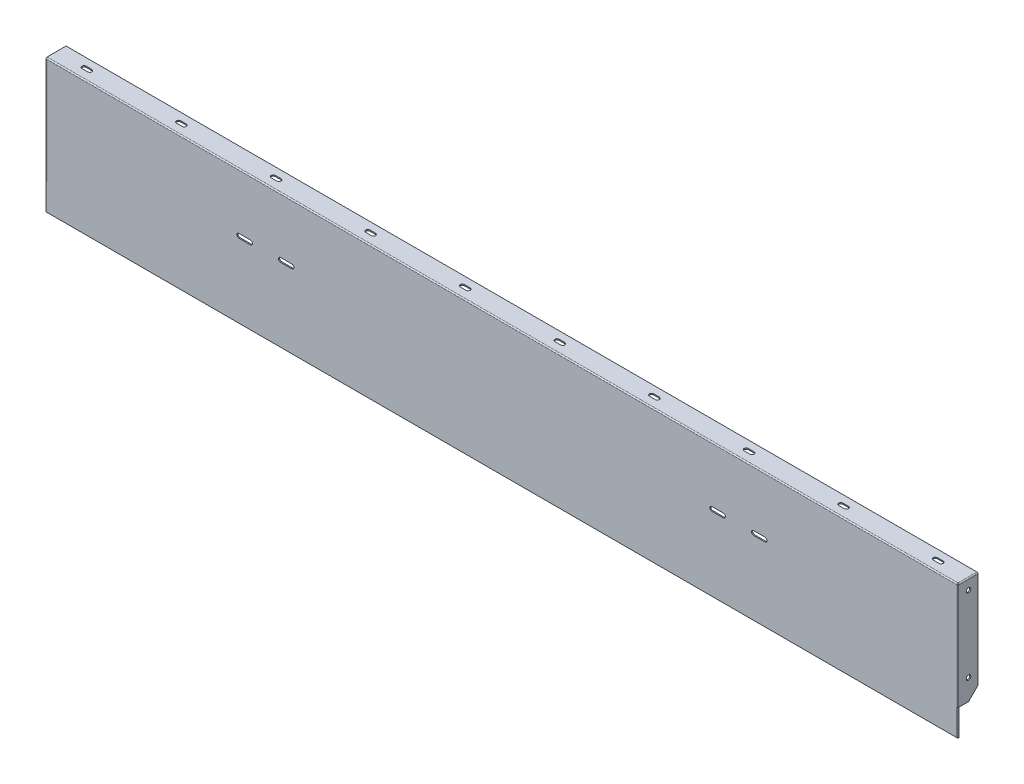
ISO-10303-21;
HEADER;
FILE_DESCRIPTION(('STEP AP214'),'2;1');
FILE_NAME('part.step','',(''),(''),'','','');
FILE_SCHEMA(('AUTOMOTIVE_DESIGN { 1 0 10303 214 1 1 1 1 }'));
ENDSEC;
DATA;
#1=APPLICATION_CONTEXT('core data for automotive mechanical design processes');
#2=APPLICATION_PROTOCOL_DEFINITION('international standard','automotive_design',2000,#1);
#3=PRODUCT_CONTEXT('',#1,'mechanical');
#4=PRODUCT('Part','Part','',(#3));
#5=PRODUCT_RELATED_PRODUCT_CATEGORY('part','',(#4));
#6=PRODUCT_DEFINITION_FORMATION('','',#4);
#7=PRODUCT_DEFINITION_CONTEXT('part definition',#1,'design');
#8=PRODUCT_DEFINITION('design','',#6,#7);
#9=PRODUCT_DEFINITION_SHAPE('','',#8);
#10=(LENGTH_UNIT() NAMED_UNIT(*) SI_UNIT(.MILLI.,.METRE.));
#11=(NAMED_UNIT(*) PLANE_ANGLE_UNIT() SI_UNIT($,.RADIAN.));
#12=(NAMED_UNIT(*) SI_UNIT($,.STERADIAN.) SOLID_ANGLE_UNIT());
#13=UNCERTAINTY_MEASURE_WITH_UNIT(LENGTH_MEASURE(1.E-05),#10,'distance_accuracy_value','');
#14=(GEOMETRIC_REPRESENTATION_CONTEXT(3) GLOBAL_UNCERTAINTY_ASSIGNED_CONTEXT((#13)) GLOBAL_UNIT_ASSIGNED_CONTEXT((#10,
#11,#12)) REPRESENTATION_CONTEXT('',''));
#15=CARTESIAN_POINT('',(0.,0.,0.));
#16=DIRECTION('',(0.,0.,1.));
#17=DIRECTION('',(1.,0.,0.));
#18=AXIS2_PLACEMENT_3D('',#15,#16,#17);
#19=CARTESIAN_POINT('',(1202.,-153.5,-25.));
#20=DIRECTION('',(0.,-0.707106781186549,-0.707106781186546));
#21=DIRECTION('',(0.,0.707106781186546,-0.707106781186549));
#22=AXIS2_PLACEMENT_3D('',#19,#20,#21);
#23=PLANE('',#22);
#24=DIRECTION('',(0.,0.707106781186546,-0.707106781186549));
#25=VECTOR('',#24,1.);
#26=CARTESIAN_POINT('',(1205.,-153.5,-25.));
#27=LINE('',#26,#25);
#28=CARTESIAN_POINT('',(1205.,-153.5,-25.));
#29=VERTEX_POINT('',#28);
#30=CARTESIAN_POINT('',(1205.,-128.5,-50.));
#31=VERTEX_POINT('',#30);
#32=EDGE_CURVE('E91',#29,#31,#27,.T.);
#33=ORIENTED_EDGE('',*,*,#32,.F.);
#34=DIRECTION('',(1.,0.,0.));
#35=VECTOR('',#34,1.);
#36=CARTESIAN_POINT('',(1202.,-153.5,-25.));
#37=LINE('',#36,#35);
#38=CARTESIAN_POINT('',(1202.,-153.5,-25.));
#39=VERTEX_POINT('',#38);
#40=EDGE_CURVE('E12',#39,#29,#37,.T.);
#41=ORIENTED_EDGE('',*,*,#40,.F.);
#42=DIRECTION('',(0.,0.707106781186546,-0.707106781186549));
#43=VECTOR('',#42,1.);
#44=CARTESIAN_POINT('',(1202.,-153.5,-25.));
#45=LINE('',#44,#43);
#46=CARTESIAN_POINT('',(1202.,-128.5,-50.));
#47=VERTEX_POINT('',#46);
#48=EDGE_CURVE('E93',#39,#47,#45,.T.);
#49=ORIENTED_EDGE('',*,*,#48,.T.);
#50=DIRECTION('',(1.,0.,0.));
#51=VECTOR('',#50,1.);
#52=CARTESIAN_POINT('',(1202.,-128.5,-50.));
#53=LINE('',#52,#51);
#54=EDGE_CURVE('E48',#47,#31,#53,.T.);
#55=ORIENTED_EDGE('',*,*,#54,.T.);
#56=EDGE_LOOP('',(#33,#41,#49,#55));
#57=FACE_BOUND('',#56,.T.);
#58=ADVANCED_FACE('F45',(#57),#23,.T.);
#59=CARTESIAN_POINT('',(1202.,-153.5,3.));
#60=DIRECTION('',(0.,-1.,0.));
#61=DIRECTION('',(0.,0.,-1.));
#62=AXIS2_PLACEMENT_3D('',#59,#60,#61);
#63=PLANE('',#62);
#64=DIRECTION('',(0.,0.,-1.));
#65=VECTOR('',#64,1.);
#66=CARTESIAN_POINT('',(1205.,-153.5,3.));
#67=LINE('',#66,#65);
#68=CARTESIAN_POINT('',(1205.,-153.5,3.));
#69=VERTEX_POINT('',#68);
#70=EDGE_CURVE('E109',#69,#29,#67,.T.);
#71=ORIENTED_EDGE('',*,*,#70,.F.);
#72=DIRECTION('',(1.,0.,0.));
#73=VECTOR('',#72,1.);
#74=CARTESIAN_POINT('',(1202.,-153.5,3.));
#75=LINE('',#74,#73);
#76=CARTESIAN_POINT('',(1202.,-153.5,3.));
#77=VERTEX_POINT('',#76);
#78=EDGE_CURVE('E53',#77,#69,#75,.T.);
#79=ORIENTED_EDGE('',*,*,#78,.F.);
#80=DIRECTION('',(0.,0.,-1.));
#81=VECTOR('',#80,1.);
#82=CARTESIAN_POINT('',(1202.,-153.5,3.));
#83=LINE('',#82,#81);
#84=EDGE_CURVE('E98',#77,#39,#83,.T.);
#85=ORIENTED_EDGE('',*,*,#84,.T.);
#86=ORIENTED_EDGE('',*,*,#40,.T.);
#87=EDGE_LOOP('',(#71,#79,#85,#86));
#88=FACE_BOUND('',#87,.T.);
#89=ADVANCED_FACE('F139',(#88),#63,.T.);
#90=CARTESIAN_POINT('',(1202.,126.5,3.));
#91=DIRECTION('',(0.,0.,1.));
#92=DIRECTION('',(0.,-1.,0.));
#93=AXIS2_PLACEMENT_3D('',#90,#91,#92);
#94=PLANE('',#93);
#95=DIRECTION('',(0.,-1.,0.));
#96=VECTOR('',#95,1.);
#97=CARTESIAN_POINT('',(1205.,126.5,3.));
#98=LINE('',#97,#96);
#99=CARTESIAN_POINT('',(1205.,126.5,3.));
#100=VERTEX_POINT('',#99);
#101=EDGE_CURVE('E118',#100,#69,#98,.T.);
#102=ORIENTED_EDGE('',*,*,#101,.F.);
#103=DIRECTION('',(1.,0.,0.));
#104=VECTOR('',#103,1.);
#105=CARTESIAN_POINT('',(1202.,126.5,3.));
#106=LINE('',#105,#104);
#107=CARTESIAN_POINT('',(1202.,126.5,3.));
#108=VERTEX_POINT('',#107);
#109=EDGE_CURVE('E131',#108,#100,#106,.T.);
#110=ORIENTED_EDGE('',*,*,#109,.F.);
#111=DIRECTION('',(0.,-1.,0.));
#112=VECTOR('',#111,1.);
#113=CARTESIAN_POINT('',(1202.,126.5,3.));
#114=LINE('',#113,#112);
#115=EDGE_CURVE('E127',#108,#77,#114,.T.);
#116=ORIENTED_EDGE('',*,*,#115,.T.);
#117=ORIENTED_EDGE('',*,*,#78,.T.);
#118=EDGE_LOOP('',(#102,#110,#116,#117));
#119=FACE_BOUND('',#118,.T.);
#120=ADVANCED_FACE('F138',(#119),#94,.T.);
#121=CARTESIAN_POINT('',(1202.,126.5,-50.));
#122=DIRECTION('',(0.,1.,0.));
#123=DIRECTION('',(0.,0.,1.));
#124=AXIS2_PLACEMENT_3D('',#121,#122,#123);
#125=PLANE('',#124);
#126=DIRECTION('',(0.,0.,1.));
#127=VECTOR('',#126,1.);
#128=CARTESIAN_POINT('',(1205.,126.5,-50.));
#129=LINE('',#128,#127);
#130=CARTESIAN_POINT('',(1205.,126.5,-50.));
#131=VERTEX_POINT('',#130);
#132=EDGE_CURVE('E105',#131,#100,#129,.T.);
#133=ORIENTED_EDGE('',*,*,#132,.F.);
#134=DIRECTION('',(1.,0.,0.));
#135=VECTOR('',#134,1.);
#136=CARTESIAN_POINT('',(1202.,126.5,-50.));
#137=LINE('',#136,#135);
#138=CARTESIAN_POINT('',(1202.,126.5,-50.));
#139=VERTEX_POINT('',#138);
#140=EDGE_CURVE('E97',#139,#131,#137,.T.);
#141=ORIENTED_EDGE('',*,*,#140,.F.);
#142=DIRECTION('',(0.,0.,1.));
#143=VECTOR('',#142,1.);
#144=CARTESIAN_POINT('',(1202.,126.5,-50.));
#145=LINE('',#144,#143);
#146=EDGE_CURVE('E124',#139,#108,#145,.T.);
#147=ORIENTED_EDGE('',*,*,#146,.T.);
#148=ORIENTED_EDGE('',*,*,#109,.T.);
#149=EDGE_LOOP('',(#133,#141,#147,#148));
#150=FACE_BOUND('',#149,.T.);
#151=ADVANCED_FACE('F134',(#150),#125,.T.);
#152=CARTESIAN_POINT('',(1202.,-128.5,-50.));
#153=DIRECTION('',(0.,0.,-1.));
#154=DIRECTION('',(0.,1.,0.));
#155=AXIS2_PLACEMENT_3D('',#152,#153,#154);
#156=PLANE('',#155);
#157=DIRECTION('',(0.,1.,0.));
#158=VECTOR('',#157,1.);
#159=CARTESIAN_POINT('',(1205.,-128.5,-50.));
#160=LINE('',#159,#158);
#161=EDGE_CURVE('E100',#31,#131,#160,.T.);
#162=ORIENTED_EDGE('',*,*,#161,.F.);
#163=ORIENTED_EDGE('',*,*,#54,.F.);
#164=DIRECTION('',(0.,1.,0.));
#165=VECTOR('',#164,1.);
#166=CARTESIAN_POINT('',(1202.,-128.5,-50.));
#167=LINE('',#166,#165);
#168=EDGE_CURVE('E122',#47,#139,#167,.T.);
#169=ORIENTED_EDGE('',*,*,#168,.T.);
#170=ORIENTED_EDGE('',*,*,#140,.T.);
#171=EDGE_LOOP('',(#162,#163,#169,#170));
#172=FACE_BOUND('',#171,.T.);
#173=ADVANCED_FACE('F101',(#172),#156,.T.);
#174=CARTESIAN_POINT('',(1202.,-181.5,3.));
#175=DIRECTION('',(-1.,0.,0.));
#176=DIRECTION('',(0.,0.,1.));
#177=AXIS2_PLACEMENT_3D('',#174,#175,#176);
#178=PLANE('',#177);
#179=CARTESIAN_POINT('',(1202.,-98.5,-25.));
#180=DIRECTION('',(1.,0.,0.));
#181=DIRECTION('',(0.,0.,-1.));
#182=AXIS2_PLACEMENT_3D('',#179,#180,#181);
#183=CIRCLE('',#182,6.);
#184=CARTESIAN_POINT('',(1202.,-98.5,-31.));
#185=VERTEX_POINT('',#184);
#186=EDGE_CURVE('E209',#185,#185,#183,.T.);
#187=ORIENTED_EDGE('',*,*,#186,.T.);
#188=EDGE_LOOP('',(#187));
#189=FACE_BOUND('',#188,.T.);
#190=CARTESIAN_POINT('',(1202.,101.5,-25.));
#191=DIRECTION('',(1.,0.,0.));
#192=DIRECTION('',(0.,0.,-1.));
#193=AXIS2_PLACEMENT_3D('',#190,#191,#192);
#194=CIRCLE('',#193,6.00000000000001);
#195=CARTESIAN_POINT('',(1202.,101.5,-31.));
#196=VERTEX_POINT('',#195);
#197=EDGE_CURVE('E110',#196,#196,#194,.T.);
#198=ORIENTED_EDGE('',*,*,#197,.T.);
#199=EDGE_LOOP('',(#198));
#200=FACE_BOUND('',#199,.T.);
#201=ORIENTED_EDGE('',*,*,#48,.F.);
#202=ORIENTED_EDGE('',*,*,#84,.F.);
#203=ORIENTED_EDGE('',*,*,#115,.F.);
#204=ORIENTED_EDGE('',*,*,#146,.F.);
#205=ORIENTED_EDGE('',*,*,#168,.F.);
#206=EDGE_LOOP('',(#201,#202,#203,#204,#205));
#207=FACE_BOUND('',#206,.T.);
#208=ADVANCED_FACE('F142',(#189,#200,#207),#178,.T.);
#209=CARTESIAN_POINT('',(1205.,-181.5,3.));
#210=DIRECTION('',(-1.,0.,0.));
#211=DIRECTION('',(0.,0.,1.));
#212=AXIS2_PLACEMENT_3D('',#209,#210,#211);
#213=PLANE('',#212);
#214=CARTESIAN_POINT('',(1205.,-98.5,-25.));
#215=DIRECTION('',(1.,0.,0.));
#216=DIRECTION('',(0.,0.,-1.));
#217=AXIS2_PLACEMENT_3D('',#214,#215,#216);
#218=CIRCLE('',#217,6.);
#219=CARTESIAN_POINT('',(1205.,-98.5,-31.));
#220=VERTEX_POINT('',#219);
#221=EDGE_CURVE('E212',#220,#220,#218,.T.);
#222=ORIENTED_EDGE('',*,*,#221,.F.);
#223=EDGE_LOOP('',(#222));
#224=FACE_BOUND('',#223,.T.);
#225=CARTESIAN_POINT('',(1205.,101.5,-25.));
#226=DIRECTION('',(1.,0.,0.));
#227=DIRECTION('',(0.,0.,-1.));
#228=AXIS2_PLACEMENT_3D('',#225,#226,#227);
#229=CIRCLE('',#228,6.00000000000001);
#230=CARTESIAN_POINT('',(1205.,101.5,-31.));
#231=VERTEX_POINT('',#230);
#232=EDGE_CURVE('E113',#231,#231,#229,.T.);
#233=ORIENTED_EDGE('',*,*,#232,.F.);
#234=EDGE_LOOP('',(#233));
#235=FACE_BOUND('',#234,.T.);
#236=ORIENTED_EDGE('',*,*,#32,.T.);
#237=ORIENTED_EDGE('',*,*,#161,.T.);
#238=ORIENTED_EDGE('',*,*,#132,.T.);
#239=ORIENTED_EDGE('',*,*,#101,.T.);
#240=ORIENTED_EDGE('',*,*,#70,.T.);
#241=EDGE_LOOP('',(#236,#237,#238,#239,#240));
#242=FACE_BOUND('',#241,.T.);
#243=ADVANCED_FACE('F107',(#224,#235,#242),#213,.F.);
#244=CARTESIAN_POINT('',(1202.,101.5,-25.));
#245=DIRECTION('',(1.,0.,0.));
#246=DIRECTION('',(0.,0.,-1.));
#247=AXIS2_PLACEMENT_3D('',#244,#245,#246);
#248=CYLINDRICAL_SURFACE('',#247,6.00000000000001);
#249=ORIENTED_EDGE('',*,*,#197,.F.);
#250=EDGE_LOOP('',(#249));
#251=FACE_BOUND('',#250,.T.);
#252=ORIENTED_EDGE('',*,*,#232,.T.);
#253=EDGE_LOOP('',(#252));
#254=FACE_BOUND('',#253,.T.);
#255=ADVANCED_FACE('F150',(#251,#254),#248,.F.);
#256=CARTESIAN_POINT('',(1202.,-98.5,-25.));
#257=DIRECTION('',(1.,0.,0.));
#258=DIRECTION('',(0.,0.,-1.));
#259=AXIS2_PLACEMENT_3D('',#256,#257,#258);
#260=CYLINDRICAL_SURFACE('',#259,6.);
#261=ORIENTED_EDGE('',*,*,#186,.F.);
#262=EDGE_LOOP('',(#261));
#263=FACE_BOUND('',#262,.T.);
#264=ORIENTED_EDGE('',*,*,#221,.T.);
#265=EDGE_LOOP('',(#264));
#266=FACE_BOUND('',#265,.T.);
#267=ADVANCED_FACE('F193',(#263,#266),#260,.F.);
#268=CLOSED_SHELL('',(#58,#89,#120,#151,#173,#208,#243,#255,#267));
#269=MANIFOLD_SOLID_BREP('B2',#268);
#270=CARTESIAN_POINT('',(-1202.,126.5,-50.));
#271=DIRECTION('',(0.,0.,-1.));
#272=DIRECTION('',(0.,1.,0.));
#273=AXIS2_PLACEMENT_3D('',#270,#271,#272);
#274=PLANE('',#273);
#275=DIRECTION('',(0.,-1.,0.));
#276=VECTOR('',#275,1.);
#277=CARTESIAN_POINT('',(-1205.,126.5,-50.));
#278=LINE('',#277,#276);
#279=CARTESIAN_POINT('',(-1205.,126.5,-50.));
#280=VERTEX_POINT('',#279);
#281=CARTESIAN_POINT('',(-1205.,-128.5,-50.));
#282=VERTEX_POINT('',#281);
#283=EDGE_CURVE('E291',#280,#282,#278,.T.);
#284=ORIENTED_EDGE('',*,*,#283,.F.);
#285=DIRECTION('',(-1.,0.,0.));
#286=VECTOR('',#285,1.);
#287=CARTESIAN_POINT('',(-1202.,126.5,-50.));
#288=LINE('',#287,#286);
#289=CARTESIAN_POINT('',(-1202.,126.5,-50.));
#290=VERTEX_POINT('',#289);
#291=EDGE_CURVE('E43',#290,#280,#288,.T.);
#292=ORIENTED_EDGE('',*,*,#291,.F.);
#293=DIRECTION('',(0.,-1.,0.));
#294=VECTOR('',#293,1.);
#295=CARTESIAN_POINT('',(-1202.,126.5,-50.));
#296=LINE('',#295,#294);
#297=CARTESIAN_POINT('',(-1202.,-128.5,-50.));
#298=VERTEX_POINT('',#297);
#299=EDGE_CURVE('E293',#290,#298,#296,.T.);
#300=ORIENTED_EDGE('',*,*,#299,.T.);
#301=DIRECTION('',(-1.,0.,0.));
#302=VECTOR('',#301,1.);
#303=CARTESIAN_POINT('',(-1202.,-128.5,-50.));
#304=LINE('',#303,#302);
#305=EDGE_CURVE('E248',#298,#282,#304,.T.);
#306=ORIENTED_EDGE('',*,*,#305,.T.);
#307=EDGE_LOOP('',(#284,#292,#300,#306));
#308=FACE_BOUND('',#307,.T.);
#309=ADVANCED_FACE('F245',(#308),#274,.T.);
#310=CARTESIAN_POINT('',(-1202.,126.5,-50.));
#311=DIRECTION('',(0.,1.,0.));
#312=DIRECTION('',(0.,0.,1.));
#313=AXIS2_PLACEMENT_3D('',#310,#311,#312);
#314=PLANE('',#313);
#315=DIRECTION('',(0.,0.,-1.));
#316=VECTOR('',#315,1.);
#317=CARTESIAN_POINT('',(-1205.,126.5,-50.));
#318=LINE('',#317,#316);
#319=CARTESIAN_POINT('',(-1205.,126.5,3.));
#320=VERTEX_POINT('',#319);
#321=EDGE_CURVE('E309',#320,#280,#318,.T.);
#322=ORIENTED_EDGE('',*,*,#321,.F.);
#323=DIRECTION('',(-1.,0.,0.));
#324=VECTOR('',#323,1.);
#325=CARTESIAN_POINT('',(-1202.,126.5,3.));
#326=LINE('',#325,#324);
#327=CARTESIAN_POINT('',(-1202.,126.5,3.));
#328=VERTEX_POINT('',#327);
#329=EDGE_CURVE('E253',#328,#320,#326,.T.);
#330=ORIENTED_EDGE('',*,*,#329,.F.);
#331=DIRECTION('',(0.,0.,-1.));
#332=VECTOR('',#331,1.);
#333=CARTESIAN_POINT('',(-1202.,126.5,-50.));
#334=LINE('',#333,#332);
#335=EDGE_CURVE('E298',#328,#290,#334,.T.);
#336=ORIENTED_EDGE('',*,*,#335,.T.);
#337=ORIENTED_EDGE('',*,*,#291,.T.);
#338=EDGE_LOOP('',(#322,#330,#336,#337));
#339=FACE_BOUND('',#338,.T.);
#340=ADVANCED_FACE('F339',(#339),#314,.T.);
#341=CARTESIAN_POINT('',(-1202.,126.5,3.));
#342=DIRECTION('',(0.,0.,1.));
#343=DIRECTION('',(0.,-1.,0.));
#344=AXIS2_PLACEMENT_3D('',#341,#342,#343);
#345=PLANE('',#344);
#346=DIRECTION('',(0.,1.,0.));
#347=VECTOR('',#346,1.);
#348=CARTESIAN_POINT('',(-1205.,126.5,3.));
#349=LINE('',#348,#347);
#350=CARTESIAN_POINT('',(-1205.,-153.5,3.));
#351=VERTEX_POINT('',#350);
#352=EDGE_CURVE('E318',#351,#320,#349,.T.);
#353=ORIENTED_EDGE('',*,*,#352,.F.);
#354=DIRECTION('',(-1.,0.,0.));
#355=VECTOR('',#354,1.);
#356=CARTESIAN_POINT('',(-1202.,-153.5,3.));
#357=LINE('',#356,#355);
#358=CARTESIAN_POINT('',(-1202.,-153.5,3.));
#359=VERTEX_POINT('',#358);
#360=EDGE_CURVE('E331',#359,#351,#357,.T.);
#361=ORIENTED_EDGE('',*,*,#360,.F.);
#362=DIRECTION('',(0.,1.,0.));
#363=VECTOR('',#362,1.);
#364=CARTESIAN_POINT('',(-1202.,126.5,3.));
#365=LINE('',#364,#363);
#366=EDGE_CURVE('E327',#359,#328,#365,.T.);
#367=ORIENTED_EDGE('',*,*,#366,.T.);
#368=ORIENTED_EDGE('',*,*,#329,.T.);
#369=EDGE_LOOP('',(#353,#361,#367,#368));
#370=FACE_BOUND('',#369,.T.);
#371=ADVANCED_FACE('F338',(#370),#345,.T.);
#372=CARTESIAN_POINT('',(-1202.,-153.5,3.));
#373=DIRECTION('',(0.,-1.,0.));
#374=DIRECTION('',(0.,0.,-1.));
#375=AXIS2_PLACEMENT_3D('',#372,#373,#374);
#376=PLANE('',#375);
#377=DIRECTION('',(0.,0.,1.));
#378=VECTOR('',#377,1.);
#379=CARTESIAN_POINT('',(-1205.,-153.5,3.));
#380=LINE('',#379,#378);
#381=CARTESIAN_POINT('',(-1205.,-153.5,-25.));
#382=VERTEX_POINT('',#381);
#383=EDGE_CURVE('E305',#382,#351,#380,.T.);
#384=ORIENTED_EDGE('',*,*,#383,.F.);
#385=DIRECTION('',(-1.,0.,0.));
#386=VECTOR('',#385,1.);
#387=CARTESIAN_POINT('',(-1202.,-153.5,-25.));
#388=LINE('',#387,#386);
#389=CARTESIAN_POINT('',(-1202.,-153.5,-25.));
#390=VERTEX_POINT('',#389);
#391=EDGE_CURVE('E297',#390,#382,#388,.T.);
#392=ORIENTED_EDGE('',*,*,#391,.F.);
#393=DIRECTION('',(0.,0.,1.));
#394=VECTOR('',#393,1.);
#395=CARTESIAN_POINT('',(-1202.,-153.5,3.));
#396=LINE('',#395,#394);
#397=EDGE_CURVE('E324',#390,#359,#396,.T.);
#398=ORIENTED_EDGE('',*,*,#397,.T.);
#399=ORIENTED_EDGE('',*,*,#360,.T.);
#400=EDGE_LOOP('',(#384,#392,#398,#399));
#401=FACE_BOUND('',#400,.T.);
#402=ADVANCED_FACE('F334',(#401),#376,.T.);
#403=CARTESIAN_POINT('',(-1202.,-153.5,-25.));
#404=DIRECTION('',(0.,-0.707106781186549,-0.707106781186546));
#405=DIRECTION('',(0.,0.707106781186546,-0.707106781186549));
#406=AXIS2_PLACEMENT_3D('',#403,#404,#405);
#407=PLANE('',#406);
#408=DIRECTION('',(0.,-0.707106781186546,0.707106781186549));
#409=VECTOR('',#408,1.);
#410=CARTESIAN_POINT('',(-1205.,-153.5,-25.));
#411=LINE('',#410,#409);
#412=EDGE_CURVE('E300',#282,#382,#411,.T.);
#413=ORIENTED_EDGE('',*,*,#412,.F.);
#414=ORIENTED_EDGE('',*,*,#305,.F.);
#415=DIRECTION('',(0.,-0.707106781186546,0.707106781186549));
#416=VECTOR('',#415,1.);
#417=CARTESIAN_POINT('',(-1202.,-153.5,-25.));
#418=LINE('',#417,#416);
#419=EDGE_CURVE('E322',#298,#390,#418,.T.);
#420=ORIENTED_EDGE('',*,*,#419,.T.);
#421=ORIENTED_EDGE('',*,*,#391,.T.);
#422=EDGE_LOOP('',(#413,#414,#420,#421));
#423=FACE_BOUND('',#422,.T.);
#424=ADVANCED_FACE('F301',(#423),#407,.T.);
#425=CARTESIAN_POINT('',(-1202.,-153.5,-50.));
#426=DIRECTION('',(1.,0.,0.));
#427=DIRECTION('',(0.,0.,-1.));
#428=AXIS2_PLACEMENT_3D('',#425,#426,#427);
#429=PLANE('',#428);
#430=CARTESIAN_POINT('',(-1202.,-98.5,-25.));
#431=DIRECTION('',(-1.,0.,0.));
#432=DIRECTION('',(0.,0.,1.));
#433=AXIS2_PLACEMENT_3D('',#430,#431,#432);
#434=CIRCLE('',#433,6.);
#435=CARTESIAN_POINT('',(-1202.,-98.5,-19.));
#436=VERTEX_POINT('',#435);
#437=EDGE_CURVE('E409',#436,#436,#434,.T.);
#438=ORIENTED_EDGE('',*,*,#437,.T.);
#439=EDGE_LOOP('',(#438));
#440=FACE_BOUND('',#439,.T.);
#441=CARTESIAN_POINT('',(-1202.,101.5,-25.));
#442=DIRECTION('',(-1.,0.,0.));
#443=DIRECTION('',(0.,0.,1.));
#444=AXIS2_PLACEMENT_3D('',#441,#442,#443);
#445=CIRCLE('',#444,6.00000000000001);
#446=CARTESIAN_POINT('',(-1202.,101.5,-19.));
#447=VERTEX_POINT('',#446);
#448=EDGE_CURVE('E310',#447,#447,#445,.T.);
#449=ORIENTED_EDGE('',*,*,#448,.T.);
#450=EDGE_LOOP('',(#449));
#451=FACE_BOUND('',#450,.T.);
#452=ORIENTED_EDGE('',*,*,#299,.F.);
#453=ORIENTED_EDGE('',*,*,#335,.F.);
#454=ORIENTED_EDGE('',*,*,#366,.F.);
#455=ORIENTED_EDGE('',*,*,#397,.F.);
#456=ORIENTED_EDGE('',*,*,#419,.F.);
#457=EDGE_LOOP('',(#452,#453,#454,#455,#456));
#458=FACE_BOUND('',#457,.T.);
#459=ADVANCED_FACE('F342',(#440,#451,#458),#429,.T.);
#460=CARTESIAN_POINT('',(-1205.,-153.5,-50.));
#461=DIRECTION('',(1.,0.,0.));
#462=DIRECTION('',(0.,0.,-1.));
#463=AXIS2_PLACEMENT_3D('',#460,#461,#462);
#464=PLANE('',#463);
#465=CARTESIAN_POINT('',(-1205.,-98.5,-25.));
#466=DIRECTION('',(-1.,0.,0.));
#467=DIRECTION('',(0.,0.,1.));
#468=AXIS2_PLACEMENT_3D('',#465,#466,#467);
#469=CIRCLE('',#468,6.);
#470=CARTESIAN_POINT('',(-1205.,-98.5,-19.));
#471=VERTEX_POINT('',#470);
#472=EDGE_CURVE('E412',#471,#471,#469,.T.);
#473=ORIENTED_EDGE('',*,*,#472,.F.);
#474=EDGE_LOOP('',(#473));
#475=FACE_BOUND('',#474,.T.);
#476=CARTESIAN_POINT('',(-1205.,101.5,-25.));
#477=DIRECTION('',(-1.,0.,0.));
#478=DIRECTION('',(0.,0.,1.));
#479=AXIS2_PLACEMENT_3D('',#476,#477,#478);
#480=CIRCLE('',#479,6.00000000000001);
#481=CARTESIAN_POINT('',(-1205.,101.5,-19.));
#482=VERTEX_POINT('',#481);
#483=EDGE_CURVE('E313',#482,#482,#480,.T.);
#484=ORIENTED_EDGE('',*,*,#483,.F.);
#485=EDGE_LOOP('',(#484));
#486=FACE_BOUND('',#485,.T.);
#487=ORIENTED_EDGE('',*,*,#283,.T.);
#488=ORIENTED_EDGE('',*,*,#412,.T.);
#489=ORIENTED_EDGE('',*,*,#383,.T.);
#490=ORIENTED_EDGE('',*,*,#352,.T.);
#491=ORIENTED_EDGE('',*,*,#321,.T.);
#492=EDGE_LOOP('',(#487,#488,#489,#490,#491));
#493=FACE_BOUND('',#492,.T.);
#494=ADVANCED_FACE('F307',(#475,#486,#493),#464,.F.);
#495=CARTESIAN_POINT('',(-1202.,101.5,-25.));
#496=DIRECTION('',(-1.,0.,0.));
#497=DIRECTION('',(0.,0.,1.));
#498=AXIS2_PLACEMENT_3D('',#495,#496,#497);
#499=CYLINDRICAL_SURFACE('',#498,6.00000000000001);
#500=ORIENTED_EDGE('',*,*,#448,.F.);
#501=EDGE_LOOP('',(#500));
#502=FACE_BOUND('',#501,.T.);
#503=ORIENTED_EDGE('',*,*,#483,.T.);
#504=EDGE_LOOP('',(#503));
#505=FACE_BOUND('',#504,.T.);
#506=ADVANCED_FACE('F350',(#502,#505),#499,.F.);
#507=CARTESIAN_POINT('',(-1202.,-98.5,-25.));
#508=DIRECTION('',(-1.,0.,0.));
#509=DIRECTION('',(0.,0.,1.));
#510=AXIS2_PLACEMENT_3D('',#507,#508,#509);
#511=CYLINDRICAL_SURFACE('',#510,6.);
#512=ORIENTED_EDGE('',*,*,#437,.F.);
#513=EDGE_LOOP('',(#512));
#514=FACE_BOUND('',#513,.T.);
#515=ORIENTED_EDGE('',*,*,#472,.T.);
#516=EDGE_LOOP('',(#515));
#517=FACE_BOUND('',#516,.T.);
#518=ADVANCED_FACE('F393',(#514,#517),#511,.F.);
#519=CLOSED_SHELL('',(#309,#340,#371,#402,#424,#459,#494,#506,#518));
#520=MANIFOLD_SOLID_BREP('B6',#519);
#521=CARTESIAN_POINT('',(-1205.,126.5,0.));
#522=DIRECTION('',(0.,0.,1.));
#523=DIRECTION('',(1.,0.,0.));
#524=AXIS2_PLACEMENT_3D('',#521,#522,#523);
#525=PLANE('',#524);
#526=CARTESIAN_POINT('',(-925.,-153.5,0.));
#527=DIRECTION('',(0.,0.,1.));
#528=DIRECTION('',(1.,0.,0.));
#529=AXIS2_PLACEMENT_3D('',#526,#527,#528);
#530=CIRCLE('',#529,3.99999999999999);
#531=CARTESIAN_POINT('',(-921.,-153.5,0.));
#532=VERTEX_POINT('',#531);
#533=EDGE_CURVE('E1403',#532,#532,#530,.F.);
#534=ORIENTED_EDGE('',*,*,#533,.F.);
#535=EDGE_LOOP('',(#534));
#536=FACE_BOUND('',#535,.T.);
#537=CARTESIAN_POINT('',(-425.,-153.5,0.));
#538=DIRECTION('',(0.,0.,1.));
#539=DIRECTION('',(1.,0.,0.));
#540=AXIS2_PLACEMENT_3D('',#537,#538,#539);
#541=CIRCLE('',#540,3.99999999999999);
#542=CARTESIAN_POINT('',(-421.,-153.5,0.));
#543=VERTEX_POINT('',#542);
#544=EDGE_CURVE('E1361',#543,#543,#541,.F.);
#545=ORIENTED_EDGE('',*,*,#544,.F.);
#546=EDGE_LOOP('',(#545));
#547=FACE_BOUND('',#546,.T.);
#548=CARTESIAN_POINT('',(-125.,-153.5,0.));
#549=DIRECTION('',(0.,0.,1.));
#550=DIRECTION('',(1.,0.,0.));
#551=AXIS2_PLACEMENT_3D('',#548,#549,#550);
#552=CIRCLE('',#551,3.99999999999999);
#553=CARTESIAN_POINT('',(-121.,-153.5,0.));
#554=VERTEX_POINT('',#553);
#555=EDGE_CURVE('E1355',#554,#554,#552,.F.);
#556=ORIENTED_EDGE('',*,*,#555,.F.);
#557=EDGE_LOOP('',(#556));
#558=FACE_BOUND('',#557,.T.);
#559=CARTESIAN_POINT('',(375.,-153.5,0.));
#560=DIRECTION('',(0.,0.,1.));
#561=DIRECTION('',(1.,0.,0.));
#562=AXIS2_PLACEMENT_3D('',#559,#560,#561);
#563=CIRCLE('',#562,3.99999999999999);
#564=CARTESIAN_POINT('',(379.,-153.5,0.));
#565=VERTEX_POINT('',#564);
#566=EDGE_CURVE('E1349',#565,#565,#563,.F.);
#567=ORIENTED_EDGE('',*,*,#566,.F.);
#568=EDGE_LOOP('',(#567));
#569=FACE_BOUND('',#568,.T.);
#570=CARTESIAN_POINT('',(1175.,-153.5,0.));
#571=DIRECTION('',(0.,0.,1.));
#572=DIRECTION('',(1.,0.,0.));
#573=AXIS2_PLACEMENT_3D('',#570,#571,#572);
#574=CIRCLE('',#573,3.99999999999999);
#575=CARTESIAN_POINT('',(1179.,-153.5,0.));
#576=VERTEX_POINT('',#575);
#577=EDGE_CURVE('E1331',#576,#576,#574,.F.);
#578=ORIENTED_EDGE('',*,*,#577,.F.);
#579=EDGE_LOOP('',(#578));
#580=FACE_BOUND('',#579,.T.);
#581=CARTESIAN_POINT('',(555.,-23.5,0.));
#582=DIRECTION('',(0.,0.,1.));
#583=DIRECTION('',(1.,0.,0.));
#584=AXIS2_PLACEMENT_3D('',#581,#582,#583);
#585=CIRCLE('',#584,5.5);
#586=CARTESIAN_POINT('',(555.,-18.,0.));
#587=VERTEX_POINT('',#586);
#588=CARTESIAN_POINT('',(555.,-29.,0.));
#589=VERTEX_POINT('',#588);
#590=EDGE_CURVE('E961',#587,#589,#585,.T.);
#591=ORIENTED_EDGE('',*,*,#590,.T.);
#592=DIRECTION('',(1.,0.,0.));
#593=VECTOR('',#592,1.);
#594=CARTESIAN_POINT('',(555.,-29.,0.));
#595=LINE('',#594,#593);
#596=CARTESIAN_POINT('',(585.,-29.,0.));
#597=VERTEX_POINT('',#596);
#598=EDGE_CURVE('E964',#589,#597,#595,.T.);
#599=ORIENTED_EDGE('',*,*,#598,.T.);
#600=CARTESIAN_POINT('',(585.,-23.5,0.));
#601=DIRECTION('',(0.,0.,1.));
#602=DIRECTION('',(1.,0.,0.));
#603=AXIS2_PLACEMENT_3D('',#600,#601,#602);
#604=CIRCLE('',#603,5.5);
#605=CARTESIAN_POINT('',(585.,-18.,0.));
#606=VERTEX_POINT('',#605);
#607=EDGE_CURVE('E967',#597,#606,#604,.T.);
#608=ORIENTED_EDGE('',*,*,#607,.T.);
#609=DIRECTION('',(-1.,0.,0.));
#610=VECTOR('',#609,1.);
#611=CARTESIAN_POINT('',(555.,-18.,0.));
#612=LINE('',#611,#610);
#613=EDGE_CURVE('E970',#606,#587,#612,.T.);
#614=ORIENTED_EDGE('',*,*,#613,.T.);
#615=EDGE_LOOP('',(#591,#599,#608,#614));
#616=FACE_BOUND('',#615,.T.);
#617=CARTESIAN_POINT('',(-695.,-23.5000000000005,0.));
#618=DIRECTION('',(0.,0.,1.));
#619=DIRECTION('',(1.,0.,0.));
#620=AXIS2_PLACEMENT_3D('',#617,#618,#619);
#621=CIRCLE('',#620,5.5);
#622=CARTESIAN_POINT('',(-695.,-18.0000000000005,0.));
#623=VERTEX_POINT('',#622);
#624=CARTESIAN_POINT('',(-695.,-29.0000000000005,0.));
#625=VERTEX_POINT('',#624);
#626=EDGE_CURVE('E1023',#623,#625,#621,.T.);
#627=ORIENTED_EDGE('',*,*,#626,.T.);
#628=DIRECTION('',(1.,0.,0.));
#629=VECTOR('',#628,1.);
#630=CARTESIAN_POINT('',(-695.,-29.0000000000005,0.));
#631=LINE('',#630,#629);
#632=CARTESIAN_POINT('',(-665.,-29.0000000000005,0.));
#633=VERTEX_POINT('',#632);
#634=EDGE_CURVE('E1026',#625,#633,#631,.T.);
#635=ORIENTED_EDGE('',*,*,#634,.T.);
#636=CARTESIAN_POINT('',(-665.,-23.5,0.));
#637=DIRECTION('',(0.,0.,1.));
#638=DIRECTION('',(1.,0.,0.));
#639=AXIS2_PLACEMENT_3D('',#636,#637,#638);
#640=CIRCLE('',#639,5.5);
#641=CARTESIAN_POINT('',(-665.,-18.,0.));
#642=VERTEX_POINT('',#641);
#643=EDGE_CURVE('E1029',#633,#642,#640,.T.);
#644=ORIENTED_EDGE('',*,*,#643,.T.);
#645=DIRECTION('',(-1.,0.,0.));
#646=VECTOR('',#645,1.);
#647=CARTESIAN_POINT('',(-695.,-18.0000000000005,0.));
#648=LINE('',#647,#646);
#649=EDGE_CURVE('E1032',#642,#623,#648,.T.);
#650=ORIENTED_EDGE('',*,*,#649,.T.);
#651=EDGE_LOOP('',(#627,#635,#644,#650));
#652=FACE_BOUND('',#651,.T.);
#653=DIRECTION('',(0.,-1.,0.));
#654=VECTOR('',#653,1.);
#655=CARTESIAN_POINT('',(-1205.,-191.5,0.));
#656=LINE('',#655,#654);
#657=CARTESIAN_POINT('',(-1205.,126.5,0.));
#658=VERTEX_POINT('',#657);
#659=CARTESIAN_POINT('',(-1205.,-223.5,0.));
#660=VERTEX_POINT('',#659);
#661=EDGE_CURVE('E1054',#658,#660,#656,.T.);
#662=ORIENTED_EDGE('',*,*,#661,.F.);
#663=DIRECTION('',(-1.,0.,0.));
#664=VECTOR('',#663,1.);
#665=CARTESIAN_POINT('',(-1205.,126.5,0.));
#666=LINE('',#665,#664);
#667=CARTESIAN_POINT('',(1205.,126.5,0.));
#668=VERTEX_POINT('',#667);
#669=EDGE_CURVE('E1063',#668,#658,#666,.T.);
#670=ORIENTED_EDGE('',*,*,#669,.F.);
#671=DIRECTION('',(0.,1.,0.));
#672=VECTOR('',#671,1.);
#673=CARTESIAN_POINT('',(1205.,126.5,0.));
#674=LINE('',#673,#672);
#675=CARTESIAN_POINT('',(1205.,-223.5,0.));
#676=VERTEX_POINT('',#675);
#677=EDGE_CURVE('E1057',#676,#668,#674,.T.);
#678=ORIENTED_EDGE('',*,*,#677,.F.);
#679=DIRECTION('',(1.,0.,0.));
#680=VECTOR('',#679,1.);
#681=CARTESIAN_POINT('',(1205.,-223.5,0.));
#682=LINE('',#681,#680);
#683=EDGE_CURVE('E1055',#660,#676,#682,.T.);
#684=ORIENTED_EDGE('',*,*,#683,.F.);
#685=EDGE_LOOP('',(#662,#670,#678,#684));
#686=FACE_BOUND('',#685,.T.);
#687=CARTESIAN_POINT('',(-585.,-23.5,0.));
#688=DIRECTION('',(0.,0.,1.));
#689=DIRECTION('',(1.,0.,0.));
#690=AXIS2_PLACEMENT_3D('',#687,#688,#689);
#691=CIRCLE('',#690,5.5);
#692=CARTESIAN_POINT('',(-585.,-18.,0.));
#693=VERTEX_POINT('',#692);
#694=CARTESIAN_POINT('',(-585.,-29.,0.));
#695=VERTEX_POINT('',#694);
#696=EDGE_CURVE('E992',#693,#695,#691,.T.);
#697=ORIENTED_EDGE('',*,*,#696,.T.);
#698=DIRECTION('',(1.,0.,0.));
#699=VECTOR('',#698,1.);
#700=CARTESIAN_POINT('',(-585.,-29.,0.));
#701=LINE('',#700,#699);
#702=CARTESIAN_POINT('',(-555.,-29.,0.));
#703=VERTEX_POINT('',#702);
#704=EDGE_CURVE('E995',#695,#703,#701,.T.);
#705=ORIENTED_EDGE('',*,*,#704,.T.);
#706=CARTESIAN_POINT('',(-555.,-23.5,0.));
#707=DIRECTION('',(0.,0.,1.));
#708=DIRECTION('',(1.,0.,0.));
#709=AXIS2_PLACEMENT_3D('',#706,#707,#708);
#710=CIRCLE('',#709,5.5);
#711=CARTESIAN_POINT('',(-555.,-18.,0.));
#712=VERTEX_POINT('',#711);
#713=EDGE_CURVE('E998',#703,#712,#710,.T.);
#714=ORIENTED_EDGE('',*,*,#713,.T.);
#715=DIRECTION('',(-1.,0.,0.));
#716=VECTOR('',#715,1.);
#717=CARTESIAN_POINT('',(-585.,-18.,0.));
#718=LINE('',#717,#716);
#719=EDGE_CURVE('E1001',#712,#693,#718,.T.);
#720=ORIENTED_EDGE('',*,*,#719,.T.);
#721=EDGE_LOOP('',(#697,#705,#714,#720));
#722=FACE_BOUND('',#721,.T.);
#723=CARTESIAN_POINT('',(665.,-23.5,0.));
#724=DIRECTION('',(0.,0.,1.));
#725=DIRECTION('',(1.,0.,0.));
#726=AXIS2_PLACEMENT_3D('',#723,#724,#725);
#727=CIRCLE('',#726,5.5);
#728=CARTESIAN_POINT('',(665.,-18.,0.));
#729=VERTEX_POINT('',#728);
#730=CARTESIAN_POINT('',(665.,-29.,0.));
#731=VERTEX_POINT('',#730);
#732=EDGE_CURVE('E923',#729,#731,#727,.T.);
#733=ORIENTED_EDGE('',*,*,#732,.T.);
#734=DIRECTION('',(1.,0.,0.));
#735=VECTOR('',#734,1.);
#736=CARTESIAN_POINT('',(665.,-29.,0.));
#737=LINE('',#736,#735);
#738=CARTESIAN_POINT('',(695.,-29.,0.));
#739=VERTEX_POINT('',#738);
#740=EDGE_CURVE('E932',#731,#739,#737,.T.);
#741=ORIENTED_EDGE('',*,*,#740,.T.);
#742=CARTESIAN_POINT('',(695.,-23.5,0.));
#743=DIRECTION('',(0.,0.,1.));
#744=DIRECTION('',(1.,0.,0.));
#745=AXIS2_PLACEMENT_3D('',#742,#743,#744);
#746=CIRCLE('',#745,5.5);
#747=CARTESIAN_POINT('',(695.,-18.,0.));
#748=VERTEX_POINT('',#747);
#749=EDGE_CURVE('E936',#739,#748,#746,.T.);
#750=ORIENTED_EDGE('',*,*,#749,.T.);
#751=DIRECTION('',(-1.,0.,0.));
#752=VECTOR('',#751,1.);
#753=CARTESIAN_POINT('',(665.,-18.,0.));
#754=LINE('',#753,#752);
#755=EDGE_CURVE('E938',#748,#729,#754,.T.);
#756=ORIENTED_EDGE('',*,*,#755,.T.);
#757=EDGE_LOOP('',(#733,#741,#750,#756));
#758=FACE_BOUND('',#757,.T.);
#759=CARTESIAN_POINT('',(925.,-153.5,0.));
#760=DIRECTION('',(0.,0.,1.));
#761=DIRECTION('',(1.,0.,0.));
#762=AXIS2_PLACEMENT_3D('',#759,#760,#761);
#763=CIRCLE('',#762,3.99999999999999);
#764=CARTESIAN_POINT('',(929.,-153.5,0.));
#765=VERTEX_POINT('',#764);
#766=EDGE_CURVE('E1340',#765,#765,#763,.F.);
#767=ORIENTED_EDGE('',*,*,#766,.F.);
#768=EDGE_LOOP('',(#767));
#769=FACE_BOUND('',#768,.T.);
#770=CARTESIAN_POINT('',(675.,-153.5,0.));
#771=DIRECTION('',(0.,0.,1.));
#772=DIRECTION('',(1.,0.,0.));
#773=AXIS2_PLACEMENT_3D('',#770,#771,#772);
#774=CIRCLE('',#773,3.99999999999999);
#775=CARTESIAN_POINT('',(679.,-153.5,0.));
#776=VERTEX_POINT('',#775);
#777=EDGE_CURVE('E1343',#776,#776,#774,.F.);
#778=ORIENTED_EDGE('',*,*,#777,.F.);
#779=EDGE_LOOP('',(#778));
#780=FACE_BOUND('',#779,.T.);
#781=CARTESIAN_POINT('',(425.,-153.5,0.));
#782=DIRECTION('',(0.,0.,1.));
#783=DIRECTION('',(1.,0.,0.));
#784=AXIS2_PLACEMENT_3D('',#781,#782,#783);
#785=CIRCLE('',#784,3.99999999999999);
#786=CARTESIAN_POINT('',(429.,-153.5,0.));
#787=VERTEX_POINT('',#786);
#788=EDGE_CURVE('E1346',#787,#787,#785,.F.);
#789=ORIENTED_EDGE('',*,*,#788,.F.);
#790=EDGE_LOOP('',(#789));
#791=FACE_BOUND('',#790,.T.);
#792=CARTESIAN_POINT('',(125.,-153.5,0.));
#793=DIRECTION('',(0.,0.,1.));
#794=DIRECTION('',(1.,0.,0.));
#795=AXIS2_PLACEMENT_3D('',#792,#793,#794);
#796=CIRCLE('',#795,3.99999999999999);
#797=CARTESIAN_POINT('',(129.,-153.5,0.));
#798=VERTEX_POINT('',#797);
#799=EDGE_CURVE('E1352',#798,#798,#796,.F.);
#800=ORIENTED_EDGE('',*,*,#799,.F.);
#801=EDGE_LOOP('',(#800));
#802=FACE_BOUND('',#801,.T.);
#803=CARTESIAN_POINT('',(-375.,-153.5,0.));
#804=DIRECTION('',(0.,0.,1.));
#805=DIRECTION('',(1.,0.,0.));
#806=AXIS2_PLACEMENT_3D('',#803,#804,#805);
#807=CIRCLE('',#806,3.99999999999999);
#808=CARTESIAN_POINT('',(-371.,-153.5,0.));
#809=VERTEX_POINT('',#808);
#810=EDGE_CURVE('E1358',#809,#809,#807,.F.);
#811=ORIENTED_EDGE('',*,*,#810,.F.);
#812=EDGE_LOOP('',(#811));
#813=FACE_BOUND('',#812,.T.);
#814=CARTESIAN_POINT('',(-675.,-153.5,0.));
#815=DIRECTION('',(0.,0.,1.));
#816=DIRECTION('',(1.,0.,0.));
#817=AXIS2_PLACEMENT_3D('',#814,#815,#816);
#818=CIRCLE('',#817,3.99999999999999);
#819=CARTESIAN_POINT('',(-671.,-153.5,0.));
#820=VERTEX_POINT('',#819);
#821=EDGE_CURVE('E1382',#820,#820,#818,.F.);
#822=ORIENTED_EDGE('',*,*,#821,.F.);
#823=EDGE_LOOP('',(#822));
#824=FACE_BOUND('',#823,.T.);
#825=CARTESIAN_POINT('',(-1175.,-153.5,0.));
#826=DIRECTION('',(0.,0.,1.));
#827=DIRECTION('',(1.,0.,0.));
#828=AXIS2_PLACEMENT_3D('',#825,#826,#827);
#829=CIRCLE('',#828,3.99999999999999);
#830=CARTESIAN_POINT('',(-1171.,-153.5,0.));
#831=VERTEX_POINT('',#830);
#832=EDGE_CURVE('E1424',#831,#831,#829,.F.);
#833=ORIENTED_EDGE('',*,*,#832,.F.);
#834=EDGE_LOOP('',(#833));
#835=FACE_BOUND('',#834,.T.);
#836=ADVANCED_FACE('F436',(#536,#547,#558,#569,#580,#616,#652,#686,#722,#758,#769,#780,#791,
#802,#813,#824,#835),#525,.F.);
#837=CARTESIAN_POINT('',(-1205.,126.5,3.));
#838=DIRECTION('',(0.,0.,1.));
#839=DIRECTION('',(1.,0.,0.));
#840=AXIS2_PLACEMENT_3D('',#837,#838,#839);
#841=PLANE('',#840);
#842=DIRECTION('',(1.,0.,0.));
#843=VECTOR('',#842,1.);
#844=CARTESIAN_POINT('',(555.,-29.,3.));
#845=LINE('',#844,#843);
#846=CARTESIAN_POINT('',(555.,-29.,3.));
#847=VERTEX_POINT('',#846);
#848=CARTESIAN_POINT('',(585.,-29.,3.));
#849=VERTEX_POINT('',#848);
#850=EDGE_CURVE('E975',#847,#849,#845,.T.);
#851=ORIENTED_EDGE('',*,*,#850,.F.);
#852=CARTESIAN_POINT('',(555.,-23.5,3.));
#853=DIRECTION('',(0.,0.,1.));
#854=DIRECTION('',(1.,0.,0.));
#855=AXIS2_PLACEMENT_3D('',#852,#853,#854);
#856=CIRCLE('',#855,5.5);
#857=CARTESIAN_POINT('',(555.,-18.,3.));
#858=VERTEX_POINT('',#857);
#859=EDGE_CURVE('E973',#858,#847,#856,.T.);
#860=ORIENTED_EDGE('',*,*,#859,.F.);
#861=DIRECTION('',(-1.,0.,0.));
#862=VECTOR('',#861,1.);
#863=CARTESIAN_POINT('',(555.,-18.,3.));
#864=LINE('',#863,#862);
#865=CARTESIAN_POINT('',(585.,-18.,3.));
#866=VERTEX_POINT('',#865);
#867=EDGE_CURVE('E980',#866,#858,#864,.T.);
#868=ORIENTED_EDGE('',*,*,#867,.F.);
#869=CARTESIAN_POINT('',(585.,-23.5,3.));
#870=DIRECTION('',(0.,0.,1.));
#871=DIRECTION('',(1.,0.,0.));
#872=AXIS2_PLACEMENT_3D('',#869,#870,#871);
#873=CIRCLE('',#872,5.5);
#874=EDGE_CURVE('E977',#849,#866,#873,.T.);
#875=ORIENTED_EDGE('',*,*,#874,.F.);
#876=EDGE_LOOP('',(#851,#860,#868,#875));
#877=FACE_BOUND('',#876,.T.);
#878=DIRECTION('',(1.,0.,0.));
#879=VECTOR('',#878,1.);
#880=CARTESIAN_POINT('',(-695.,-29.0000000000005,3.));
#881=LINE('',#880,#879);
#882=CARTESIAN_POINT('',(-695.,-29.0000000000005,3.));
#883=VERTEX_POINT('',#882);
#884=CARTESIAN_POINT('',(-665.,-29.0000000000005,3.));
#885=VERTEX_POINT('',#884);
#886=EDGE_CURVE('E1037',#883,#885,#881,.T.);
#887=ORIENTED_EDGE('',*,*,#886,.F.);
#888=CARTESIAN_POINT('',(-695.,-23.5000000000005,3.));
#889=DIRECTION('',(0.,0.,1.));
#890=DIRECTION('',(1.,0.,0.));
#891=AXIS2_PLACEMENT_3D('',#888,#889,#890);
#892=CIRCLE('',#891,5.5);
#893=CARTESIAN_POINT('',(-695.,-18.0000000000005,3.));
#894=VERTEX_POINT('',#893);
#895=EDGE_CURVE('E1035',#894,#883,#892,.T.);
#896=ORIENTED_EDGE('',*,*,#895,.F.);
#897=DIRECTION('',(-1.,0.,0.));
#898=VECTOR('',#897,1.);
#899=CARTESIAN_POINT('',(-695.,-18.0000000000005,3.));
#900=LINE('',#899,#898);
#901=CARTESIAN_POINT('',(-665.,-18.0000000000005,3.));
#902=VERTEX_POINT('',#901);
#903=EDGE_CURVE('E1042',#902,#894,#900,.T.);
#904=ORIENTED_EDGE('',*,*,#903,.F.);
#905=CARTESIAN_POINT('',(-665.,-23.5,3.));
#906=DIRECTION('',(0.,0.,1.));
#907=DIRECTION('',(1.,0.,0.));
#908=AXIS2_PLACEMENT_3D('',#905,#906,#907);
#909=CIRCLE('',#908,5.5);
#910=EDGE_CURVE('E1039',#885,#902,#909,.T.);
#911=ORIENTED_EDGE('',*,*,#910,.F.);
#912=EDGE_LOOP('',(#887,#896,#904,#911));
#913=FACE_BOUND('',#912,.T.);
#914=DIRECTION('',(1.,0.,0.));
#915=VECTOR('',#914,1.);
#916=CARTESIAN_POINT('',(1205.,-223.5,3.));
#917=LINE('',#916,#915);
#918=CARTESIAN_POINT('',(-1205.,-223.5,3.));
#919=VERTEX_POINT('',#918);
#920=CARTESIAN_POINT('',(1202.,-223.5,3.));
#921=VERTEX_POINT('',#920);
#922=EDGE_CURVE('E1475',#919,#921,#917,.T.);
#923=ORIENTED_EDGE('',*,*,#922,.T.);
#924=DIRECTION('',(0.,1.,0.));
#925=VECTOR('',#924,1.);
#926=CARTESIAN_POINT('',(1202.,129.5,3.));
#927=LINE('',#926,#925);
#928=CARTESIAN_POINT('',(1202.,126.5,3.));
#929=VERTEX_POINT('',#928);
#930=EDGE_CURVE('E1441',#921,#929,#927,.T.);
#931=ORIENTED_EDGE('',*,*,#930,.T.);
#932=DIRECTION('',(1.,0.,0.));
#933=VECTOR('',#932,1.);
#934=CARTESIAN_POINT('',(-1205.,126.5,3.));
#935=LINE('',#934,#933);
#936=CARTESIAN_POINT('',(-1205.,126.5,3.));
#937=VERTEX_POINT('',#936);
#938=EDGE_CURVE('E1439',#929,#937,#935,.F.);
#939=ORIENTED_EDGE('',*,*,#938,.T.);
#940=DIRECTION('',(0.,-1.,0.));
#941=VECTOR('',#940,1.);
#942=CARTESIAN_POINT('',(-1205.,126.5,3.));
#943=LINE('',#942,#941);
#944=EDGE_CURVE('E1060',#937,#919,#943,.T.);
#945=ORIENTED_EDGE('',*,*,#944,.T.);
#946=EDGE_LOOP('',(#923,#931,#939,#945));
#947=FACE_BOUND('',#946,.T.);
#948=DIRECTION('',(1.,0.,0.));
#949=VECTOR('',#948,1.);
#950=CARTESIAN_POINT('',(-585.,-29.,3.));
#951=LINE('',#950,#949);
#952=CARTESIAN_POINT('',(-585.,-29.,3.));
#953=VERTEX_POINT('',#952);
#954=CARTESIAN_POINT('',(-555.,-29.,3.));
#955=VERTEX_POINT('',#954);
#956=EDGE_CURVE('E1006',#953,#955,#951,.T.);
#957=ORIENTED_EDGE('',*,*,#956,.F.);
#958=CARTESIAN_POINT('',(-585.,-23.5,3.));
#959=DIRECTION('',(0.,0.,1.));
#960=DIRECTION('',(1.,0.,0.));
#961=AXIS2_PLACEMENT_3D('',#958,#959,#960);
#962=CIRCLE('',#961,5.5);
#963=CARTESIAN_POINT('',(-585.,-18.,3.));
#964=VERTEX_POINT('',#963);
#965=EDGE_CURVE('E1004',#964,#953,#962,.T.);
#966=ORIENTED_EDGE('',*,*,#965,.F.);
#967=DIRECTION('',(-1.,0.,0.));
#968=VECTOR('',#967,1.);
#969=CARTESIAN_POINT('',(-585.,-18.,3.));
#970=LINE('',#969,#968);
#971=CARTESIAN_POINT('',(-555.,-18.,3.));
#972=VERTEX_POINT('',#971);
#973=EDGE_CURVE('E1011',#972,#964,#970,.T.);
#974=ORIENTED_EDGE('',*,*,#973,.F.);
#975=CARTESIAN_POINT('',(-555.,-23.5,3.));
#976=DIRECTION('',(0.,0.,1.));
#977=DIRECTION('',(1.,0.,0.));
#978=AXIS2_PLACEMENT_3D('',#975,#976,#977);
#979=CIRCLE('',#978,5.5);
#980=EDGE_CURVE('E1008',#955,#972,#979,.T.);
#981=ORIENTED_EDGE('',*,*,#980,.F.);
#982=EDGE_LOOP('',(#957,#966,#974,#981));
#983=FACE_BOUND('',#982,.T.);
#984=DIRECTION('',(1.,0.,0.));
#985=VECTOR('',#984,1.);
#986=CARTESIAN_POINT('',(665.,-29.,3.));
#987=LINE('',#986,#985);
#988=CARTESIAN_POINT('',(665.,-29.,3.));
#989=VERTEX_POINT('',#988);
#990=CARTESIAN_POINT('',(695.,-29.,3.));
#991=VERTEX_POINT('',#990);
#992=EDGE_CURVE('E944',#989,#991,#987,.T.);
#993=ORIENTED_EDGE('',*,*,#992,.F.);
#994=CARTESIAN_POINT('',(665.,-23.5,3.));
#995=DIRECTION('',(0.,0.,1.));
#996=DIRECTION('',(1.,0.,0.));
#997=AXIS2_PLACEMENT_3D('',#994,#995,#996);
#998=CIRCLE('',#997,5.5);
#999=CARTESIAN_POINT('',(665.,-18.,3.));
#1000=VERTEX_POINT('',#999);
#1001=EDGE_CURVE('E942',#1000,#989,#998,.T.);
#1002=ORIENTED_EDGE('',*,*,#1001,.F.);
#1003=DIRECTION('',(-1.,0.,0.));
#1004=VECTOR('',#1003,1.);
#1005=CARTESIAN_POINT('',(665.,-18.,3.));
#1006=LINE('',#1005,#1004);
#1007=CARTESIAN_POINT('',(695.,-18.,3.));
#1008=VERTEX_POINT('',#1007);
#1009=EDGE_CURVE('E949',#1008,#1000,#1006,.T.);
#1010=ORIENTED_EDGE('',*,*,#1009,.F.);
#1011=CARTESIAN_POINT('',(695.,-23.5,3.));
#1012=DIRECTION('',(0.,0.,1.));
#1013=DIRECTION('',(1.,0.,0.));
#1014=AXIS2_PLACEMENT_3D('',#1011,#1012,#1013);
#1015=CIRCLE('',#1014,5.5);
#1016=EDGE_CURVE('E946',#991,#1008,#1015,.T.);
#1017=ORIENTED_EDGE('',*,*,#1016,.F.);
#1018=EDGE_LOOP('',(#993,#1002,#1010,#1017));
#1019=FACE_BOUND('',#1018,.T.);
#1020=ADVANCED_FACE('F1472',(#877,#913,#947,#983,#1019),#841,.T.);
#1021=CARTESIAN_POINT('',(-1205.,-191.5,3.));
#1022=DIRECTION('',(1.,0.,0.));
#1023=DIRECTION('',(0.,0.,-1.));
#1024=AXIS2_PLACEMENT_3D('',#1021,#1022,#1023);
#1025=PLANE('',#1024);
#1026=ORIENTED_EDGE('',*,*,#944,.F.);
#1027=CARTESIAN_POINT('',(-1205.,126.5,0.));
#1028=DIRECTION('',(1.,0.,0.));
#1029=DIRECTION('',(0.,0.,-1.));
#1030=AXIS2_PLACEMENT_3D('',#1027,#1028,#1029);
#1031=CIRCLE('',#1030,3.);
#1032=CARTESIAN_POINT('',(-1205.,129.5,0.));
#1033=VERTEX_POINT('',#1032);
#1034=EDGE_CURVE('E445',#937,#1033,#1031,.F.);
#1035=ORIENTED_EDGE('',*,*,#1034,.T.);
#1036=DIRECTION('',(0.,0.,1.));
#1037=VECTOR('',#1036,1.);
#1038=CARTESIAN_POINT('',(-1205.,129.5,3.));
#1039=LINE('',#1038,#1037);
#1040=CARTESIAN_POINT('',(-1205.,129.5,-50.));
#1041=VERTEX_POINT('',#1040);
#1042=EDGE_CURVE('E927',#1041,#1033,#1039,.T.);
#1043=ORIENTED_EDGE('',*,*,#1042,.F.);
#1044=DIRECTION('',(0.,-1.,0.));
#1045=VECTOR('',#1044,1.);
#1046=CARTESIAN_POINT('',(-1205.,129.5,-50.));
#1047=LINE('',#1046,#1045);
#1048=CARTESIAN_POINT('',(-1205.,126.5,-50.));
#1049=VERTEX_POINT('',#1048);
#1050=EDGE_CURVE('E917',#1041,#1049,#1047,.T.);
#1051=ORIENTED_EDGE('',*,*,#1050,.T.);
#1052=DIRECTION('',(0.,0.,1.));
#1053=VECTOR('',#1052,1.);
#1054=CARTESIAN_POINT('',(-1205.,126.5,3.));
#1055=LINE('',#1054,#1053);
#1056=EDGE_CURVE('E919',#1049,#658,#1055,.T.);
#1057=ORIENTED_EDGE('',*,*,#1056,.T.);
#1058=ORIENTED_EDGE('',*,*,#661,.T.);
#1059=DIRECTION('',(0.,0.,-1.));
#1060=VECTOR('',#1059,1.);
#1061=CARTESIAN_POINT('',(-1205.,-223.5,3.));
#1062=LINE('',#1061,#1060);
#1063=EDGE_CURVE('E1067',#919,#660,#1062,.T.);
#1064=ORIENTED_EDGE('',*,*,#1063,.F.);
#1065=EDGE_LOOP('',(#1026,#1035,#1043,#1051,#1057,#1058,#1064));
#1066=FACE_BOUND('',#1065,.T.);
#1067=ADVANCED_FACE('F1495',(#1066),#1025,.F.);
#1068=CARTESIAN_POINT('',(1205.,-223.5,3.));
#1069=DIRECTION('',(0.,1.,0.));
#1070=DIRECTION('',(-1.,0.,0.));
#1071=AXIS2_PLACEMENT_3D('',#1068,#1069,#1070);
#1072=PLANE('',#1071);
#1073=ORIENTED_EDGE('',*,*,#683,.T.);
#1074=CARTESIAN_POINT('',(1202.,-223.5,0.));
#1075=DIRECTION('',(0.,1.,0.));
#1076=DIRECTION('',(-1.,0.,0.));
#1077=AXIS2_PLACEMENT_3D('',#1074,#1075,#1076);
#1078=CIRCLE('',#1077,3.);
#1079=EDGE_CURVE('E1444',#676,#921,#1078,.F.);
#1080=ORIENTED_EDGE('',*,*,#1079,.T.);
#1081=ORIENTED_EDGE('',*,*,#922,.F.);
#1082=ORIENTED_EDGE('',*,*,#1063,.T.);
#1083=EDGE_LOOP('',(#1073,#1080,#1081,#1082));
#1084=FACE_BOUND('',#1083,.T.);
#1085=ADVANCED_FACE('F1480',(#1084),#1072,.F.);
#1086=CARTESIAN_POINT('',(-695.,-23.5000000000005,3.));
#1087=DIRECTION('',(0.,0.,-1.));
#1088=DIRECTION('',(-1.,0.,0.));
#1089=AXIS2_PLACEMENT_3D('',#1086,#1087,#1088);
#1090=CYLINDRICAL_SURFACE('',#1089,5.5);
#1091=ORIENTED_EDGE('',*,*,#626,.F.);
#1092=DIRECTION('',(0.,0.,-1.));
#1093=VECTOR('',#1092,1.);
#1094=CARTESIAN_POINT('',(-695.,-18.0000000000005,3.));
#1095=LINE('',#1094,#1093);
#1096=EDGE_CURVE('E1044',#894,#623,#1095,.T.);
#1097=ORIENTED_EDGE('',*,*,#1096,.F.);
#1098=ORIENTED_EDGE('',*,*,#895,.T.);
#1099=DIRECTION('',(0.,0.,-1.));
#1100=VECTOR('',#1099,1.);
#1101=CARTESIAN_POINT('',(-695.,-29.0000000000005,3.));
#1102=LINE('',#1101,#1100);
#1103=EDGE_CURVE('E1051',#883,#625,#1102,.T.);
#1104=ORIENTED_EDGE('',*,*,#1103,.T.);
#1105=EDGE_LOOP('',(#1091,#1097,#1098,#1104));
#1106=FACE_BOUND('',#1105,.T.);
#1107=ADVANCED_FACE('F1502',(#1106),#1090,.F.);
#1108=CARTESIAN_POINT('',(-695.,-29.0000000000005,3.));
#1109=DIRECTION('',(0.,1.,0.));
#1110=DIRECTION('',(-1.,0.,0.));
#1111=AXIS2_PLACEMENT_3D('',#1108,#1109,#1110);
#1112=PLANE('',#1111);
#1113=ORIENTED_EDGE('',*,*,#634,.F.);
#1114=ORIENTED_EDGE('',*,*,#1103,.F.);
#1115=ORIENTED_EDGE('',*,*,#886,.T.);
#1116=DIRECTION('',(0.,0.,-1.));
#1117=VECTOR('',#1116,1.);
#1118=CARTESIAN_POINT('',(-665.,-29.0000000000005,3.));
#1119=LINE('',#1118,#1117);
#1120=EDGE_CURVE('E1049',#885,#633,#1119,.T.);
#1121=ORIENTED_EDGE('',*,*,#1120,.T.);
#1122=EDGE_LOOP('',(#1113,#1114,#1115,#1121));
#1123=FACE_BOUND('',#1122,.T.);
#1124=ADVANCED_FACE('F1517',(#1123),#1112,.T.);
#1125=CARTESIAN_POINT('',(-665.,-23.5,3.));
#1126=DIRECTION('',(0.,0.,-1.));
#1127=DIRECTION('',(-1.,0.,0.));
#1128=AXIS2_PLACEMENT_3D('',#1125,#1126,#1127);
#1129=CYLINDRICAL_SURFACE('',#1128,5.5);
#1130=ORIENTED_EDGE('',*,*,#643,.F.);
#1131=ORIENTED_EDGE('',*,*,#1120,.F.);
#1132=ORIENTED_EDGE('',*,*,#910,.T.);
#1133=DIRECTION('',(0.,0.,-1.));
#1134=VECTOR('',#1133,1.);
#1135=CARTESIAN_POINT('',(-665.,-18.,3.));
#1136=LINE('',#1135,#1134);
#1137=EDGE_CURVE('E1047',#902,#642,#1136,.T.);
#1138=ORIENTED_EDGE('',*,*,#1137,.T.);
#1139=EDGE_LOOP('',(#1130,#1131,#1132,#1138));
#1140=FACE_BOUND('',#1139,.T.);
#1141=ADVANCED_FACE('F1521',(#1140),#1129,.F.);
#1142=CARTESIAN_POINT('',(-695.,-18.0000000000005,3.));
#1143=DIRECTION('',(0.,-1.,0.));
#1144=DIRECTION('',(1.,0.,0.));
#1145=AXIS2_PLACEMENT_3D('',#1142,#1143,#1144);
#1146=PLANE('',#1145);
#1147=ORIENTED_EDGE('',*,*,#649,.F.);
#1148=ORIENTED_EDGE('',*,*,#1137,.F.);
#1149=ORIENTED_EDGE('',*,*,#903,.T.);
#1150=ORIENTED_EDGE('',*,*,#1096,.T.);
#1151=EDGE_LOOP('',(#1147,#1148,#1149,#1150));
#1152=FACE_BOUND('',#1151,.T.);
#1153=ADVANCED_FACE('F1525',(#1152),#1146,.T.);
#1154=CARTESIAN_POINT('',(-585.,-23.5,3.));
#1155=DIRECTION('',(0.,0.,-1.));
#1156=DIRECTION('',(-1.,0.,0.));
#1157=AXIS2_PLACEMENT_3D('',#1154,#1155,#1156);
#1158=CYLINDRICAL_SURFACE('',#1157,5.5);
#1159=ORIENTED_EDGE('',*,*,#696,.F.);
#1160=DIRECTION('',(0.,0.,-1.));
#1161=VECTOR('',#1160,1.);
#1162=CARTESIAN_POINT('',(-585.,-18.,3.));
#1163=LINE('',#1162,#1161);
#1164=EDGE_CURVE('E1013',#964,#693,#1163,.T.);
#1165=ORIENTED_EDGE('',*,*,#1164,.F.);
#1166=ORIENTED_EDGE('',*,*,#965,.T.);
#1167=DIRECTION('',(0.,0.,-1.));
#1168=VECTOR('',#1167,1.);
#1169=CARTESIAN_POINT('',(-585.,-29.,3.));
#1170=LINE('',#1169,#1168);
#1171=EDGE_CURVE('E1020',#953,#695,#1170,.T.);
#1172=ORIENTED_EDGE('',*,*,#1171,.T.);
#1173=EDGE_LOOP('',(#1159,#1165,#1166,#1172));
#1174=FACE_BOUND('',#1173,.T.);
#1175=ADVANCED_FACE('F1529',(#1174),#1158,.F.);
#1176=CARTESIAN_POINT('',(-585.,-29.,3.));
#1177=DIRECTION('',(0.,1.,0.));
#1178=DIRECTION('',(0.,0.,1.));
#1179=AXIS2_PLACEMENT_3D('',#1176,#1177,#1178);
#1180=PLANE('',#1179);
#1181=ORIENTED_EDGE('',*,*,#704,.F.);
#1182=ORIENTED_EDGE('',*,*,#1171,.F.);
#1183=ORIENTED_EDGE('',*,*,#956,.T.);
#1184=DIRECTION('',(0.,0.,-1.));
#1185=VECTOR('',#1184,1.);
#1186=CARTESIAN_POINT('',(-555.,-29.,3.));
#1187=LINE('',#1186,#1185);
#1188=EDGE_CURVE('E1018',#955,#703,#1187,.T.);
#1189=ORIENTED_EDGE('',*,*,#1188,.T.);
#1190=EDGE_LOOP('',(#1181,#1182,#1183,#1189));
#1191=FACE_BOUND('',#1190,.T.);
#1192=ADVANCED_FACE('F1533',(#1191),#1180,.T.);
#1193=CARTESIAN_POINT('',(-555.,-23.5,3.));
#1194=DIRECTION('',(0.,0.,-1.));
#1195=DIRECTION('',(-1.,0.,0.));
#1196=AXIS2_PLACEMENT_3D('',#1193,#1194,#1195);
#1197=CYLINDRICAL_SURFACE('',#1196,5.5);
#1198=ORIENTED_EDGE('',*,*,#713,.F.);
#1199=ORIENTED_EDGE('',*,*,#1188,.F.);
#1200=ORIENTED_EDGE('',*,*,#980,.T.);
#1201=DIRECTION('',(0.,0.,-1.));
#1202=VECTOR('',#1201,1.);
#1203=CARTESIAN_POINT('',(-555.,-18.,3.));
#1204=LINE('',#1203,#1202);
#1205=EDGE_CURVE('E1016',#972,#712,#1204,.T.);
#1206=ORIENTED_EDGE('',*,*,#1205,.T.);
#1207=EDGE_LOOP('',(#1198,#1199,#1200,#1206));
#1208=FACE_BOUND('',#1207,.T.);
#1209=ADVANCED_FACE('F1537',(#1208),#1197,.F.);
#1210=CARTESIAN_POINT('',(-585.,-18.,3.));
#1211=DIRECTION('',(0.,-1.,0.));
#1212=DIRECTION('',(0.,0.,-1.));
#1213=AXIS2_PLACEMENT_3D('',#1210,#1211,#1212);
#1214=PLANE('',#1213);
#1215=ORIENTED_EDGE('',*,*,#719,.F.);
#1216=ORIENTED_EDGE('',*,*,#1205,.F.);
#1217=ORIENTED_EDGE('',*,*,#973,.T.);
#1218=ORIENTED_EDGE('',*,*,#1164,.T.);
#1219=EDGE_LOOP('',(#1215,#1216,#1217,#1218));
#1220=FACE_BOUND('',#1219,.T.);
#1221=ADVANCED_FACE('F1541',(#1220),#1214,.T.);
#1222=CARTESIAN_POINT('',(555.,-23.5,3.));
#1223=DIRECTION('',(0.,0.,-1.));
#1224=DIRECTION('',(-1.,0.,0.));
#1225=AXIS2_PLACEMENT_3D('',#1222,#1223,#1224);
#1226=CYLINDRICAL_SURFACE('',#1225,5.5);
#1227=ORIENTED_EDGE('',*,*,#590,.F.);
#1228=DIRECTION('',(0.,0.,-1.));
#1229=VECTOR('',#1228,1.);
#1230=CARTESIAN_POINT('',(555.,-18.,3.));
#1231=LINE('',#1230,#1229);
#1232=EDGE_CURVE('E982',#858,#587,#1231,.T.);
#1233=ORIENTED_EDGE('',*,*,#1232,.F.);
#1234=ORIENTED_EDGE('',*,*,#859,.T.);
#1235=DIRECTION('',(0.,0.,-1.));
#1236=VECTOR('',#1235,1.);
#1237=CARTESIAN_POINT('',(555.,-29.,3.));
#1238=LINE('',#1237,#1236);
#1239=EDGE_CURVE('E989',#847,#589,#1238,.T.);
#1240=ORIENTED_EDGE('',*,*,#1239,.T.);
#1241=EDGE_LOOP('',(#1227,#1233,#1234,#1240));
#1242=FACE_BOUND('',#1241,.T.);
#1243=ADVANCED_FACE('F1545',(#1242),#1226,.F.);
#1244=CARTESIAN_POINT('',(555.,-29.,3.));
#1245=DIRECTION('',(0.,1.,0.));
#1246=DIRECTION('',(-1.,0.,0.));
#1247=AXIS2_PLACEMENT_3D('',#1244,#1245,#1246);
#1248=PLANE('',#1247);
#1249=ORIENTED_EDGE('',*,*,#598,.F.);
#1250=ORIENTED_EDGE('',*,*,#1239,.F.);
#1251=ORIENTED_EDGE('',*,*,#850,.T.);
#1252=DIRECTION('',(0.,0.,-1.));
#1253=VECTOR('',#1252,1.);
#1254=CARTESIAN_POINT('',(585.,-29.,3.));
#1255=LINE('',#1254,#1253);
#1256=EDGE_CURVE('E987',#849,#597,#1255,.T.);
#1257=ORIENTED_EDGE('',*,*,#1256,.T.);
#1258=EDGE_LOOP('',(#1249,#1250,#1251,#1257));
#1259=FACE_BOUND('',#1258,.T.);
#1260=ADVANCED_FACE('F1549',(#1259),#1248,.T.);
#1261=CARTESIAN_POINT('',(585.,-23.5,3.));
#1262=DIRECTION('',(0.,0.,-1.));
#1263=DIRECTION('',(-1.,0.,0.));
#1264=AXIS2_PLACEMENT_3D('',#1261,#1262,#1263);
#1265=CYLINDRICAL_SURFACE('',#1264,5.5);
#1266=ORIENTED_EDGE('',*,*,#607,.F.);
#1267=ORIENTED_EDGE('',*,*,#1256,.F.);
#1268=ORIENTED_EDGE('',*,*,#874,.T.);
#1269=DIRECTION('',(0.,0.,-1.));
#1270=VECTOR('',#1269,1.);
#1271=CARTESIAN_POINT('',(585.,-18.,3.));
#1272=LINE('',#1271,#1270);
#1273=EDGE_CURVE('E985',#866,#606,#1272,.T.);
#1274=ORIENTED_EDGE('',*,*,#1273,.T.);
#1275=EDGE_LOOP('',(#1266,#1267,#1268,#1274));
#1276=FACE_BOUND('',#1275,.T.);
#1277=ADVANCED_FACE('F1553',(#1276),#1265,.F.);
#1278=CARTESIAN_POINT('',(555.,-18.,3.));
#1279=DIRECTION('',(0.,-1.,0.));
#1280=DIRECTION('',(1.,0.,0.));
#1281=AXIS2_PLACEMENT_3D('',#1278,#1279,#1280);
#1282=PLANE('',#1281);
#1283=ORIENTED_EDGE('',*,*,#613,.F.);
#1284=ORIENTED_EDGE('',*,*,#1273,.F.);
#1285=ORIENTED_EDGE('',*,*,#867,.T.);
#1286=ORIENTED_EDGE('',*,*,#1232,.T.);
#1287=EDGE_LOOP('',(#1283,#1284,#1285,#1286));
#1288=FACE_BOUND('',#1287,.T.);
#1289=ADVANCED_FACE('F1557',(#1288),#1282,.T.);
#1290=CARTESIAN_POINT('',(665.,-23.5,3.));
#1291=DIRECTION('',(0.,0.,-1.));
#1292=DIRECTION('',(-1.,0.,0.));
#1293=AXIS2_PLACEMENT_3D('',#1290,#1291,#1292);
#1294=CYLINDRICAL_SURFACE('',#1293,5.5);
#1295=ORIENTED_EDGE('',*,*,#732,.F.);
#1296=DIRECTION('',(0.,0.,-1.));
#1297=VECTOR('',#1296,1.);
#1298=CARTESIAN_POINT('',(665.,-18.,3.));
#1299=LINE('',#1298,#1297);
#1300=EDGE_CURVE('E951',#1000,#729,#1299,.T.);
#1301=ORIENTED_EDGE('',*,*,#1300,.F.);
#1302=ORIENTED_EDGE('',*,*,#1001,.T.);
#1303=DIRECTION('',(0.,0.,-1.));
#1304=VECTOR('',#1303,1.);
#1305=CARTESIAN_POINT('',(665.,-29.,3.));
#1306=LINE('',#1305,#1304);
#1307=EDGE_CURVE('E958',#989,#731,#1306,.T.);
#1308=ORIENTED_EDGE('',*,*,#1307,.T.);
#1309=EDGE_LOOP('',(#1295,#1301,#1302,#1308));
#1310=FACE_BOUND('',#1309,.T.);
#1311=ADVANCED_FACE('F1561',(#1310),#1294,.F.);
#1312=CARTESIAN_POINT('',(665.,-29.,3.));
#1313=DIRECTION('',(0.,1.,0.));
#1314=DIRECTION('',(0.,0.,1.));
#1315=AXIS2_PLACEMENT_3D('',#1312,#1313,#1314);
#1316=PLANE('',#1315);
#1317=ORIENTED_EDGE('',*,*,#740,.F.);
#1318=ORIENTED_EDGE('',*,*,#1307,.F.);
#1319=ORIENTED_EDGE('',*,*,#992,.T.);
#1320=DIRECTION('',(0.,0.,-1.));
#1321=VECTOR('',#1320,1.);
#1322=CARTESIAN_POINT('',(695.,-29.,3.));
#1323=LINE('',#1322,#1321);
#1324=EDGE_CURVE('E956',#991,#739,#1323,.T.);
#1325=ORIENTED_EDGE('',*,*,#1324,.T.);
#1326=EDGE_LOOP('',(#1317,#1318,#1319,#1325));
#1327=FACE_BOUND('',#1326,.T.);
#1328=ADVANCED_FACE('F1565',(#1327),#1316,.T.);
#1329=CARTESIAN_POINT('',(695.,-23.5,3.));
#1330=DIRECTION('',(0.,0.,-1.));
#1331=DIRECTION('',(-1.,0.,0.));
#1332=AXIS2_PLACEMENT_3D('',#1329,#1330,#1331);
#1333=CYLINDRICAL_SURFACE('',#1332,5.5);
#1334=ORIENTED_EDGE('',*,*,#749,.F.);
#1335=ORIENTED_EDGE('',*,*,#1324,.F.);
#1336=ORIENTED_EDGE('',*,*,#1016,.T.);
#1337=DIRECTION('',(0.,0.,-1.));
#1338=VECTOR('',#1337,1.);
#1339=CARTESIAN_POINT('',(695.,-18.,3.));
#1340=LINE('',#1339,#1338);
#1341=EDGE_CURVE('E954',#1008,#748,#1340,.T.);
#1342=ORIENTED_EDGE('',*,*,#1341,.T.);
#1343=EDGE_LOOP('',(#1334,#1335,#1336,#1342));
#1344=FACE_BOUND('',#1343,.T.);
#1345=ADVANCED_FACE('F1569',(#1344),#1333,.F.);
#1346=CARTESIAN_POINT('',(665.,-18.,3.));
#1347=DIRECTION('',(0.,-1.,0.));
#1348=DIRECTION('',(1.,0.,0.));
#1349=AXIS2_PLACEMENT_3D('',#1346,#1347,#1348);
#1350=PLANE('',#1349);
#1351=ORIENTED_EDGE('',*,*,#755,.F.);
#1352=ORIENTED_EDGE('',*,*,#1341,.F.);
#1353=ORIENTED_EDGE('',*,*,#1009,.T.);
#1354=ORIENTED_EDGE('',*,*,#1300,.T.);
#1355=EDGE_LOOP('',(#1351,#1352,#1353,#1354));
#1356=FACE_BOUND('',#1355,.T.);
#1357=ADVANCED_FACE('F1573',(#1356),#1350,.T.);
#1358=CARTESIAN_POINT('',(-1205.,129.5,-50.));
#1359=DIRECTION('',(0.,0.,1.));
#1360=DIRECTION('',(1.,0.,0.));
#1361=AXIS2_PLACEMENT_3D('',#1358,#1359,#1360);
#1362=PLANE('',#1361);
#1363=DIRECTION('',(-1.,0.,0.));
#1364=VECTOR('',#1363,1.);
#1365=CARTESIAN_POINT('',(-1205.,129.5,-50.));
#1366=LINE('',#1365,#1364);
#1367=CARTESIAN_POINT('',(1202.,129.5,-50.));
#1368=VERTEX_POINT('',#1367);
#1369=EDGE_CURVE('E922',#1368,#1041,#1366,.T.);
#1370=ORIENTED_EDGE('',*,*,#1369,.F.);
#1371=CARTESIAN_POINT('',(1202.,126.5,-50.));
#1372=DIRECTION('',(0.,0.,1.));
#1373=DIRECTION('',(1.,0.,0.));
#1374=AXIS2_PLACEMENT_3D('',#1371,#1372,#1373);
#1375=CIRCLE('',#1374,3.);
#1376=CARTESIAN_POINT('',(1205.,126.5,-50.));
#1377=VERTEX_POINT('',#1376);
#1378=EDGE_CURVE('E243',#1368,#1377,#1375,.F.);
#1379=ORIENTED_EDGE('',*,*,#1378,.T.);
#1380=DIRECTION('',(-1.,0.,0.));
#1381=VECTOR('',#1380,1.);
#1382=CARTESIAN_POINT('',(-1205.,126.5,-50.));
#1383=LINE('',#1382,#1381);
#1384=EDGE_CURVE('E911',#1377,#1049,#1383,.T.);
#1385=ORIENTED_EDGE('',*,*,#1384,.T.);
#1386=ORIENTED_EDGE('',*,*,#1050,.F.);
#1387=EDGE_LOOP('',(#1370,#1379,#1385,#1386));
#1388=FACE_BOUND('',#1387,.T.);
#1389=ADVANCED_FACE('F1494',(#1388),#1362,.F.);
#1390=CARTESIAN_POINT('',(1205.,129.5,-50.));
#1391=DIRECTION('',(0.,-1.,0.));
#1392=DIRECTION('',(0.,0.,-1.));
#1393=AXIS2_PLACEMENT_3D('',#1390,#1391,#1392);
#1394=PLANE('',#1393);
#1395=DIRECTION('',(-1.,0.,0.));
#1396=VECTOR('',#1395,1.);
#1397=CARTESIAN_POINT('',(882.5,129.5,-30.5));
#1398=LINE('',#1397,#1396);
#1399=CARTESIAN_POINT('',(882.5,129.5,-30.5));
#1400=VERTEX_POINT('',#1399);
#1401=CARTESIAN_POINT('',(867.5,129.5,-30.5));
#1402=VERTEX_POINT('',#1401);
#1403=EDGE_CURVE('E834',#1400,#1402,#1398,.T.);
#1404=ORIENTED_EDGE('',*,*,#1403,.F.);
#1405=CARTESIAN_POINT('',(882.5,129.5,-25.));
#1406=DIRECTION('',(0.,1.,0.));
#1407=DIRECTION('',(0.,0.,1.));
#1408=AXIS2_PLACEMENT_3D('',#1405,#1406,#1407);
#1409=CIRCLE('',#1408,5.5);
#1410=CARTESIAN_POINT('',(882.5,129.5,-19.5));
#1411=VERTEX_POINT('',#1410);
#1412=EDGE_CURVE('E871',#1411,#1400,#1409,.T.);
#1413=ORIENTED_EDGE('',*,*,#1412,.F.);
#1414=DIRECTION('',(1.,0.,0.));
#1415=VECTOR('',#1414,1.);
#1416=CARTESIAN_POINT('',(882.5,129.5,-19.5));
#1417=LINE('',#1416,#1415);
#1418=CARTESIAN_POINT('',(867.5,129.5,-19.5));
#1419=VERTEX_POINT('',#1418);
#1420=EDGE_CURVE('E857',#1419,#1411,#1417,.T.);
#1421=ORIENTED_EDGE('',*,*,#1420,.F.);
#1422=CARTESIAN_POINT('',(867.5,129.5,-25.));
#1423=DIRECTION('',(0.,1.,0.));
#1424=DIRECTION('',(0.,0.,1.));
#1425=AXIS2_PLACEMENT_3D('',#1422,#1423,#1424);
#1426=CIRCLE('',#1425,5.5);
#1427=EDGE_CURVE('E849',#1402,#1419,#1426,.T.);
#1428=ORIENTED_EDGE('',*,*,#1427,.F.);
#1429=EDGE_LOOP('',(#1404,#1413,#1421,#1428));
#1430=FACE_BOUND('',#1429,.T.);
#1431=DIRECTION('',(-1.,0.,0.));
#1432=VECTOR('',#1431,1.);
#1433=CARTESIAN_POINT('',(1132.5,129.5,-30.5));
#1434=LINE('',#1433,#1432);
#1435=CARTESIAN_POINT('',(1132.5,129.5,-30.5));
#1436=VERTEX_POINT('',#1435);
#1437=CARTESIAN_POINT('',(1117.5,129.5,-30.5));
#1438=VERTEX_POINT('',#1437);
#1439=EDGE_CURVE('E878',#1436,#1438,#1434,.T.);
#1440=ORIENTED_EDGE('',*,*,#1439,.F.);
#1441=CARTESIAN_POINT('',(1132.5,129.5,-25.));
#1442=DIRECTION('',(0.,1.,0.));
#1443=DIRECTION('',(0.,0.,1.));
#1444=AXIS2_PLACEMENT_3D('',#1441,#1442,#1443);
#1445=CIRCLE('',#1444,5.5);
#1446=CARTESIAN_POINT('',(1132.5,129.5,-19.5));
#1447=VERTEX_POINT('',#1446);
#1448=EDGE_CURVE('E876',#1447,#1436,#1445,.T.);
#1449=ORIENTED_EDGE('',*,*,#1448,.F.);
#1450=DIRECTION('',(1.,0.,0.));
#1451=VECTOR('',#1450,1.);
#1452=CARTESIAN_POINT('',(1132.5,129.5,-19.5));
#1453=LINE('',#1452,#1451);
#1454=CARTESIAN_POINT('',(1117.5,129.5,-19.5));
#1455=VERTEX_POINT('',#1454);
#1456=EDGE_CURVE('E884',#1455,#1447,#1453,.T.);
#1457=ORIENTED_EDGE('',*,*,#1456,.F.);
#1458=CARTESIAN_POINT('',(1117.5,129.5,-25.));
#1459=DIRECTION('',(0.,1.,0.));
#1460=DIRECTION('',(0.,0.,1.));
#1461=AXIS2_PLACEMENT_3D('',#1458,#1459,#1460);
#1462=CIRCLE('',#1461,5.5);
#1463=EDGE_CURVE('E881',#1438,#1455,#1462,.T.);
#1464=ORIENTED_EDGE('',*,*,#1463,.F.);
#1465=EDGE_LOOP('',(#1440,#1449,#1457,#1464));
#1466=FACE_BOUND('',#1465,.T.);
#1467=ORIENTED_EDGE('',*,*,#1042,.T.);
#1468=DIRECTION('',(1.,0.,0.));
#1469=VECTOR('',#1468,1.);
#1470=CARTESIAN_POINT('',(1205.,129.5,0.));
#1471=LINE('',#1470,#1469);
#1472=CARTESIAN_POINT('',(1202.,129.5,0.));
#1473=VERTEX_POINT('',#1472);
#1474=EDGE_CURVE('E453',#1033,#1473,#1471,.T.);
#1475=ORIENTED_EDGE('',*,*,#1474,.T.);
#1476=DIRECTION('',(0.,0.,-1.));
#1477=VECTOR('',#1476,1.);
#1478=CARTESIAN_POINT('',(1202.,129.5,-50.));
#1479=LINE('',#1478,#1477);
#1480=EDGE_CURVE('E1446',#1473,#1368,#1479,.T.);
#1481=ORIENTED_EDGE('',*,*,#1480,.T.);
#1482=ORIENTED_EDGE('',*,*,#1369,.T.);
#1483=EDGE_LOOP('',(#1467,#1475,#1481,#1482));
#1484=FACE_BOUND('',#1483,.T.);
#1485=CARTESIAN_POINT('',(632.5,129.5,-25.));
#1486=DIRECTION('',(0.,1.,0.));
#1487=DIRECTION('',(0.,0.,1.));
#1488=AXIS2_PLACEMENT_3D('',#1485,#1486,#1487);
#1489=CIRCLE('',#1488,5.5);
#1490=CARTESIAN_POINT('',(632.5,129.5,-19.5));
#1491=VERTEX_POINT('',#1490);
#1492=CARTESIAN_POINT('',(632.5,129.5,-30.5));
#1493=VERTEX_POINT('',#1492);
#1494=EDGE_CURVE('E1075',#1491,#1493,#1489,.T.);
#1495=ORIENTED_EDGE('',*,*,#1494,.F.);
#1496=DIRECTION('',(1.,0.,0.));
#1497=VECTOR('',#1496,1.);
#1498=CARTESIAN_POINT('',(632.5,129.5,-19.5));
#1499=LINE('',#1498,#1497);
#1500=CARTESIAN_POINT('',(617.5,129.5,-19.5));
#1501=VERTEX_POINT('',#1500);
#1502=EDGE_CURVE('E1077',#1501,#1491,#1499,.T.);
#1503=ORIENTED_EDGE('',*,*,#1502,.F.);
#1504=CARTESIAN_POINT('',(617.5,129.5,-25.));
#1505=DIRECTION('',(0.,1.,0.));
#1506=DIRECTION('',(0.,0.,1.));
#1507=AXIS2_PLACEMENT_3D('',#1504,#1505,#1506);
#1508=CIRCLE('',#1507,5.5);
#1509=CARTESIAN_POINT('',(617.5,129.5,-30.5));
#1510=VERTEX_POINT('',#1509);
#1511=EDGE_CURVE('E1080',#1510,#1501,#1508,.T.);
#1512=ORIENTED_EDGE('',*,*,#1511,.F.);
#1513=DIRECTION('',(-1.,0.,0.));
#1514=VECTOR('',#1513,1.);
#1515=CARTESIAN_POINT('',(632.5,129.5,-30.5));
#1516=LINE('',#1515,#1514);
#1517=EDGE_CURVE('E1083',#1493,#1510,#1516,.T.);
#1518=ORIENTED_EDGE('',*,*,#1517,.F.);
#1519=EDGE_LOOP('',(#1495,#1503,#1512,#1518));
#1520=FACE_BOUND('',#1519,.T.);
#1521=CARTESIAN_POINT('',(382.5,129.5,-25.));
#1522=DIRECTION('',(0.,1.,0.));
#1523=DIRECTION('',(0.,0.,1.));
#1524=AXIS2_PLACEMENT_3D('',#1521,#1522,#1523);
#1525=CIRCLE('',#1524,5.5);
#1526=CARTESIAN_POINT('',(382.5,129.5,-19.5));
#1527=VERTEX_POINT('',#1526);
#1528=CARTESIAN_POINT('',(382.5,129.5,-30.5));
#1529=VERTEX_POINT('',#1528);
#1530=EDGE_CURVE('E1107',#1527,#1529,#1525,.T.);
#1531=ORIENTED_EDGE('',*,*,#1530,.F.);
#1532=DIRECTION('',(1.,0.,0.));
#1533=VECTOR('',#1532,1.);
#1534=CARTESIAN_POINT('',(382.5,129.5,-19.5));
#1535=LINE('',#1534,#1533);
#1536=CARTESIAN_POINT('',(367.5,129.5,-19.5));
#1537=VERTEX_POINT('',#1536);
#1538=EDGE_CURVE('E1109',#1537,#1527,#1535,.T.);
#1539=ORIENTED_EDGE('',*,*,#1538,.F.);
#1540=CARTESIAN_POINT('',(367.5,129.5,-25.));
#1541=DIRECTION('',(0.,1.,0.));
#1542=DIRECTION('',(0.,0.,1.));
#1543=AXIS2_PLACEMENT_3D('',#1540,#1541,#1542);
#1544=CIRCLE('',#1543,5.5);
#1545=CARTESIAN_POINT('',(367.5,129.5,-30.5));
#1546=VERTEX_POINT('',#1545);
#1547=EDGE_CURVE('E1112',#1546,#1537,#1544,.T.);
#1548=ORIENTED_EDGE('',*,*,#1547,.F.);
#1549=DIRECTION('',(-1.,0.,0.));
#1550=VECTOR('',#1549,1.);
#1551=CARTESIAN_POINT('',(382.5,129.5,-30.5));
#1552=LINE('',#1551,#1550);
#1553=EDGE_CURVE('E1115',#1529,#1546,#1552,.T.);
#1554=ORIENTED_EDGE('',*,*,#1553,.F.);
#1555=EDGE_LOOP('',(#1531,#1539,#1548,#1554));
#1556=FACE_BOUND('',#1555,.T.);
#1557=CARTESIAN_POINT('',(132.5,129.5,-25.));
#1558=DIRECTION('',(0.,1.,0.));
#1559=DIRECTION('',(0.,0.,1.));
#1560=AXIS2_PLACEMENT_3D('',#1557,#1558,#1559);
#1561=CIRCLE('',#1560,5.5);
#1562=CARTESIAN_POINT('',(132.5,129.5,-19.5));
#1563=VERTEX_POINT('',#1562);
#1564=CARTESIAN_POINT('',(132.5,129.5,-30.5));
#1565=VERTEX_POINT('',#1564);
#1566=EDGE_CURVE('E1139',#1563,#1565,#1561,.T.);
#1567=ORIENTED_EDGE('',*,*,#1566,.F.);
#1568=DIRECTION('',(1.,0.,0.));
#1569=VECTOR('',#1568,1.);
#1570=CARTESIAN_POINT('',(132.5,129.5,-19.5));
#1571=LINE('',#1570,#1569);
#1572=CARTESIAN_POINT('',(117.5,129.5,-19.5));
#1573=VERTEX_POINT('',#1572);
#1574=EDGE_CURVE('E1141',#1573,#1563,#1571,.T.);
#1575=ORIENTED_EDGE('',*,*,#1574,.F.);
#1576=CARTESIAN_POINT('',(117.5,129.5,-25.));
#1577=DIRECTION('',(0.,1.,0.));
#1578=DIRECTION('',(0.,0.,1.));
#1579=AXIS2_PLACEMENT_3D('',#1576,#1577,#1578);
#1580=CIRCLE('',#1579,5.5);
#1581=CARTESIAN_POINT('',(117.5,129.5,-30.5));
#1582=VERTEX_POINT('',#1581);
#1583=EDGE_CURVE('E1144',#1582,#1573,#1580,.T.);
#1584=ORIENTED_EDGE('',*,*,#1583,.F.);
#1585=DIRECTION('',(-1.,0.,0.));
#1586=VECTOR('',#1585,1.);
#1587=CARTESIAN_POINT('',(132.5,129.5,-30.5));
#1588=LINE('',#1587,#1586);
#1589=EDGE_CURVE('E1147',#1565,#1582,#1588,.T.);
#1590=ORIENTED_EDGE('',*,*,#1589,.F.);
#1591=EDGE_LOOP('',(#1567,#1575,#1584,#1590));
#1592=FACE_BOUND('',#1591,.T.);
#1593=CARTESIAN_POINT('',(-117.5,129.5,-25.));
#1594=DIRECTION('',(0.,1.,0.));
#1595=DIRECTION('',(0.,0.,1.));
#1596=AXIS2_PLACEMENT_3D('',#1593,#1594,#1595);
#1597=CIRCLE('',#1596,5.5);
#1598=CARTESIAN_POINT('',(-117.5,129.5,-19.5));
#1599=VERTEX_POINT('',#1598);
#1600=CARTESIAN_POINT('',(-117.5,129.5,-30.5));
#1601=VERTEX_POINT('',#1600);
#1602=EDGE_CURVE('E1171',#1599,#1601,#1597,.T.);
#1603=ORIENTED_EDGE('',*,*,#1602,.F.);
#1604=DIRECTION('',(1.,0.,0.));
#1605=VECTOR('',#1604,1.);
#1606=CARTESIAN_POINT('',(-117.5,129.5,-19.5));
#1607=LINE('',#1606,#1605);
#1608=CARTESIAN_POINT('',(-132.5,129.5,-19.5));
#1609=VERTEX_POINT('',#1608);
#1610=EDGE_CURVE('E1173',#1609,#1599,#1607,.T.);
#1611=ORIENTED_EDGE('',*,*,#1610,.F.);
#1612=CARTESIAN_POINT('',(-132.5,129.5,-25.));
#1613=DIRECTION('',(0.,1.,0.));
#1614=DIRECTION('',(0.,0.,1.));
#1615=AXIS2_PLACEMENT_3D('',#1612,#1613,#1614);
#1616=CIRCLE('',#1615,5.5);
#1617=CARTESIAN_POINT('',(-132.5,129.5,-30.5));
#1618=VERTEX_POINT('',#1617);
#1619=EDGE_CURVE('E1176',#1618,#1609,#1616,.T.);
#1620=ORIENTED_EDGE('',*,*,#1619,.F.);
#1621=DIRECTION('',(-1.,0.,0.));
#1622=VECTOR('',#1621,1.);
#1623=CARTESIAN_POINT('',(-117.5,129.5,-30.5));
#1624=LINE('',#1623,#1622);
#1625=EDGE_CURVE('E1179',#1601,#1618,#1624,.T.);
#1626=ORIENTED_EDGE('',*,*,#1625,.F.);
#1627=EDGE_LOOP('',(#1603,#1611,#1620,#1626));
#1628=FACE_BOUND('',#1627,.T.);
#1629=CARTESIAN_POINT('',(-367.5,129.5,-25.));
#1630=DIRECTION('',(0.,1.,0.));
#1631=DIRECTION('',(0.,0.,1.));
#1632=AXIS2_PLACEMENT_3D('',#1629,#1630,#1631);
#1633=CIRCLE('',#1632,5.5);
#1634=CARTESIAN_POINT('',(-367.5,129.5,-19.5));
#1635=VERTEX_POINT('',#1634);
#1636=CARTESIAN_POINT('',(-367.5,129.5,-30.5));
#1637=VERTEX_POINT('',#1636);
#1638=EDGE_CURVE('E1203',#1635,#1637,#1633,.T.);
#1639=ORIENTED_EDGE('',*,*,#1638,.F.);
#1640=DIRECTION('',(1.,0.,0.));
#1641=VECTOR('',#1640,1.);
#1642=CARTESIAN_POINT('',(-367.5,129.5,-19.5));
#1643=LINE('',#1642,#1641);
#1644=CARTESIAN_POINT('',(-382.5,129.5,-19.5));
#1645=VERTEX_POINT('',#1644);
#1646=EDGE_CURVE('E1205',#1645,#1635,#1643,.T.);
#1647=ORIENTED_EDGE('',*,*,#1646,.F.);
#1648=CARTESIAN_POINT('',(-382.5,129.5,-25.));
#1649=DIRECTION('',(0.,1.,0.));
#1650=DIRECTION('',(0.,0.,1.));
#1651=AXIS2_PLACEMENT_3D('',#1648,#1649,#1650);
#1652=CIRCLE('',#1651,5.5);
#1653=CARTESIAN_POINT('',(-382.5,129.5,-30.5));
#1654=VERTEX_POINT('',#1653);
#1655=EDGE_CURVE('E1208',#1654,#1645,#1652,.T.);
#1656=ORIENTED_EDGE('',*,*,#1655,.F.);
#1657=DIRECTION('',(-1.,0.,0.));
#1658=VECTOR('',#1657,1.);
#1659=CARTESIAN_POINT('',(-367.5,129.5,-30.5));
#1660=LINE('',#1659,#1658);
#1661=EDGE_CURVE('E1211',#1637,#1654,#1660,.T.);
#1662=ORIENTED_EDGE('',*,*,#1661,.F.);
#1663=EDGE_LOOP('',(#1639,#1647,#1656,#1662));
#1664=FACE_BOUND('',#1663,.T.);
#1665=CARTESIAN_POINT('',(-617.5,129.5,-25.));
#1666=DIRECTION('',(0.,1.,0.));
#1667=DIRECTION('',(0.,0.,1.));
#1668=AXIS2_PLACEMENT_3D('',#1665,#1666,#1667);
#1669=CIRCLE('',#1668,5.5);
#1670=CARTESIAN_POINT('',(-617.5,129.5,-19.5));
#1671=VERTEX_POINT('',#1670);
#1672=CARTESIAN_POINT('',(-617.5,129.5,-30.5));
#1673=VERTEX_POINT('',#1672);
#1674=EDGE_CURVE('E1235',#1671,#1673,#1669,.T.);
#1675=ORIENTED_EDGE('',*,*,#1674,.F.);
#1676=DIRECTION('',(1.,0.,0.));
#1677=VECTOR('',#1676,1.);
#1678=CARTESIAN_POINT('',(-617.5,129.5,-19.5));
#1679=LINE('',#1678,#1677);
#1680=CARTESIAN_POINT('',(-632.5,129.5,-19.5));
#1681=VERTEX_POINT('',#1680);
#1682=EDGE_CURVE('E1237',#1681,#1671,#1679,.T.);
#1683=ORIENTED_EDGE('',*,*,#1682,.F.);
#1684=CARTESIAN_POINT('',(-632.5,129.5,-25.));
#1685=DIRECTION('',(0.,1.,0.));
#1686=DIRECTION('',(0.,0.,1.));
#1687=AXIS2_PLACEMENT_3D('',#1684,#1685,#1686);
#1688=CIRCLE('',#1687,5.5);
#1689=CARTESIAN_POINT('',(-632.5,129.5,-30.5));
#1690=VERTEX_POINT('',#1689);
#1691=EDGE_CURVE('E1240',#1690,#1681,#1688,.T.);
#1692=ORIENTED_EDGE('',*,*,#1691,.F.);
#1693=DIRECTION('',(-1.,0.,0.));
#1694=VECTOR('',#1693,1.);
#1695=CARTESIAN_POINT('',(-617.5,129.5,-30.5));
#1696=LINE('',#1695,#1694);
#1697=EDGE_CURVE('E1243',#1673,#1690,#1696,.T.);
#1698=ORIENTED_EDGE('',*,*,#1697,.F.);
#1699=EDGE_LOOP('',(#1675,#1683,#1692,#1698));
#1700=FACE_BOUND('',#1699,.T.);
#1701=CARTESIAN_POINT('',(-867.5,129.5,-25.));
#1702=DIRECTION('',(0.,1.,0.));
#1703=DIRECTION('',(0.,0.,1.));
#1704=AXIS2_PLACEMENT_3D('',#1701,#1702,#1703);
#1705=CIRCLE('',#1704,5.5);
#1706=CARTESIAN_POINT('',(-867.5,129.5,-19.5));
#1707=VERTEX_POINT('',#1706);
#1708=CARTESIAN_POINT('',(-867.5,129.5,-30.5));
#1709=VERTEX_POINT('',#1708);
#1710=EDGE_CURVE('E1267',#1707,#1709,#1705,.T.);
#1711=ORIENTED_EDGE('',*,*,#1710,.F.);
#1712=DIRECTION('',(1.,0.,0.));
#1713=VECTOR('',#1712,1.);
#1714=CARTESIAN_POINT('',(-867.5,129.5,-19.5));
#1715=LINE('',#1714,#1713);
#1716=CARTESIAN_POINT('',(-882.5,129.5,-19.5));
#1717=VERTEX_POINT('',#1716);
#1718=EDGE_CURVE('E1269',#1717,#1707,#1715,.T.);
#1719=ORIENTED_EDGE('',*,*,#1718,.F.);
#1720=CARTESIAN_POINT('',(-882.5,129.5,-25.));
#1721=DIRECTION('',(0.,1.,0.));
#1722=DIRECTION('',(0.,0.,1.));
#1723=AXIS2_PLACEMENT_3D('',#1720,#1721,#1722);
#1724=CIRCLE('',#1723,5.5);
#1725=CARTESIAN_POINT('',(-882.5,129.5,-30.5));
#1726=VERTEX_POINT('',#1725);
#1727=EDGE_CURVE('E1272',#1726,#1717,#1724,.T.);
#1728=ORIENTED_EDGE('',*,*,#1727,.F.);
#1729=DIRECTION('',(-1.,0.,0.));
#1730=VECTOR('',#1729,1.);
#1731=CARTESIAN_POINT('',(-867.5,129.5,-30.5));
#1732=LINE('',#1731,#1730);
#1733=EDGE_CURVE('E1275',#1709,#1726,#1732,.T.);
#1734=ORIENTED_EDGE('',*,*,#1733,.F.);
#1735=EDGE_LOOP('',(#1711,#1719,#1728,#1734));
#1736=FACE_BOUND('',#1735,.T.);
#1737=CARTESIAN_POINT('',(-1117.5,129.5,-25.));
#1738=DIRECTION('',(0.,1.,0.));
#1739=DIRECTION('',(0.,0.,1.));
#1740=AXIS2_PLACEMENT_3D('',#1737,#1738,#1739);
#1741=CIRCLE('',#1740,5.5);
#1742=CARTESIAN_POINT('',(-1117.5,129.5,-19.5));
#1743=VERTEX_POINT('',#1742);
#1744=CARTESIAN_POINT('',(-1117.5,129.5,-30.5));
#1745=VERTEX_POINT('',#1744);
#1746=EDGE_CURVE('E1299',#1743,#1745,#1741,.T.);
#1747=ORIENTED_EDGE('',*,*,#1746,.F.);
#1748=DIRECTION('',(1.,0.,0.));
#1749=VECTOR('',#1748,1.);
#1750=CARTESIAN_POINT('',(-1117.5,129.5,-19.5));
#1751=LINE('',#1750,#1749);
#1752=CARTESIAN_POINT('',(-1132.5,129.5,-19.5));
#1753=VERTEX_POINT('',#1752);
#1754=EDGE_CURVE('E1301',#1753,#1743,#1751,.T.);
#1755=ORIENTED_EDGE('',*,*,#1754,.F.);
#1756=CARTESIAN_POINT('',(-1132.5,129.5,-25.));
#1757=DIRECTION('',(0.,1.,0.));
#1758=DIRECTION('',(0.,0.,1.));
#1759=AXIS2_PLACEMENT_3D('',#1756,#1757,#1758);
#1760=CIRCLE('',#1759,5.5);
#1761=CARTESIAN_POINT('',(-1132.5,129.5,-30.5));
#1762=VERTEX_POINT('',#1761);
#1763=EDGE_CURVE('E1304',#1762,#1753,#1760,.T.);
#1764=ORIENTED_EDGE('',*,*,#1763,.F.);
#1765=DIRECTION('',(-1.,0.,0.));
#1766=VECTOR('',#1765,1.);
#1767=CARTESIAN_POINT('',(-1117.5,129.5,-30.5));
#1768=LINE('',#1767,#1766);
#1769=EDGE_CURVE('E1307',#1745,#1762,#1768,.T.);
#1770=ORIENTED_EDGE('',*,*,#1769,.F.);
#1771=EDGE_LOOP('',(#1747,#1755,#1764,#1770));
#1772=FACE_BOUND('',#1771,.T.);
#1773=ADVANCED_FACE('F855',(#1430,#1466,#1484,#1520,#1556,#1592,#1628,#1664,#1700,#1736,#1772),
#1394,.F.);
#1774=CARTESIAN_POINT('',(1205.,126.5,-50.));
#1775=DIRECTION('',(0.,-1.,0.));
#1776=DIRECTION('',(0.,0.,-1.));
#1777=AXIS2_PLACEMENT_3D('',#1774,#1775,#1776);
#1778=PLANE('',#1777);
#1779=CARTESIAN_POINT('',(882.5,126.5,-25.));
#1780=DIRECTION('',(0.,1.,0.));
#1781=DIRECTION('',(0.,0.,1.));
#1782=AXIS2_PLACEMENT_3D('',#1779,#1780,#1781);
#1783=CIRCLE('',#1782,5.5);
#1784=CARTESIAN_POINT('',(882.5,126.5,-19.5));
#1785=VERTEX_POINT('',#1784);
#1786=CARTESIAN_POINT('',(882.5,126.5,-30.5));
#1787=VERTEX_POINT('',#1786);
#1788=EDGE_CURVE('E873',#1785,#1787,#1783,.T.);
#1789=ORIENTED_EDGE('',*,*,#1788,.T.);
#1790=DIRECTION('',(-1.,0.,0.));
#1791=VECTOR('',#1790,1.);
#1792=CARTESIAN_POINT('',(882.5,126.5,-30.5));
#1793=LINE('',#1792,#1791);
#1794=CARTESIAN_POINT('',(867.5,126.5,-30.5));
#1795=VERTEX_POINT('',#1794);
#1796=EDGE_CURVE('E844',#1787,#1795,#1793,.T.);
#1797=ORIENTED_EDGE('',*,*,#1796,.T.);
#1798=CARTESIAN_POINT('',(867.5,126.5,-25.));
#1799=DIRECTION('',(0.,1.,0.));
#1800=DIRECTION('',(0.,0.,1.));
#1801=AXIS2_PLACEMENT_3D('',#1798,#1799,#1800);
#1802=CIRCLE('',#1801,5.5);
#1803=CARTESIAN_POINT('',(867.5,126.5,-19.5));
#1804=VERTEX_POINT('',#1803);
#1805=EDGE_CURVE('E852',#1795,#1804,#1802,.T.);
#1806=ORIENTED_EDGE('',*,*,#1805,.T.);
#1807=DIRECTION('',(1.,0.,0.));
#1808=VECTOR('',#1807,1.);
#1809=CARTESIAN_POINT('',(882.5,126.5,-19.5));
#1810=LINE('',#1809,#1808);
#1811=EDGE_CURVE('E868',#1804,#1785,#1810,.T.);
#1812=ORIENTED_EDGE('',*,*,#1811,.T.);
#1813=EDGE_LOOP('',(#1789,#1797,#1806,#1812));
#1814=FACE_BOUND('',#1813,.T.);
#1815=CARTESIAN_POINT('',(1132.5,126.5,-25.));
#1816=DIRECTION('',(0.,1.,0.));
#1817=DIRECTION('',(0.,0.,1.));
#1818=AXIS2_PLACEMENT_3D('',#1815,#1816,#1817);
#1819=CIRCLE('',#1818,5.5);
#1820=CARTESIAN_POINT('',(1132.5,126.5,-19.5));
#1821=VERTEX_POINT('',#1820);
#1822=CARTESIAN_POINT('',(1132.5,126.5,-30.5));
#1823=VERTEX_POINT('',#1822);
#1824=EDGE_CURVE('E887',#1821,#1823,#1819,.T.);
#1825=ORIENTED_EDGE('',*,*,#1824,.T.);
#1826=DIRECTION('',(-1.,0.,0.));
#1827=VECTOR('',#1826,1.);
#1828=CARTESIAN_POINT('',(1132.5,126.5,-30.5));
#1829=LINE('',#1828,#1827);
#1830=CARTESIAN_POINT('',(1117.5,126.5,-30.5));
#1831=VERTEX_POINT('',#1830);
#1832=EDGE_CURVE('E890',#1823,#1831,#1829,.T.);
#1833=ORIENTED_EDGE('',*,*,#1832,.T.);
#1834=CARTESIAN_POINT('',(1117.5,126.5,-25.));
#1835=DIRECTION('',(0.,1.,0.));
#1836=DIRECTION('',(0.,0.,1.));
#1837=AXIS2_PLACEMENT_3D('',#1834,#1835,#1836);
#1838=CIRCLE('',#1837,5.5);
#1839=CARTESIAN_POINT('',(1117.5,126.5,-19.5));
#1840=VERTEX_POINT('',#1839);
#1841=EDGE_CURVE('E893',#1831,#1840,#1838,.T.);
#1842=ORIENTED_EDGE('',*,*,#1841,.T.);
#1843=DIRECTION('',(1.,0.,0.));
#1844=VECTOR('',#1843,1.);
#1845=CARTESIAN_POINT('',(1132.5,126.5,-19.5));
#1846=LINE('',#1845,#1844);
#1847=EDGE_CURVE('E896',#1840,#1821,#1846,.T.);
#1848=ORIENTED_EDGE('',*,*,#1847,.T.);
#1849=EDGE_LOOP('',(#1825,#1833,#1842,#1848));
#1850=FACE_BOUND('',#1849,.T.);
#1851=DIRECTION('',(0.,0.,-1.));
#1852=VECTOR('',#1851,1.);
#1853=CARTESIAN_POINT('',(1205.,126.5,3.));
#1854=LINE('',#1853,#1852);
#1855=EDGE_CURVE('E902',#668,#1377,#1854,.T.);
#1856=ORIENTED_EDGE('',*,*,#1855,.F.);
#1857=ORIENTED_EDGE('',*,*,#669,.T.);
#1858=ORIENTED_EDGE('',*,*,#1056,.F.);
#1859=ORIENTED_EDGE('',*,*,#1384,.F.);
#1860=EDGE_LOOP('',(#1856,#1857,#1858,#1859));
#1861=FACE_BOUND('',#1860,.T.);
#1862=CARTESIAN_POINT('',(632.5,126.5,-25.));
#1863=DIRECTION('',(0.,1.,0.));
#1864=DIRECTION('',(0.,0.,1.));
#1865=AXIS2_PLACEMENT_3D('',#1862,#1863,#1864);
#1866=CIRCLE('',#1865,5.5);
#1867=CARTESIAN_POINT('',(632.5,126.5,-19.5));
#1868=VERTEX_POINT('',#1867);
#1869=CARTESIAN_POINT('',(632.5,126.5,-30.5));
#1870=VERTEX_POINT('',#1869);
#1871=EDGE_CURVE('E1086',#1868,#1870,#1866,.T.);
#1872=ORIENTED_EDGE('',*,*,#1871,.T.);
#1873=DIRECTION('',(-1.,0.,0.));
#1874=VECTOR('',#1873,1.);
#1875=CARTESIAN_POINT('',(632.5,126.5,-30.5));
#1876=LINE('',#1875,#1874);
#1877=CARTESIAN_POINT('',(617.5,126.5,-30.5));
#1878=VERTEX_POINT('',#1877);
#1879=EDGE_CURVE('E1088',#1870,#1878,#1876,.T.);
#1880=ORIENTED_EDGE('',*,*,#1879,.T.);
#1881=CARTESIAN_POINT('',(617.5,126.5,-25.));
#1882=DIRECTION('',(0.,1.,0.));
#1883=DIRECTION('',(0.,0.,1.));
#1884=AXIS2_PLACEMENT_3D('',#1881,#1882,#1883);
#1885=CIRCLE('',#1884,5.5);
#1886=CARTESIAN_POINT('',(617.5,126.5,-19.5));
#1887=VERTEX_POINT('',#1886);
#1888=EDGE_CURVE('E1090',#1878,#1887,#1885,.T.);
#1889=ORIENTED_EDGE('',*,*,#1888,.T.);
#1890=DIRECTION('',(1.,0.,0.));
#1891=VECTOR('',#1890,1.);
#1892=CARTESIAN_POINT('',(632.5,126.5,-19.5));
#1893=LINE('',#1892,#1891);
#1894=EDGE_CURVE('E1092',#1887,#1868,#1893,.T.);
#1895=ORIENTED_EDGE('',*,*,#1894,.T.);
#1896=EDGE_LOOP('',(#1872,#1880,#1889,#1895));
#1897=FACE_BOUND('',#1896,.T.);
#1898=CARTESIAN_POINT('',(382.5,126.5,-25.));
#1899=DIRECTION('',(0.,1.,0.));
#1900=DIRECTION('',(0.,0.,1.));
#1901=AXIS2_PLACEMENT_3D('',#1898,#1899,#1900);
#1902=CIRCLE('',#1901,5.5);
#1903=CARTESIAN_POINT('',(382.5,126.5,-19.5));
#1904=VERTEX_POINT('',#1903);
#1905=CARTESIAN_POINT('',(382.5,126.5,-30.5));
#1906=VERTEX_POINT('',#1905);
#1907=EDGE_CURVE('E1118',#1904,#1906,#1902,.T.);
#1908=ORIENTED_EDGE('',*,*,#1907,.T.);
#1909=DIRECTION('',(-1.,0.,0.));
#1910=VECTOR('',#1909,1.);
#1911=CARTESIAN_POINT('',(382.5,126.5,-30.5));
#1912=LINE('',#1911,#1910);
#1913=CARTESIAN_POINT('',(367.5,126.5,-30.5));
#1914=VERTEX_POINT('',#1913);
#1915=EDGE_CURVE('E1120',#1906,#1914,#1912,.T.);
#1916=ORIENTED_EDGE('',*,*,#1915,.T.);
#1917=CARTESIAN_POINT('',(367.5,126.5,-25.));
#1918=DIRECTION('',(0.,1.,0.));
#1919=DIRECTION('',(0.,0.,1.));
#1920=AXIS2_PLACEMENT_3D('',#1917,#1918,#1919);
#1921=CIRCLE('',#1920,5.5);
#1922=CARTESIAN_POINT('',(367.5,126.5,-19.5));
#1923=VERTEX_POINT('',#1922);
#1924=EDGE_CURVE('E1122',#1914,#1923,#1921,.T.);
#1925=ORIENTED_EDGE('',*,*,#1924,.T.);
#1926=DIRECTION('',(1.,0.,0.));
#1927=VECTOR('',#1926,1.);
#1928=CARTESIAN_POINT('',(382.5,126.5,-19.5));
#1929=LINE('',#1928,#1927);
#1930=EDGE_CURVE('E1124',#1923,#1904,#1929,.T.);
#1931=ORIENTED_EDGE('',*,*,#1930,.T.);
#1932=EDGE_LOOP('',(#1908,#1916,#1925,#1931));
#1933=FACE_BOUND('',#1932,.T.);
#1934=CARTESIAN_POINT('',(132.5,126.5,-25.));
#1935=DIRECTION('',(0.,1.,0.));
#1936=DIRECTION('',(0.,0.,1.));
#1937=AXIS2_PLACEMENT_3D('',#1934,#1935,#1936);
#1938=CIRCLE('',#1937,5.5);
#1939=CARTESIAN_POINT('',(132.5,126.5,-19.5));
#1940=VERTEX_POINT('',#1939);
#1941=CARTESIAN_POINT('',(132.5,126.5,-30.5));
#1942=VERTEX_POINT('',#1941);
#1943=EDGE_CURVE('E1150',#1940,#1942,#1938,.T.);
#1944=ORIENTED_EDGE('',*,*,#1943,.T.);
#1945=DIRECTION('',(-1.,0.,0.));
#1946=VECTOR('',#1945,1.);
#1947=CARTESIAN_POINT('',(132.5,126.5,-30.5));
#1948=LINE('',#1947,#1946);
#1949=CARTESIAN_POINT('',(117.5,126.5,-30.5));
#1950=VERTEX_POINT('',#1949);
#1951=EDGE_CURVE('E1152',#1942,#1950,#1948,.T.);
#1952=ORIENTED_EDGE('',*,*,#1951,.T.);
#1953=CARTESIAN_POINT('',(117.5,126.5,-25.));
#1954=DIRECTION('',(0.,1.,0.));
#1955=DIRECTION('',(0.,0.,1.));
#1956=AXIS2_PLACEMENT_3D('',#1953,#1954,#1955);
#1957=CIRCLE('',#1956,5.5);
#1958=CARTESIAN_POINT('',(117.5,126.5,-19.5));
#1959=VERTEX_POINT('',#1958);
#1960=EDGE_CURVE('E1154',#1950,#1959,#1957,.T.);
#1961=ORIENTED_EDGE('',*,*,#1960,.T.);
#1962=DIRECTION('',(1.,0.,0.));
#1963=VECTOR('',#1962,1.);
#1964=CARTESIAN_POINT('',(132.5,126.5,-19.5));
#1965=LINE('',#1964,#1963);
#1966=EDGE_CURVE('E1156',#1959,#1940,#1965,.T.);
#1967=ORIENTED_EDGE('',*,*,#1966,.T.);
#1968=EDGE_LOOP('',(#1944,#1952,#1961,#1967));
#1969=FACE_BOUND('',#1968,.T.);
#1970=CARTESIAN_POINT('',(-117.5,126.5,-25.));
#1971=DIRECTION('',(0.,1.,0.));
#1972=DIRECTION('',(0.,0.,1.));
#1973=AXIS2_PLACEMENT_3D('',#1970,#1971,#1972);
#1974=CIRCLE('',#1973,5.5);
#1975=CARTESIAN_POINT('',(-117.5,126.5,-19.5));
#1976=VERTEX_POINT('',#1975);
#1977=CARTESIAN_POINT('',(-117.5,126.5,-30.5));
#1978=VERTEX_POINT('',#1977);
#1979=EDGE_CURVE('E1182',#1976,#1978,#1974,.T.);
#1980=ORIENTED_EDGE('',*,*,#1979,.T.);
#1981=DIRECTION('',(-1.,0.,0.));
#1982=VECTOR('',#1981,1.);
#1983=CARTESIAN_POINT('',(-117.5,126.5,-30.5));
#1984=LINE('',#1983,#1982);
#1985=CARTESIAN_POINT('',(-132.5,126.5,-30.5));
#1986=VERTEX_POINT('',#1985);
#1987=EDGE_CURVE('E1184',#1978,#1986,#1984,.T.);
#1988=ORIENTED_EDGE('',*,*,#1987,.T.);
#1989=CARTESIAN_POINT('',(-132.5,126.5,-25.));
#1990=DIRECTION('',(0.,1.,0.));
#1991=DIRECTION('',(0.,0.,1.));
#1992=AXIS2_PLACEMENT_3D('',#1989,#1990,#1991);
#1993=CIRCLE('',#1992,5.5);
#1994=CARTESIAN_POINT('',(-132.5,126.5,-19.5));
#1995=VERTEX_POINT('',#1994);
#1996=EDGE_CURVE('E1186',#1986,#1995,#1993,.T.);
#1997=ORIENTED_EDGE('',*,*,#1996,.T.);
#1998=DIRECTION('',(1.,0.,0.));
#1999=VECTOR('',#1998,1.);
#2000=CARTESIAN_POINT('',(-117.5,126.5,-19.5));
#2001=LINE('',#2000,#1999);
#2002=EDGE_CURVE('E1188',#1995,#1976,#2001,.T.);
#2003=ORIENTED_EDGE('',*,*,#2002,.T.);
#2004=EDGE_LOOP('',(#1980,#1988,#1997,#2003));
#2005=FACE_BOUND('',#2004,.T.);
#2006=CARTESIAN_POINT('',(-367.5,126.5,-25.));
#2007=DIRECTION('',(0.,1.,0.));
#2008=DIRECTION('',(0.,0.,1.));
#2009=AXIS2_PLACEMENT_3D('',#2006,#2007,#2008);
#2010=CIRCLE('',#2009,5.5);
#2011=CARTESIAN_POINT('',(-367.5,126.5,-19.5));
#2012=VERTEX_POINT('',#2011);
#2013=CARTESIAN_POINT('',(-367.5,126.5,-30.5));
#2014=VERTEX_POINT('',#2013);
#2015=EDGE_CURVE('E1214',#2012,#2014,#2010,.T.);
#2016=ORIENTED_EDGE('',*,*,#2015,.T.);
#2017=DIRECTION('',(-1.,0.,0.));
#2018=VECTOR('',#2017,1.);
#2019=CARTESIAN_POINT('',(-367.5,126.5,-30.5));
#2020=LINE('',#2019,#2018);
#2021=CARTESIAN_POINT('',(-382.5,126.5,-30.5));
#2022=VERTEX_POINT('',#2021);
#2023=EDGE_CURVE('E1216',#2014,#2022,#2020,.T.);
#2024=ORIENTED_EDGE('',*,*,#2023,.T.);
#2025=CARTESIAN_POINT('',(-382.5,126.5,-25.));
#2026=DIRECTION('',(0.,1.,0.));
#2027=DIRECTION('',(0.,0.,1.));
#2028=AXIS2_PLACEMENT_3D('',#2025,#2026,#2027);
#2029=CIRCLE('',#2028,5.5);
#2030=CARTESIAN_POINT('',(-382.5,126.5,-19.5));
#2031=VERTEX_POINT('',#2030);
#2032=EDGE_CURVE('E1218',#2022,#2031,#2029,.T.);
#2033=ORIENTED_EDGE('',*,*,#2032,.T.);
#2034=DIRECTION('',(1.,0.,0.));
#2035=VECTOR('',#2034,1.);
#2036=CARTESIAN_POINT('',(-367.5,126.5,-19.5));
#2037=LINE('',#2036,#2035);
#2038=EDGE_CURVE('E1220',#2031,#2012,#2037,.T.);
#2039=ORIENTED_EDGE('',*,*,#2038,.T.);
#2040=EDGE_LOOP('',(#2016,#2024,#2033,#2039));
#2041=FACE_BOUND('',#2040,.T.);
#2042=CARTESIAN_POINT('',(-617.5,126.5,-25.));
#2043=DIRECTION('',(0.,1.,0.));
#2044=DIRECTION('',(0.,0.,1.));
#2045=AXIS2_PLACEMENT_3D('',#2042,#2043,#2044);
#2046=CIRCLE('',#2045,5.5);
#2047=CARTESIAN_POINT('',(-617.5,126.5,-19.5));
#2048=VERTEX_POINT('',#2047);
#2049=CARTESIAN_POINT('',(-617.5,126.5,-30.5));
#2050=VERTEX_POINT('',#2049);
#2051=EDGE_CURVE('E1246',#2048,#2050,#2046,.T.);
#2052=ORIENTED_EDGE('',*,*,#2051,.T.);
#2053=DIRECTION('',(-1.,0.,0.));
#2054=VECTOR('',#2053,1.);
#2055=CARTESIAN_POINT('',(-617.5,126.5,-30.5));
#2056=LINE('',#2055,#2054);
#2057=CARTESIAN_POINT('',(-632.5,126.5,-30.5));
#2058=VERTEX_POINT('',#2057);
#2059=EDGE_CURVE('E1248',#2050,#2058,#2056,.T.);
#2060=ORIENTED_EDGE('',*,*,#2059,.T.);
#2061=CARTESIAN_POINT('',(-632.5,126.5,-25.));
#2062=DIRECTION('',(0.,1.,0.));
#2063=DIRECTION('',(0.,0.,1.));
#2064=AXIS2_PLACEMENT_3D('',#2061,#2062,#2063);
#2065=CIRCLE('',#2064,5.5);
#2066=CARTESIAN_POINT('',(-632.5,126.5,-19.5));
#2067=VERTEX_POINT('',#2066);
#2068=EDGE_CURVE('E1250',#2058,#2067,#2065,.T.);
#2069=ORIENTED_EDGE('',*,*,#2068,.T.);
#2070=DIRECTION('',(1.,0.,0.));
#2071=VECTOR('',#2070,1.);
#2072=CARTESIAN_POINT('',(-617.5,126.5,-19.5));
#2073=LINE('',#2072,#2071);
#2074=EDGE_CURVE('E1252',#2067,#2048,#2073,.T.);
#2075=ORIENTED_EDGE('',*,*,#2074,.T.);
#2076=EDGE_LOOP('',(#2052,#2060,#2069,#2075));
#2077=FACE_BOUND('',#2076,.T.);
#2078=CARTESIAN_POINT('',(-867.5,126.5,-25.));
#2079=DIRECTION('',(0.,1.,0.));
#2080=DIRECTION('',(0.,0.,1.));
#2081=AXIS2_PLACEMENT_3D('',#2078,#2079,#2080);
#2082=CIRCLE('',#2081,5.5);
#2083=CARTESIAN_POINT('',(-867.5,126.5,-19.5));
#2084=VERTEX_POINT('',#2083);
#2085=CARTESIAN_POINT('',(-867.5,126.5,-30.5));
#2086=VERTEX_POINT('',#2085);
#2087=EDGE_CURVE('E1278',#2084,#2086,#2082,.T.);
#2088=ORIENTED_EDGE('',*,*,#2087,.T.);
#2089=DIRECTION('',(-1.,0.,0.));
#2090=VECTOR('',#2089,1.);
#2091=CARTESIAN_POINT('',(-867.5,126.5,-30.5));
#2092=LINE('',#2091,#2090);
#2093=CARTESIAN_POINT('',(-882.5,126.5,-30.5));
#2094=VERTEX_POINT('',#2093);
#2095=EDGE_CURVE('E1280',#2086,#2094,#2092,.T.);
#2096=ORIENTED_EDGE('',*,*,#2095,.T.);
#2097=CARTESIAN_POINT('',(-882.5,126.5,-25.));
#2098=DIRECTION('',(0.,1.,0.));
#2099=DIRECTION('',(0.,0.,1.));
#2100=AXIS2_PLACEMENT_3D('',#2097,#2098,#2099);
#2101=CIRCLE('',#2100,5.5);
#2102=CARTESIAN_POINT('',(-882.5,126.5,-19.5));
#2103=VERTEX_POINT('',#2102);
#2104=EDGE_CURVE('E1282',#2094,#2103,#2101,.T.);
#2105=ORIENTED_EDGE('',*,*,#2104,.T.);
#2106=DIRECTION('',(1.,0.,0.));
#2107=VECTOR('',#2106,1.);
#2108=CARTESIAN_POINT('',(-867.5,126.5,-19.5));
#2109=LINE('',#2108,#2107);
#2110=EDGE_CURVE('E1284',#2103,#2084,#2109,.T.);
#2111=ORIENTED_EDGE('',*,*,#2110,.T.);
#2112=EDGE_LOOP('',(#2088,#2096,#2105,#2111));
#2113=FACE_BOUND('',#2112,.T.);
#2114=CARTESIAN_POINT('',(-1117.5,126.5,-25.));
#2115=DIRECTION('',(0.,1.,0.));
#2116=DIRECTION('',(0.,0.,1.));
#2117=AXIS2_PLACEMENT_3D('',#2114,#2115,#2116);
#2118=CIRCLE('',#2117,5.5);
#2119=CARTESIAN_POINT('',(-1117.5,126.5,-19.5));
#2120=VERTEX_POINT('',#2119);
#2121=CARTESIAN_POINT('',(-1117.5,126.5,-30.5));
#2122=VERTEX_POINT('',#2121);
#2123=EDGE_CURVE('E1310',#2120,#2122,#2118,.T.);
#2124=ORIENTED_EDGE('',*,*,#2123,.T.);
#2125=DIRECTION('',(-1.,0.,0.));
#2126=VECTOR('',#2125,1.);
#2127=CARTESIAN_POINT('',(-1117.5,126.5,-30.5));
#2128=LINE('',#2127,#2126);
#2129=CARTESIAN_POINT('',(-1132.5,126.5,-30.5));
#2130=VERTEX_POINT('',#2129);
#2131=EDGE_CURVE('E1312',#2122,#2130,#2128,.T.);
#2132=ORIENTED_EDGE('',*,*,#2131,.T.);
#2133=CARTESIAN_POINT('',(-1132.5,126.5,-25.));
#2134=DIRECTION('',(0.,1.,0.));
#2135=DIRECTION('',(0.,0.,1.));
#2136=AXIS2_PLACEMENT_3D('',#2133,#2134,#2135);
#2137=CIRCLE('',#2136,5.5);
#2138=CARTESIAN_POINT('',(-1132.5,126.5,-19.5));
#2139=VERTEX_POINT('',#2138);
#2140=EDGE_CURVE('E1314',#2130,#2139,#2137,.T.);
#2141=ORIENTED_EDGE('',*,*,#2140,.T.);
#2142=DIRECTION('',(1.,0.,0.));
#2143=VECTOR('',#2142,1.);
#2144=CARTESIAN_POINT('',(-1117.5,126.5,-19.5));
#2145=LINE('',#2144,#2143);
#2146=EDGE_CURVE('E1316',#2139,#2120,#2145,.T.);
#2147=ORIENTED_EDGE('',*,*,#2146,.T.);
#2148=EDGE_LOOP('',(#2124,#2132,#2141,#2147));
#2149=FACE_BOUND('',#2148,.T.);
#2150=ADVANCED_FACE('F1486',(#1814,#1850,#1861,#1897,#1933,#1969,#2005,#2041,#2077,#2113,#2149),
#1778,.T.);
#2151=CARTESIAN_POINT('',(1132.5,126.5,-25.));
#2152=DIRECTION('',(0.,1.,0.));
#2153=DIRECTION('',(0.,0.,1.));
#2154=AXIS2_PLACEMENT_3D('',#2151,#2152,#2153);
#2155=CYLINDRICAL_SURFACE('',#2154,5.5);
#2156=ORIENTED_EDGE('',*,*,#1448,.T.);
#2157=DIRECTION('',(0.,1.,0.));
#2158=VECTOR('',#2157,1.);
#2159=CARTESIAN_POINT('',(1132.5,126.5,-30.5));
#2160=LINE('',#2159,#2158);
#2161=EDGE_CURVE('E899',#1823,#1436,#2160,.T.);
#2162=ORIENTED_EDGE('',*,*,#2161,.F.);
#2163=ORIENTED_EDGE('',*,*,#1824,.F.);
#2164=DIRECTION('',(0.,1.,0.));
#2165=VECTOR('',#2164,1.);
#2166=CARTESIAN_POINT('',(1132.5,126.5,-19.5));
#2167=LINE('',#2166,#2165);
#2168=EDGE_CURVE('E900',#1821,#1447,#2167,.T.);
#2169=ORIENTED_EDGE('',*,*,#2168,.T.);
#2170=EDGE_LOOP('',(#2156,#2162,#2163,#2169));
#2171=FACE_BOUND('',#2170,.T.);
#2172=ADVANCED_FACE('F1584',(#2171),#2155,.F.);
#2173=CARTESIAN_POINT('',(1132.5,126.5,-19.5));
#2174=DIRECTION('',(0.,0.,1.));
#2175=DIRECTION('',(1.,0.,0.));
#2176=AXIS2_PLACEMENT_3D('',#2173,#2174,#2175);
#2177=PLANE('',#2176);
#2178=ORIENTED_EDGE('',*,*,#1456,.T.);
#2179=ORIENTED_EDGE('',*,*,#2168,.F.);
#2180=ORIENTED_EDGE('',*,*,#1847,.F.);
#2181=DIRECTION('',(0.,1.,0.));
#2182=VECTOR('',#2181,1.);
#2183=CARTESIAN_POINT('',(1117.5,126.5,-19.5));
#2184=LINE('',#2183,#2182);
#2185=EDGE_CURVE('E903',#1840,#1455,#2184,.T.);
#2186=ORIENTED_EDGE('',*,*,#2185,.T.);
#2187=EDGE_LOOP('',(#2178,#2179,#2180,#2186));
#2188=FACE_BOUND('',#2187,.T.);
#2189=ADVANCED_FACE('F1588',(#2188),#2177,.F.);
#2190=CARTESIAN_POINT('',(1117.5,126.5,-25.));
#2191=DIRECTION('',(0.,1.,0.));
#2192=DIRECTION('',(0.,0.,1.));
#2193=AXIS2_PLACEMENT_3D('',#2190,#2191,#2192);
#2194=CYLINDRICAL_SURFACE('',#2193,5.5);
#2195=ORIENTED_EDGE('',*,*,#1463,.T.);
#2196=ORIENTED_EDGE('',*,*,#2185,.F.);
#2197=ORIENTED_EDGE('',*,*,#1841,.F.);
#2198=DIRECTION('',(0.,1.,0.));
#2199=VECTOR('',#2198,1.);
#2200=CARTESIAN_POINT('',(1117.5,126.5,-30.5));
#2201=LINE('',#2200,#2199);
#2202=EDGE_CURVE('E905',#1831,#1438,#2201,.T.);
#2203=ORIENTED_EDGE('',*,*,#2202,.T.);
#2204=EDGE_LOOP('',(#2195,#2196,#2197,#2203));
#2205=FACE_BOUND('',#2204,.T.);
#2206=ADVANCED_FACE('F1594',(#2205),#2194,.F.);
#2207=CARTESIAN_POINT('',(1132.5,126.5,-30.5));
#2208=DIRECTION('',(0.,0.,-1.));
#2209=DIRECTION('',(-1.,0.,0.));
#2210=AXIS2_PLACEMENT_3D('',#2207,#2208,#2209);
#2211=PLANE('',#2210);
#2212=ORIENTED_EDGE('',*,*,#1439,.T.);
#2213=ORIENTED_EDGE('',*,*,#2202,.F.);
#2214=ORIENTED_EDGE('',*,*,#1832,.F.);
#2215=ORIENTED_EDGE('',*,*,#2161,.T.);
#2216=EDGE_LOOP('',(#2212,#2213,#2214,#2215));
#2217=FACE_BOUND('',#2216,.T.);
#2218=ADVANCED_FACE('F1590',(#2217),#2211,.F.);
#2219=CARTESIAN_POINT('',(882.5,126.5,-25.));
#2220=DIRECTION('',(0.,1.,0.));
#2221=DIRECTION('',(0.,0.,1.));
#2222=AXIS2_PLACEMENT_3D('',#2219,#2220,#2221);
#2223=CYLINDRICAL_SURFACE('',#2222,5.5);
#2224=ORIENTED_EDGE('',*,*,#1412,.T.);
#2225=DIRECTION('',(0.,1.,0.));
#2226=VECTOR('',#2225,1.);
#2227=CARTESIAN_POINT('',(882.5,126.5,-30.5));
#2228=LINE('',#2227,#2226);
#2229=EDGE_CURVE('E840',#1787,#1400,#2228,.T.);
#2230=ORIENTED_EDGE('',*,*,#2229,.F.);
#2231=ORIENTED_EDGE('',*,*,#1788,.F.);
#2232=DIRECTION('',(0.,1.,0.));
#2233=VECTOR('',#2232,1.);
#2234=CARTESIAN_POINT('',(882.5,126.5,-19.5));
#2235=LINE('',#2234,#2233);
#2236=EDGE_CURVE('E865',#1785,#1411,#2235,.T.);
#2237=ORIENTED_EDGE('',*,*,#2236,.T.);
#2238=EDGE_LOOP('',(#2224,#2230,#2231,#2237));
#2239=FACE_BOUND('',#2238,.T.);
#2240=ADVANCED_FACE('F1593',(#2239),#2223,.F.);
#2241=CARTESIAN_POINT('',(882.5,126.5,-19.5));
#2242=DIRECTION('',(0.,0.,1.));
#2243=DIRECTION('',(1.,0.,0.));
#2244=AXIS2_PLACEMENT_3D('',#2241,#2242,#2243);
#2245=PLANE('',#2244);
#2246=ORIENTED_EDGE('',*,*,#1420,.T.);
#2247=ORIENTED_EDGE('',*,*,#2236,.F.);
#2248=ORIENTED_EDGE('',*,*,#1811,.F.);
#2249=DIRECTION('',(0.,1.,0.));
#2250=VECTOR('',#2249,1.);
#2251=CARTESIAN_POINT('',(867.5,126.5,-19.5));
#2252=LINE('',#2251,#2250);
#2253=EDGE_CURVE('E858',#1804,#1419,#2252,.T.);
#2254=ORIENTED_EDGE('',*,*,#2253,.T.);
#2255=EDGE_LOOP('',(#2246,#2247,#2248,#2254));
#2256=FACE_BOUND('',#2255,.T.);
#2257=ADVANCED_FACE('F1604',(#2256),#2245,.F.);
#2258=CARTESIAN_POINT('',(867.5,126.5,-25.));
#2259=DIRECTION('',(0.,1.,0.));
#2260=DIRECTION('',(0.,0.,1.));
#2261=AXIS2_PLACEMENT_3D('',#2258,#2259,#2260);
#2262=CYLINDRICAL_SURFACE('',#2261,5.5);
#2263=ORIENTED_EDGE('',*,*,#1427,.T.);
#2264=ORIENTED_EDGE('',*,*,#2253,.F.);
#2265=ORIENTED_EDGE('',*,*,#1805,.F.);
#2266=DIRECTION('',(0.,1.,0.));
#2267=VECTOR('',#2266,1.);
#2268=CARTESIAN_POINT('',(867.5,126.5,-30.5));
#2269=LINE('',#2268,#2267);
#2270=EDGE_CURVE('E837',#1795,#1402,#2269,.T.);
#2271=ORIENTED_EDGE('',*,*,#2270,.T.);
#2272=EDGE_LOOP('',(#2263,#2264,#2265,#2271));
#2273=FACE_BOUND('',#2272,.T.);
#2274=ADVANCED_FACE('F848',(#2273),#2262,.F.);
#2275=CARTESIAN_POINT('',(882.5,126.5,-30.5));
#2276=DIRECTION('',(0.,0.,-1.));
#2277=DIRECTION('',(-1.,0.,0.));
#2278=AXIS2_PLACEMENT_3D('',#2275,#2276,#2277);
#2279=PLANE('',#2278);
#2280=ORIENTED_EDGE('',*,*,#1403,.T.);
#2281=ORIENTED_EDGE('',*,*,#2270,.F.);
#2282=ORIENTED_EDGE('',*,*,#1796,.F.);
#2283=ORIENTED_EDGE('',*,*,#2229,.T.);
#2284=EDGE_LOOP('',(#2280,#2281,#2282,#2283));
#2285=FACE_BOUND('',#2284,.T.);
#2286=ADVANCED_FACE('F836',(#2285),#2279,.F.);
#2287=CARTESIAN_POINT('',(632.5,126.5,-30.5));
#2288=DIRECTION('',(0.,0.,-1.));
#2289=DIRECTION('',(-1.,0.,0.));
#2290=AXIS2_PLACEMENT_3D('',#2287,#2288,#2289);
#2291=PLANE('',#2290);
#2292=ORIENTED_EDGE('',*,*,#1517,.T.);
#2293=DIRECTION('',(0.,1.,0.));
#2294=VECTOR('',#2293,1.);
#2295=CARTESIAN_POINT('',(617.5,126.5,-30.5));
#2296=LINE('',#2295,#2294);
#2297=EDGE_CURVE('E1104',#1878,#1510,#2296,.T.);
#2298=ORIENTED_EDGE('',*,*,#2297,.F.);
#2299=ORIENTED_EDGE('',*,*,#1879,.F.);
#2300=DIRECTION('',(0.,1.,0.));
#2301=VECTOR('',#2300,1.);
#2302=CARTESIAN_POINT('',(632.5,126.5,-30.5));
#2303=LINE('',#2302,#2301);
#2304=EDGE_CURVE('E1095',#1870,#1493,#2303,.T.);
#2305=ORIENTED_EDGE('',*,*,#2304,.T.);
#2306=EDGE_LOOP('',(#2292,#2298,#2299,#2305));
#2307=FACE_BOUND('',#2306,.T.);
#2308=ADVANCED_FACE('F1606',(#2307),#2291,.F.);
#2309=CARTESIAN_POINT('',(617.5,126.5,-25.));
#2310=DIRECTION('',(0.,1.,0.));
#2311=DIRECTION('',(0.,0.,1.));
#2312=AXIS2_PLACEMENT_3D('',#2309,#2310,#2311);
#2313=CYLINDRICAL_SURFACE('',#2312,5.5);
#2314=ORIENTED_EDGE('',*,*,#1511,.T.);
#2315=DIRECTION('',(0.,1.,0.));
#2316=VECTOR('',#2315,1.);
#2317=CARTESIAN_POINT('',(617.5,126.5,-19.5));
#2318=LINE('',#2317,#2316);
#2319=EDGE_CURVE('E1101',#1887,#1501,#2318,.T.);
#2320=ORIENTED_EDGE('',*,*,#2319,.F.);
#2321=ORIENTED_EDGE('',*,*,#1888,.F.);
#2322=ORIENTED_EDGE('',*,*,#2297,.T.);
#2323=EDGE_LOOP('',(#2314,#2320,#2321,#2322));
#2324=FACE_BOUND('',#2323,.T.);
#2325=ADVANCED_FACE('F2159',(#2324),#2313,.F.);
#2326=CARTESIAN_POINT('',(632.5,126.5,-19.5));
#2327=DIRECTION('',(0.,0.,1.));
#2328=DIRECTION('',(1.,0.,0.));
#2329=AXIS2_PLACEMENT_3D('',#2326,#2327,#2328);
#2330=PLANE('',#2329);
#2331=ORIENTED_EDGE('',*,*,#1502,.T.);
#2332=DIRECTION('',(0.,1.,0.));
#2333=VECTOR('',#2332,1.);
#2334=CARTESIAN_POINT('',(632.5,126.5,-19.5));
#2335=LINE('',#2334,#2333);
#2336=EDGE_CURVE('E1098',#1868,#1491,#2335,.T.);
#2337=ORIENTED_EDGE('',*,*,#2336,.F.);
#2338=ORIENTED_EDGE('',*,*,#1894,.F.);
#2339=ORIENTED_EDGE('',*,*,#2319,.T.);
#2340=EDGE_LOOP('',(#2331,#2337,#2338,#2339));
#2341=FACE_BOUND('',#2340,.T.);
#2342=ADVANCED_FACE('F2152',(#2341),#2330,.F.);
#2343=CARTESIAN_POINT('',(632.5,126.5,-25.));
#2344=DIRECTION('',(0.,1.,0.));
#2345=DIRECTION('',(0.,0.,1.));
#2346=AXIS2_PLACEMENT_3D('',#2343,#2344,#2345);
#2347=CYLINDRICAL_SURFACE('',#2346,5.5);
#2348=ORIENTED_EDGE('',*,*,#1494,.T.);
#2349=ORIENTED_EDGE('',*,*,#2304,.F.);
#2350=ORIENTED_EDGE('',*,*,#1871,.F.);
#2351=ORIENTED_EDGE('',*,*,#2336,.T.);
#2352=EDGE_LOOP('',(#2348,#2349,#2350,#2351));
#2353=FACE_BOUND('',#2352,.T.);
#2354=ADVANCED_FACE('F2144',(#2353),#2347,.F.);
#2355=CARTESIAN_POINT('',(382.5,126.5,-30.5));
#2356=DIRECTION('',(0.,0.,-1.));
#2357=DIRECTION('',(-1.,0.,0.));
#2358=AXIS2_PLACEMENT_3D('',#2355,#2356,#2357);
#2359=PLANE('',#2358);
#2360=ORIENTED_EDGE('',*,*,#1553,.T.);
#2361=DIRECTION('',(0.,1.,0.));
#2362=VECTOR('',#2361,1.);
#2363=CARTESIAN_POINT('',(367.5,126.5,-30.5));
#2364=LINE('',#2363,#2362);
#2365=EDGE_CURVE('E1136',#1914,#1546,#2364,.T.);
#2366=ORIENTED_EDGE('',*,*,#2365,.F.);
#2367=ORIENTED_EDGE('',*,*,#1915,.F.);
#2368=DIRECTION('',(0.,1.,0.));
#2369=VECTOR('',#2368,1.);
#2370=CARTESIAN_POINT('',(382.5,126.5,-30.5));
#2371=LINE('',#2370,#2369);
#2372=EDGE_CURVE('E1127',#1906,#1529,#2371,.T.);
#2373=ORIENTED_EDGE('',*,*,#2372,.T.);
#2374=EDGE_LOOP('',(#2360,#2366,#2367,#2373));
#2375=FACE_BOUND('',#2374,.T.);
#2376=ADVANCED_FACE('F2136',(#2375),#2359,.F.);
#2377=CARTESIAN_POINT('',(367.5,126.5,-25.));
#2378=DIRECTION('',(0.,1.,0.));
#2379=DIRECTION('',(0.,0.,1.));
#2380=AXIS2_PLACEMENT_3D('',#2377,#2378,#2379);
#2381=CYLINDRICAL_SURFACE('',#2380,5.5);
#2382=ORIENTED_EDGE('',*,*,#1547,.T.);
#2383=DIRECTION('',(0.,1.,0.));
#2384=VECTOR('',#2383,1.);
#2385=CARTESIAN_POINT('',(367.5,126.5,-19.5));
#2386=LINE('',#2385,#2384);
#2387=EDGE_CURVE('E1133',#1923,#1537,#2386,.T.);
#2388=ORIENTED_EDGE('',*,*,#2387,.F.);
#2389=ORIENTED_EDGE('',*,*,#1924,.F.);
#2390=ORIENTED_EDGE('',*,*,#2365,.T.);
#2391=EDGE_LOOP('',(#2382,#2388,#2389,#2390));
#2392=FACE_BOUND('',#2391,.T.);
#2393=ADVANCED_FACE('F2128',(#2392),#2381,.F.);
#2394=CARTESIAN_POINT('',(382.5,126.5,-19.5));
#2395=DIRECTION('',(0.,0.,1.));
#2396=DIRECTION('',(1.,0.,0.));
#2397=AXIS2_PLACEMENT_3D('',#2394,#2395,#2396);
#2398=PLANE('',#2397);
#2399=ORIENTED_EDGE('',*,*,#1538,.T.);
#2400=DIRECTION('',(0.,1.,0.));
#2401=VECTOR('',#2400,1.);
#2402=CARTESIAN_POINT('',(382.5,126.5,-19.5));
#2403=LINE('',#2402,#2401);
#2404=EDGE_CURVE('E1130',#1904,#1527,#2403,.T.);
#2405=ORIENTED_EDGE('',*,*,#2404,.F.);
#2406=ORIENTED_EDGE('',*,*,#1930,.F.);
#2407=ORIENTED_EDGE('',*,*,#2387,.T.);
#2408=EDGE_LOOP('',(#2399,#2405,#2406,#2407));
#2409=FACE_BOUND('',#2408,.T.);
#2410=ADVANCED_FACE('F2120',(#2409),#2398,.F.);
#2411=CARTESIAN_POINT('',(382.5,126.5,-25.));
#2412=DIRECTION('',(0.,1.,0.));
#2413=DIRECTION('',(0.,0.,1.));
#2414=AXIS2_PLACEMENT_3D('',#2411,#2412,#2413);
#2415=CYLINDRICAL_SURFACE('',#2414,5.5);
#2416=ORIENTED_EDGE('',*,*,#1530,.T.);
#2417=ORIENTED_EDGE('',*,*,#2372,.F.);
#2418=ORIENTED_EDGE('',*,*,#1907,.F.);
#2419=ORIENTED_EDGE('',*,*,#2404,.T.);
#2420=EDGE_LOOP('',(#2416,#2417,#2418,#2419));
#2421=FACE_BOUND('',#2420,.T.);
#2422=ADVANCED_FACE('F2112',(#2421),#2415,.F.);
#2423=CARTESIAN_POINT('',(132.5,126.5,-30.5));
#2424=DIRECTION('',(0.,0.,-1.));
#2425=DIRECTION('',(-1.,0.,0.));
#2426=AXIS2_PLACEMENT_3D('',#2423,#2424,#2425);
#2427=PLANE('',#2426);
#2428=ORIENTED_EDGE('',*,*,#1589,.T.);
#2429=DIRECTION('',(0.,1.,0.));
#2430=VECTOR('',#2429,1.);
#2431=CARTESIAN_POINT('',(117.5,126.5,-30.5));
#2432=LINE('',#2431,#2430);
#2433=EDGE_CURVE('E1168',#1950,#1582,#2432,.T.);
#2434=ORIENTED_EDGE('',*,*,#2433,.F.);
#2435=ORIENTED_EDGE('',*,*,#1951,.F.);
#2436=DIRECTION('',(0.,1.,0.));
#2437=VECTOR('',#2436,1.);
#2438=CARTESIAN_POINT('',(132.5,126.5,-30.5));
#2439=LINE('',#2438,#2437);
#2440=EDGE_CURVE('E1159',#1942,#1565,#2439,.T.);
#2441=ORIENTED_EDGE('',*,*,#2440,.T.);
#2442=EDGE_LOOP('',(#2428,#2434,#2435,#2441));
#2443=FACE_BOUND('',#2442,.T.);
#2444=ADVANCED_FACE('F2104',(#2443),#2427,.F.);
#2445=CARTESIAN_POINT('',(117.5,126.5,-25.));
#2446=DIRECTION('',(0.,1.,0.));
#2447=DIRECTION('',(0.,0.,1.));
#2448=AXIS2_PLACEMENT_3D('',#2445,#2446,#2447);
#2449=CYLINDRICAL_SURFACE('',#2448,5.5);
#2450=ORIENTED_EDGE('',*,*,#1583,.T.);
#2451=DIRECTION('',(0.,1.,0.));
#2452=VECTOR('',#2451,1.);
#2453=CARTESIAN_POINT('',(117.5,126.5,-19.5));
#2454=LINE('',#2453,#2452);
#2455=EDGE_CURVE('E1165',#1959,#1573,#2454,.T.);
#2456=ORIENTED_EDGE('',*,*,#2455,.F.);
#2457=ORIENTED_EDGE('',*,*,#1960,.F.);
#2458=ORIENTED_EDGE('',*,*,#2433,.T.);
#2459=EDGE_LOOP('',(#2450,#2456,#2457,#2458));
#2460=FACE_BOUND('',#2459,.T.);
#2461=ADVANCED_FACE('F2096',(#2460),#2449,.F.);
#2462=CARTESIAN_POINT('',(132.5,126.5,-19.5));
#2463=DIRECTION('',(0.,0.,1.));
#2464=DIRECTION('',(1.,0.,0.));
#2465=AXIS2_PLACEMENT_3D('',#2462,#2463,#2464);
#2466=PLANE('',#2465);
#2467=ORIENTED_EDGE('',*,*,#1574,.T.);
#2468=DIRECTION('',(0.,1.,0.));
#2469=VECTOR('',#2468,1.);
#2470=CARTESIAN_POINT('',(132.5,126.5,-19.5));
#2471=LINE('',#2470,#2469);
#2472=EDGE_CURVE('E1162',#1940,#1563,#2471,.T.);
#2473=ORIENTED_EDGE('',*,*,#2472,.F.);
#2474=ORIENTED_EDGE('',*,*,#1966,.F.);
#2475=ORIENTED_EDGE('',*,*,#2455,.T.);
#2476=EDGE_LOOP('',(#2467,#2473,#2474,#2475));
#2477=FACE_BOUND('',#2476,.T.);
#2478=ADVANCED_FACE('F2088',(#2477),#2466,.F.);
#2479=CARTESIAN_POINT('',(132.5,126.5,-25.));
#2480=DIRECTION('',(0.,1.,0.));
#2481=DIRECTION('',(0.,0.,1.));
#2482=AXIS2_PLACEMENT_3D('',#2479,#2480,#2481);
#2483=CYLINDRICAL_SURFACE('',#2482,5.5);
#2484=ORIENTED_EDGE('',*,*,#1566,.T.);
#2485=ORIENTED_EDGE('',*,*,#2440,.F.);
#2486=ORIENTED_EDGE('',*,*,#1943,.F.);
#2487=ORIENTED_EDGE('',*,*,#2472,.T.);
#2488=EDGE_LOOP('',(#2484,#2485,#2486,#2487));
#2489=FACE_BOUND('',#2488,.T.);
#2490=ADVANCED_FACE('F2080',(#2489),#2483,.F.);
#2491=CARTESIAN_POINT('',(-117.5,126.5,-30.5));
#2492=DIRECTION('',(0.,0.,-1.));
#2493=DIRECTION('',(-1.,0.,0.));
#2494=AXIS2_PLACEMENT_3D('',#2491,#2492,#2493);
#2495=PLANE('',#2494);
#2496=ORIENTED_EDGE('',*,*,#1625,.T.);
#2497=DIRECTION('',(0.,1.,0.));
#2498=VECTOR('',#2497,1.);
#2499=CARTESIAN_POINT('',(-132.5,126.5,-30.5));
#2500=LINE('',#2499,#2498);
#2501=EDGE_CURVE('E1200',#1986,#1618,#2500,.T.);
#2502=ORIENTED_EDGE('',*,*,#2501,.F.);
#2503=ORIENTED_EDGE('',*,*,#1987,.F.);
#2504=DIRECTION('',(0.,1.,0.));
#2505=VECTOR('',#2504,1.);
#2506=CARTESIAN_POINT('',(-117.5,126.5,-30.5));
#2507=LINE('',#2506,#2505);
#2508=EDGE_CURVE('E1191',#1978,#1601,#2507,.T.);
#2509=ORIENTED_EDGE('',*,*,#2508,.T.);
#2510=EDGE_LOOP('',(#2496,#2502,#2503,#2509));
#2511=FACE_BOUND('',#2510,.T.);
#2512=ADVANCED_FACE('F2072',(#2511),#2495,.F.);
#2513=CARTESIAN_POINT('',(-132.5,126.5,-25.));
#2514=DIRECTION('',(0.,1.,0.));
#2515=DIRECTION('',(0.,0.,1.));
#2516=AXIS2_PLACEMENT_3D('',#2513,#2514,#2515);
#2517=CYLINDRICAL_SURFACE('',#2516,5.5);
#2518=ORIENTED_EDGE('',*,*,#1619,.T.);
#2519=DIRECTION('',(0.,1.,0.));
#2520=VECTOR('',#2519,1.);
#2521=CARTESIAN_POINT('',(-132.5,126.5,-19.5));
#2522=LINE('',#2521,#2520);
#2523=EDGE_CURVE('E1197',#1995,#1609,#2522,.T.);
#2524=ORIENTED_EDGE('',*,*,#2523,.F.);
#2525=ORIENTED_EDGE('',*,*,#1996,.F.);
#2526=ORIENTED_EDGE('',*,*,#2501,.T.);
#2527=EDGE_LOOP('',(#2518,#2524,#2525,#2526));
#2528=FACE_BOUND('',#2527,.T.);
#2529=ADVANCED_FACE('F2064',(#2528),#2517,.F.);
#2530=CARTESIAN_POINT('',(-117.5,126.5,-19.5));
#2531=DIRECTION('',(0.,0.,1.));
#2532=DIRECTION('',(1.,0.,0.));
#2533=AXIS2_PLACEMENT_3D('',#2530,#2531,#2532);
#2534=PLANE('',#2533);
#2535=ORIENTED_EDGE('',*,*,#1610,.T.);
#2536=DIRECTION('',(0.,1.,0.));
#2537=VECTOR('',#2536,1.);
#2538=CARTESIAN_POINT('',(-117.5,126.5,-19.5));
#2539=LINE('',#2538,#2537);
#2540=EDGE_CURVE('E1194',#1976,#1599,#2539,.T.);
#2541=ORIENTED_EDGE('',*,*,#2540,.F.);
#2542=ORIENTED_EDGE('',*,*,#2002,.F.);
#2543=ORIENTED_EDGE('',*,*,#2523,.T.);
#2544=EDGE_LOOP('',(#2535,#2541,#2542,#2543));
#2545=FACE_BOUND('',#2544,.T.);
#2546=ADVANCED_FACE('F2056',(#2545),#2534,.F.);
#2547=CARTESIAN_POINT('',(-117.5,126.5,-25.));
#2548=DIRECTION('',(0.,1.,0.));
#2549=DIRECTION('',(0.,0.,1.));
#2550=AXIS2_PLACEMENT_3D('',#2547,#2548,#2549);
#2551=CYLINDRICAL_SURFACE('',#2550,5.5);
#2552=ORIENTED_EDGE('',*,*,#1602,.T.);
#2553=ORIENTED_EDGE('',*,*,#2508,.F.);
#2554=ORIENTED_EDGE('',*,*,#1979,.F.);
#2555=ORIENTED_EDGE('',*,*,#2540,.T.);
#2556=EDGE_LOOP('',(#2552,#2553,#2554,#2555));
#2557=FACE_BOUND('',#2556,.T.);
#2558=ADVANCED_FACE('F2048',(#2557),#2551,.F.);
#2559=CARTESIAN_POINT('',(-367.5,126.5,-30.5));
#2560=DIRECTION('',(0.,0.,-1.));
#2561=DIRECTION('',(-1.,0.,0.));
#2562=AXIS2_PLACEMENT_3D('',#2559,#2560,#2561);
#2563=PLANE('',#2562);
#2564=ORIENTED_EDGE('',*,*,#1661,.T.);
#2565=DIRECTION('',(0.,1.,0.));
#2566=VECTOR('',#2565,1.);
#2567=CARTESIAN_POINT('',(-382.5,126.5,-30.5));
#2568=LINE('',#2567,#2566);
#2569=EDGE_CURVE('E1232',#2022,#1654,#2568,.T.);
#2570=ORIENTED_EDGE('',*,*,#2569,.F.);
#2571=ORIENTED_EDGE('',*,*,#2023,.F.);
#2572=DIRECTION('',(0.,1.,0.));
#2573=VECTOR('',#2572,1.);
#2574=CARTESIAN_POINT('',(-367.5,126.5,-30.5));
#2575=LINE('',#2574,#2573);
#2576=EDGE_CURVE('E1223',#2014,#1637,#2575,.T.);
#2577=ORIENTED_EDGE('',*,*,#2576,.T.);
#2578=EDGE_LOOP('',(#2564,#2570,#2571,#2577));
#2579=FACE_BOUND('',#2578,.T.);
#2580=ADVANCED_FACE('F2040',(#2579),#2563,.F.);
#2581=CARTESIAN_POINT('',(-382.5,126.5,-25.));
#2582=DIRECTION('',(0.,1.,0.));
#2583=DIRECTION('',(0.,0.,1.));
#2584=AXIS2_PLACEMENT_3D('',#2581,#2582,#2583);
#2585=CYLINDRICAL_SURFACE('',#2584,5.5);
#2586=ORIENTED_EDGE('',*,*,#1655,.T.);
#2587=DIRECTION('',(0.,1.,0.));
#2588=VECTOR('',#2587,1.);
#2589=CARTESIAN_POINT('',(-382.5,126.5,-19.5));
#2590=LINE('',#2589,#2588);
#2591=EDGE_CURVE('E1229',#2031,#1645,#2590,.T.);
#2592=ORIENTED_EDGE('',*,*,#2591,.F.);
#2593=ORIENTED_EDGE('',*,*,#2032,.F.);
#2594=ORIENTED_EDGE('',*,*,#2569,.T.);
#2595=EDGE_LOOP('',(#2586,#2592,#2593,#2594));
#2596=FACE_BOUND('',#2595,.T.);
#2597=ADVANCED_FACE('F2032',(#2596),#2585,.F.);
#2598=CARTESIAN_POINT('',(-367.5,126.5,-19.5));
#2599=DIRECTION('',(0.,0.,1.));
#2600=DIRECTION('',(1.,0.,0.));
#2601=AXIS2_PLACEMENT_3D('',#2598,#2599,#2600);
#2602=PLANE('',#2601);
#2603=ORIENTED_EDGE('',*,*,#1646,.T.);
#2604=DIRECTION('',(0.,1.,0.));
#2605=VECTOR('',#2604,1.);
#2606=CARTESIAN_POINT('',(-367.5,126.5,-19.5));
#2607=LINE('',#2606,#2605);
#2608=EDGE_CURVE('E1226',#2012,#1635,#2607,.T.);
#2609=ORIENTED_EDGE('',*,*,#2608,.F.);
#2610=ORIENTED_EDGE('',*,*,#2038,.F.);
#2611=ORIENTED_EDGE('',*,*,#2591,.T.);
#2612=EDGE_LOOP('',(#2603,#2609,#2610,#2611));
#2613=FACE_BOUND('',#2612,.T.);
#2614=ADVANCED_FACE('F2024',(#2613),#2602,.F.);
#2615=CARTESIAN_POINT('',(-367.5,126.5,-25.));
#2616=DIRECTION('',(0.,1.,0.));
#2617=DIRECTION('',(0.,0.,1.));
#2618=AXIS2_PLACEMENT_3D('',#2615,#2616,#2617);
#2619=CYLINDRICAL_SURFACE('',#2618,5.5);
#2620=ORIENTED_EDGE('',*,*,#1638,.T.);
#2621=ORIENTED_EDGE('',*,*,#2576,.F.);
#2622=ORIENTED_EDGE('',*,*,#2015,.F.);
#2623=ORIENTED_EDGE('',*,*,#2608,.T.);
#2624=EDGE_LOOP('',(#2620,#2621,#2622,#2623));
#2625=FACE_BOUND('',#2624,.T.);
#2626=ADVANCED_FACE('F2016',(#2625),#2619,.F.);
#2627=CARTESIAN_POINT('',(-617.5,126.5,-30.5));
#2628=DIRECTION('',(0.,0.,-1.));
#2629=DIRECTION('',(-1.,0.,0.));
#2630=AXIS2_PLACEMENT_3D('',#2627,#2628,#2629);
#2631=PLANE('',#2630);
#2632=ORIENTED_EDGE('',*,*,#1697,.T.);
#2633=DIRECTION('',(0.,1.,0.));
#2634=VECTOR('',#2633,1.);
#2635=CARTESIAN_POINT('',(-632.5,126.5,-30.5));
#2636=LINE('',#2635,#2634);
#2637=EDGE_CURVE('E1264',#2058,#1690,#2636,.T.);
#2638=ORIENTED_EDGE('',*,*,#2637,.F.);
#2639=ORIENTED_EDGE('',*,*,#2059,.F.);
#2640=DIRECTION('',(0.,1.,0.));
#2641=VECTOR('',#2640,1.);
#2642=CARTESIAN_POINT('',(-617.5,126.5,-30.5));
#2643=LINE('',#2642,#2641);
#2644=EDGE_CURVE('E1255',#2050,#1673,#2643,.T.);
#2645=ORIENTED_EDGE('',*,*,#2644,.T.);
#2646=EDGE_LOOP('',(#2632,#2638,#2639,#2645));
#2647=FACE_BOUND('',#2646,.T.);
#2648=ADVANCED_FACE('F2008',(#2647),#2631,.F.);
#2649=CARTESIAN_POINT('',(-632.5,126.5,-25.));
#2650=DIRECTION('',(0.,1.,0.));
#2651=DIRECTION('',(0.,0.,1.));
#2652=AXIS2_PLACEMENT_3D('',#2649,#2650,#2651);
#2653=CYLINDRICAL_SURFACE('',#2652,5.5);
#2654=ORIENTED_EDGE('',*,*,#1691,.T.);
#2655=DIRECTION('',(0.,1.,0.));
#2656=VECTOR('',#2655,1.);
#2657=CARTESIAN_POINT('',(-632.5,126.5,-19.5));
#2658=LINE('',#2657,#2656);
#2659=EDGE_CURVE('E1261',#2067,#1681,#2658,.T.);
#2660=ORIENTED_EDGE('',*,*,#2659,.F.);
#2661=ORIENTED_EDGE('',*,*,#2068,.F.);
#2662=ORIENTED_EDGE('',*,*,#2637,.T.);
#2663=EDGE_LOOP('',(#2654,#2660,#2661,#2662));
#2664=FACE_BOUND('',#2663,.T.);
#2665=ADVANCED_FACE('F2000',(#2664),#2653,.F.);
#2666=CARTESIAN_POINT('',(-617.5,126.5,-19.5));
#2667=DIRECTION('',(0.,0.,1.));
#2668=DIRECTION('',(1.,0.,0.));
#2669=AXIS2_PLACEMENT_3D('',#2666,#2667,#2668);
#2670=PLANE('',#2669);
#2671=ORIENTED_EDGE('',*,*,#1682,.T.);
#2672=DIRECTION('',(0.,1.,0.));
#2673=VECTOR('',#2672,1.);
#2674=CARTESIAN_POINT('',(-617.5,126.5,-19.5));
#2675=LINE('',#2674,#2673);
#2676=EDGE_CURVE('E1258',#2048,#1671,#2675,.T.);
#2677=ORIENTED_EDGE('',*,*,#2676,.F.);
#2678=ORIENTED_EDGE('',*,*,#2074,.F.);
#2679=ORIENTED_EDGE('',*,*,#2659,.T.);
#2680=EDGE_LOOP('',(#2671,#2677,#2678,#2679));
#2681=FACE_BOUND('',#2680,.T.);
#2682=ADVANCED_FACE('F1992',(#2681),#2670,.F.);
#2683=CARTESIAN_POINT('',(-617.5,126.5,-25.));
#2684=DIRECTION('',(0.,1.,0.));
#2685=DIRECTION('',(0.,0.,1.));
#2686=AXIS2_PLACEMENT_3D('',#2683,#2684,#2685);
#2687=CYLINDRICAL_SURFACE('',#2686,5.5);
#2688=ORIENTED_EDGE('',*,*,#1674,.T.);
#2689=ORIENTED_EDGE('',*,*,#2644,.F.);
#2690=ORIENTED_EDGE('',*,*,#2051,.F.);
#2691=ORIENTED_EDGE('',*,*,#2676,.T.);
#2692=EDGE_LOOP('',(#2688,#2689,#2690,#2691));
#2693=FACE_BOUND('',#2692,.T.);
#2694=ADVANCED_FACE('F1984',(#2693),#2687,.F.);
#2695=CARTESIAN_POINT('',(-867.5,126.5,-30.5));
#2696=DIRECTION('',(0.,0.,-1.));
#2697=DIRECTION('',(-1.,0.,0.));
#2698=AXIS2_PLACEMENT_3D('',#2695,#2696,#2697);
#2699=PLANE('',#2698);
#2700=ORIENTED_EDGE('',*,*,#1733,.T.);
#2701=DIRECTION('',(0.,1.,0.));
#2702=VECTOR('',#2701,1.);
#2703=CARTESIAN_POINT('',(-882.5,126.5,-30.5));
#2704=LINE('',#2703,#2702);
#2705=EDGE_CURVE('E1296',#2094,#1726,#2704,.T.);
#2706=ORIENTED_EDGE('',*,*,#2705,.F.);
#2707=ORIENTED_EDGE('',*,*,#2095,.F.);
#2708=DIRECTION('',(0.,1.,0.));
#2709=VECTOR('',#2708,1.);
#2710=CARTESIAN_POINT('',(-867.5,126.5,-30.5));
#2711=LINE('',#2710,#2709);
#2712=EDGE_CURVE('E1287',#2086,#1709,#2711,.T.);
#2713=ORIENTED_EDGE('',*,*,#2712,.T.);
#2714=EDGE_LOOP('',(#2700,#2706,#2707,#2713));
#2715=FACE_BOUND('',#2714,.T.);
#2716=ADVANCED_FACE('F1976',(#2715),#2699,.F.);
#2717=CARTESIAN_POINT('',(-882.5,126.5,-25.));
#2718=DIRECTION('',(0.,1.,0.));
#2719=DIRECTION('',(0.,0.,1.));
#2720=AXIS2_PLACEMENT_3D('',#2717,#2718,#2719);
#2721=CYLINDRICAL_SURFACE('',#2720,5.5);
#2722=ORIENTED_EDGE('',*,*,#1727,.T.);
#2723=DIRECTION('',(0.,1.,0.));
#2724=VECTOR('',#2723,1.);
#2725=CARTESIAN_POINT('',(-882.5,126.5,-19.5));
#2726=LINE('',#2725,#2724);
#2727=EDGE_CURVE('E1293',#2103,#1717,#2726,.T.);
#2728=ORIENTED_EDGE('',*,*,#2727,.F.);
#2729=ORIENTED_EDGE('',*,*,#2104,.F.);
#2730=ORIENTED_EDGE('',*,*,#2705,.T.);
#2731=EDGE_LOOP('',(#2722,#2728,#2729,#2730));
#2732=FACE_BOUND('',#2731,.T.);
#2733=ADVANCED_FACE('F1968',(#2732),#2721,.F.);
#2734=CARTESIAN_POINT('',(-867.5,126.5,-19.5));
#2735=DIRECTION('',(0.,0.,1.));
#2736=DIRECTION('',(1.,0.,0.));
#2737=AXIS2_PLACEMENT_3D('',#2734,#2735,#2736);
#2738=PLANE('',#2737);
#2739=ORIENTED_EDGE('',*,*,#1718,.T.);
#2740=DIRECTION('',(0.,1.,0.));
#2741=VECTOR('',#2740,1.);
#2742=CARTESIAN_POINT('',(-867.5,126.5,-19.5));
#2743=LINE('',#2742,#2741);
#2744=EDGE_CURVE('E1290',#2084,#1707,#2743,.T.);
#2745=ORIENTED_EDGE('',*,*,#2744,.F.);
#2746=ORIENTED_EDGE('',*,*,#2110,.F.);
#2747=ORIENTED_EDGE('',*,*,#2727,.T.);
#2748=EDGE_LOOP('',(#2739,#2745,#2746,#2747));
#2749=FACE_BOUND('',#2748,.T.);
#2750=ADVANCED_FACE('F1960',(#2749),#2738,.F.);
#2751=CARTESIAN_POINT('',(-867.5,126.5,-25.));
#2752=DIRECTION('',(0.,1.,0.));
#2753=DIRECTION('',(0.,0.,1.));
#2754=AXIS2_PLACEMENT_3D('',#2751,#2752,#2753);
#2755=CYLINDRICAL_SURFACE('',#2754,5.5);
#2756=ORIENTED_EDGE('',*,*,#1710,.T.);
#2757=ORIENTED_EDGE('',*,*,#2712,.F.);
#2758=ORIENTED_EDGE('',*,*,#2087,.F.);
#2759=ORIENTED_EDGE('',*,*,#2744,.T.);
#2760=EDGE_LOOP('',(#2756,#2757,#2758,#2759));
#2761=FACE_BOUND('',#2760,.T.);
#2762=ADVANCED_FACE('F1952',(#2761),#2755,.F.);
#2763=CARTESIAN_POINT('',(-1117.5,126.5,-30.5));
#2764=DIRECTION('',(0.,0.,-1.));
#2765=DIRECTION('',(-1.,0.,0.));
#2766=AXIS2_PLACEMENT_3D('',#2763,#2764,#2765);
#2767=PLANE('',#2766);
#2768=ORIENTED_EDGE('',*,*,#1769,.T.);
#2769=DIRECTION('',(0.,1.,0.));
#2770=VECTOR('',#2769,1.);
#2771=CARTESIAN_POINT('',(-1132.5,126.5,-30.5));
#2772=LINE('',#2771,#2770);
#2773=EDGE_CURVE('E1328',#2130,#1762,#2772,.T.);
#2774=ORIENTED_EDGE('',*,*,#2773,.F.);
#2775=ORIENTED_EDGE('',*,*,#2131,.F.);
#2776=DIRECTION('',(0.,1.,0.));
#2777=VECTOR('',#2776,1.);
#2778=CARTESIAN_POINT('',(-1117.5,126.5,-30.5));
#2779=LINE('',#2778,#2777);
#2780=EDGE_CURVE('E1319',#2122,#1745,#2779,.T.);
#2781=ORIENTED_EDGE('',*,*,#2780,.T.);
#2782=EDGE_LOOP('',(#2768,#2774,#2775,#2781));
#2783=FACE_BOUND('',#2782,.T.);
#2784=ADVANCED_FACE('F1944',(#2783),#2767,.F.);
#2785=CARTESIAN_POINT('',(-1132.5,126.5,-25.));
#2786=DIRECTION('',(0.,1.,0.));
#2787=DIRECTION('',(0.,0.,1.));
#2788=AXIS2_PLACEMENT_3D('',#2785,#2786,#2787);
#2789=CYLINDRICAL_SURFACE('',#2788,5.5);
#2790=ORIENTED_EDGE('',*,*,#1763,.T.);
#2791=DIRECTION('',(0.,1.,0.));
#2792=VECTOR('',#2791,1.);
#2793=CARTESIAN_POINT('',(-1132.5,126.5,-19.5));
#2794=LINE('',#2793,#2792);
#2795=EDGE_CURVE('E1325',#2139,#1753,#2794,.T.);
#2796=ORIENTED_EDGE('',*,*,#2795,.F.);
#2797=ORIENTED_EDGE('',*,*,#2140,.F.);
#2798=ORIENTED_EDGE('',*,*,#2773,.T.);
#2799=EDGE_LOOP('',(#2790,#2796,#2797,#2798));
#2800=FACE_BOUND('',#2799,.T.);
#2801=ADVANCED_FACE('F1936',(#2800),#2789,.F.);
#2802=CARTESIAN_POINT('',(-1117.5,126.5,-19.5));
#2803=DIRECTION('',(0.,0.,1.));
#2804=DIRECTION('',(1.,0.,0.));
#2805=AXIS2_PLACEMENT_3D('',#2802,#2803,#2804);
#2806=PLANE('',#2805);
#2807=ORIENTED_EDGE('',*,*,#1754,.T.);
#2808=DIRECTION('',(0.,1.,0.));
#2809=VECTOR('',#2808,1.);
#2810=CARTESIAN_POINT('',(-1117.5,126.5,-19.5));
#2811=LINE('',#2810,#2809);
#2812=EDGE_CURVE('E1322',#2120,#1743,#2811,.T.);
#2813=ORIENTED_EDGE('',*,*,#2812,.F.);
#2814=ORIENTED_EDGE('',*,*,#2146,.F.);
#2815=ORIENTED_EDGE('',*,*,#2795,.T.);
#2816=EDGE_LOOP('',(#2807,#2813,#2814,#2815));
#2817=FACE_BOUND('',#2816,.T.);
#2818=ADVANCED_FACE('F1928',(#2817),#2806,.F.);
#2819=CARTESIAN_POINT('',(-1117.5,126.5,-25.));
#2820=DIRECTION('',(0.,1.,0.));
#2821=DIRECTION('',(0.,0.,1.));
#2822=AXIS2_PLACEMENT_3D('',#2819,#2820,#2821);
#2823=CYLINDRICAL_SURFACE('',#2822,5.5);
#2824=ORIENTED_EDGE('',*,*,#1746,.T.);
#2825=ORIENTED_EDGE('',*,*,#2780,.F.);
#2826=ORIENTED_EDGE('',*,*,#2123,.F.);
#2827=ORIENTED_EDGE('',*,*,#2812,.T.);
#2828=EDGE_LOOP('',(#2824,#2825,#2826,#2827));
#2829=FACE_BOUND('',#2828,.T.);
#2830=ADVANCED_FACE('F1618',(#2829),#2823,.F.);
#2831=CARTESIAN_POINT('',(1175.,-153.5,-25.));
#2832=DIRECTION('',(0.,0.,1.));
#2833=DIRECTION('',(1.,0.,0.));
#2834=AXIS2_PLACEMENT_3D('',#2831,#2832,#2833);
#2835=CYLINDRICAL_SURFACE('',#2834,3.99999999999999);
#2836=CARTESIAN_POINT('',(1175.,-153.5,-23.7500000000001));
#2837=DIRECTION('',(0.,0.,-1.));
#2838=DIRECTION('',(-1.,0.,0.));
#2839=AXIS2_PLACEMENT_3D('',#2836,#2837,#2838);
#2840=CIRCLE('',#2839,3.99999999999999);
#2841=CARTESIAN_POINT('',(1171.,-153.5,-23.7500000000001));
#2842=VERTEX_POINT('',#2841);
#2843=EDGE_CURVE('E1337',#2842,#2842,#2840,.F.);
#2844=ORIENTED_EDGE('',*,*,#2843,.T.);
#2845=EDGE_LOOP('',(#2844));
#2846=FACE_BOUND('',#2845,.T.);
#2847=ORIENTED_EDGE('',*,*,#577,.T.);
#2848=EDGE_LOOP('',(#2847));
#2849=FACE_BOUND('',#2848,.T.);
#2850=ADVANCED_FACE('F1614',(#2846,#2849),#2835,.T.);
#2851=CARTESIAN_POINT('',(1175.,-153.5,-25.));
#2852=DIRECTION('',(0.,0.,-1.));
#2853=DIRECTION('',(-1.,0.,0.));
#2854=AXIS2_PLACEMENT_3D('',#2851,#2852,#2853);
#2855=PLANE('',#2854);
#2856=CARTESIAN_POINT('',(1175.,-153.5,-25.));
#2857=DIRECTION('',(0.,0.,-1.));
#2858=DIRECTION('',(-1.,0.,0.));
#2859=AXIS2_PLACEMENT_3D('',#2856,#2857,#2858);
#2860=CIRCLE('',#2859,2.75000000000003);
#2861=CARTESIAN_POINT('',(1172.25,-153.5,-25.));
#2862=VERTEX_POINT('',#2861);
#2863=EDGE_CURVE('E1334',#2862,#2862,#2860,.T.);
#2864=ORIENTED_EDGE('',*,*,#2863,.T.);
#2865=EDGE_LOOP('',(#2864));
#2866=FACE_BOUND('',#2865,.T.);
#2867=ADVANCED_FACE('F1617',(#2866),#2855,.T.);
#2868=CARTESIAN_POINT('',(1175.,-153.5,-25.));
#2869=DIRECTION('',(0.,0.,1.));
#2870=DIRECTION('',(1.,0.,0.));
#2871=AXIS2_PLACEMENT_3D('',#2868,#2869,#2870);
#2872=CONICAL_SURFACE('',#2871,2.75000000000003,0.785398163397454);
#2873=ORIENTED_EDGE('',*,*,#2843,.F.);
#2874=EDGE_LOOP('',(#2873));
#2875=FACE_BOUND('',#2874,.T.);
#2876=ORIENTED_EDGE('',*,*,#2863,.F.);
#2877=EDGE_LOOP('',(#2876));
#2878=FACE_BOUND('',#2877,.T.);
#2879=ADVANCED_FACE('F1622',(#2875,#2878),#2872,.T.);
#2880=CARTESIAN_POINT('',(925.,-153.5,-25.));
#2881=DIRECTION('',(0.,0.,1.));
#2882=DIRECTION('',(1.,0.,0.));
#2883=AXIS2_PLACEMENT_3D('',#2880,#2881,#2882);
#2884=CYLINDRICAL_SURFACE('',#2883,3.99999999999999);
#2885=CARTESIAN_POINT('',(925.,-153.5,-23.7500000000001));
#2886=DIRECTION('',(0.,0.,-1.));
#2887=DIRECTION('',(-1.,0.,0.));
#2888=AXIS2_PLACEMENT_3D('',#2885,#2886,#2887);
#2889=CIRCLE('',#2888,3.99999999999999);
#2890=CARTESIAN_POINT('',(921.,-153.5,-23.7500000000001));
#2891=VERTEX_POINT('',#2890);
#2892=EDGE_CURVE('E1379',#2891,#2891,#2889,.F.);
#2893=ORIENTED_EDGE('',*,*,#2892,.T.);
#2894=EDGE_LOOP('',(#2893));
#2895=FACE_BOUND('',#2894,.T.);
#2896=ORIENTED_EDGE('',*,*,#766,.T.);
#2897=EDGE_LOOP('',(#2896));
#2898=FACE_BOUND('',#2897,.T.);
#2899=ADVANCED_FACE('F1626',(#2895,#2898),#2884,.T.);
#2900=CARTESIAN_POINT('',(675.,-153.5,-25.));
#2901=DIRECTION('',(0.,0.,1.));
#2902=DIRECTION('',(1.,0.,0.));
#2903=AXIS2_PLACEMENT_3D('',#2900,#2901,#2902);
#2904=CYLINDRICAL_SURFACE('',#2903,3.99999999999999);
#2905=CARTESIAN_POINT('',(675.,-153.5,-23.7500000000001));
#2906=DIRECTION('',(0.,0.,-1.));
#2907=DIRECTION('',(-1.,0.,0.));
#2908=AXIS2_PLACEMENT_3D('',#2905,#2906,#2907);
#2909=CIRCLE('',#2908,3.99999999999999);
#2910=CARTESIAN_POINT('',(671.,-153.5,-23.7500000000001));
#2911=VERTEX_POINT('',#2910);
#2912=EDGE_CURVE('E1400',#2911,#2911,#2909,.F.);
#2913=ORIENTED_EDGE('',*,*,#2912,.T.);
#2914=EDGE_LOOP('',(#2913));
#2915=FACE_BOUND('',#2914,.T.);
#2916=ORIENTED_EDGE('',*,*,#777,.T.);
#2917=EDGE_LOOP('',(#2916));
#2918=FACE_BOUND('',#2917,.T.);
#2919=ADVANCED_FACE('F1630',(#2915,#2918),#2904,.T.);
#2920=CARTESIAN_POINT('',(425.,-153.5,-25.));
#2921=DIRECTION('',(0.,0.,1.));
#2922=DIRECTION('',(1.,0.,0.));
#2923=AXIS2_PLACEMENT_3D('',#2920,#2921,#2922);
#2924=CYLINDRICAL_SURFACE('',#2923,3.99999999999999);
#2925=CARTESIAN_POINT('',(425.,-153.5,-23.7500000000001));
#2926=DIRECTION('',(0.,0.,-1.));
#2927=DIRECTION('',(-1.,0.,0.));
#2928=AXIS2_PLACEMENT_3D('',#2925,#2926,#2927);
#2929=CIRCLE('',#2928,3.99999999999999);
#2930=CARTESIAN_POINT('',(421.,-153.5,-23.7500000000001));
#2931=VERTEX_POINT('',#2930);
#2932=EDGE_CURVE('E1421',#2931,#2931,#2929,.F.);
#2933=ORIENTED_EDGE('',*,*,#2932,.T.);
#2934=EDGE_LOOP('',(#2933));
#2935=FACE_BOUND('',#2934,.T.);
#2936=ORIENTED_EDGE('',*,*,#788,.T.);
#2937=EDGE_LOOP('',(#2936));
#2938=FACE_BOUND('',#2937,.T.);
#2939=ADVANCED_FACE('F1642',(#2935,#2938),#2924,.T.);
#2940=CARTESIAN_POINT('',(375.,-153.5,-25.));
#2941=DIRECTION('',(0.,0.,1.));
#2942=DIRECTION('',(1.,0.,0.));
#2943=AXIS2_PLACEMENT_3D('',#2940,#2941,#2942);
#2944=CYLINDRICAL_SURFACE('',#2943,3.99999999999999);
#2945=CARTESIAN_POINT('',(375.,-153.5,-23.7500000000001));
#2946=DIRECTION('',(0.,0.,-1.));
#2947=DIRECTION('',(-1.,0.,0.));
#2948=AXIS2_PLACEMENT_3D('',#2945,#2946,#2947);
#2949=CIRCLE('',#2948,3.99999999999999);
#2950=CARTESIAN_POINT('',(371.,-153.5,-23.7500000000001));
#2951=VERTEX_POINT('',#2950);
#2952=EDGE_CURVE('E1367',#2951,#2951,#2949,.F.);
#2953=ORIENTED_EDGE('',*,*,#2952,.T.);
#2954=EDGE_LOOP('',(#2953));
#2955=FACE_BOUND('',#2954,.T.);
#2956=ORIENTED_EDGE('',*,*,#566,.T.);
#2957=EDGE_LOOP('',(#2956));
#2958=FACE_BOUND('',#2957,.T.);
#2959=ADVANCED_FACE('F1638',(#2955,#2958),#2944,.T.);
#2960=CARTESIAN_POINT('',(125.,-153.5,-25.));
#2961=DIRECTION('',(0.,0.,1.));
#2962=DIRECTION('',(1.,0.,0.));
#2963=AXIS2_PLACEMENT_3D('',#2960,#2961,#2962);
#2964=CYLINDRICAL_SURFACE('',#2963,3.99999999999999);
#2965=CARTESIAN_POINT('',(125.,-153.5,-23.7500000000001));
#2966=DIRECTION('',(0.,0.,-1.));
#2967=DIRECTION('',(-1.,0.,0.));
#2968=AXIS2_PLACEMENT_3D('',#2965,#2966,#2967);
#2969=CIRCLE('',#2968,3.99999999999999);
#2970=CARTESIAN_POINT('',(121.,-153.5,-23.7500000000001));
#2971=VERTEX_POINT('',#2970);
#2972=EDGE_CURVE('E1388',#2971,#2971,#2969,.F.);
#2973=ORIENTED_EDGE('',*,*,#2972,.T.);
#2974=EDGE_LOOP('',(#2973));
#2975=FACE_BOUND('',#2974,.T.);
#2976=ORIENTED_EDGE('',*,*,#799,.T.);
#2977=EDGE_LOOP('',(#2976));
#2978=FACE_BOUND('',#2977,.T.);
#2979=ADVANCED_FACE('F1641',(#2975,#2978),#2964,.T.);
#2980=CARTESIAN_POINT('',(-125.,-153.5,-25.));
#2981=DIRECTION('',(0.,0.,1.));
#2982=DIRECTION('',(1.,0.,0.));
#2983=AXIS2_PLACEMENT_3D('',#2980,#2981,#2982);
#2984=CYLINDRICAL_SURFACE('',#2983,3.99999999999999);
#2985=CARTESIAN_POINT('',(-125.,-153.5,-23.7500000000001));
#2986=DIRECTION('',(0.,0.,-1.));
#2987=DIRECTION('',(-1.,0.,0.));
#2988=AXIS2_PLACEMENT_3D('',#2985,#2986,#2987);
#2989=CIRCLE('',#2988,3.99999999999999);
#2990=CARTESIAN_POINT('',(-129.,-153.5,-23.7500000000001));
#2991=VERTEX_POINT('',#2990);
#2992=EDGE_CURVE('E1409',#2991,#2991,#2989,.F.);
#2993=ORIENTED_EDGE('',*,*,#2992,.T.);
#2994=EDGE_LOOP('',(#2993));
#2995=FACE_BOUND('',#2994,.T.);
#2996=ORIENTED_EDGE('',*,*,#555,.T.);
#2997=EDGE_LOOP('',(#2996));
#2998=FACE_BOUND('',#2997,.T.);
#2999=ADVANCED_FACE('F1652',(#2995,#2998),#2984,.T.);
#3000=CARTESIAN_POINT('',(-375.,-153.5,-25.));
#3001=DIRECTION('',(0.,0.,1.));
#3002=DIRECTION('',(1.,0.,0.));
#3003=AXIS2_PLACEMENT_3D('',#3000,#3001,#3002);
#3004=CYLINDRICAL_SURFACE('',#3003,3.99999999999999);
#3005=CARTESIAN_POINT('',(-375.,-153.5,-23.7500000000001));
#3006=DIRECTION('',(0.,0.,-1.));
#3007=DIRECTION('',(-1.,0.,0.));
#3008=AXIS2_PLACEMENT_3D('',#3005,#3006,#3007);
#3009=CIRCLE('',#3008,3.99999999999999);
#3010=CARTESIAN_POINT('',(-379.,-153.5,-23.7500000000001));
#3011=VERTEX_POINT('',#3010);
#3012=EDGE_CURVE('E1430',#3011,#3011,#3009,.F.);
#3013=ORIENTED_EDGE('',*,*,#3012,.T.);
#3014=EDGE_LOOP('',(#3013));
#3015=FACE_BOUND('',#3014,.T.);
#3016=ORIENTED_EDGE('',*,*,#810,.T.);
#3017=EDGE_LOOP('',(#3016));
#3018=FACE_BOUND('',#3017,.T.);
#3019=ADVANCED_FACE('F1648',(#3015,#3018),#3004,.T.);
#3020=CARTESIAN_POINT('',(375.,-153.5,-25.));
#3021=DIRECTION('',(0.,0.,-1.));
#3022=DIRECTION('',(-1.,0.,0.));
#3023=AXIS2_PLACEMENT_3D('',#3020,#3021,#3022);
#3024=PLANE('',#3023);
#3025=CARTESIAN_POINT('',(375.,-153.5,-25.));
#3026=DIRECTION('',(0.,0.,-1.));
#3027=DIRECTION('',(-1.,0.,0.));
#3028=AXIS2_PLACEMENT_3D('',#3025,#3026,#3027);
#3029=CIRCLE('',#3028,2.75000000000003);
#3030=CARTESIAN_POINT('',(372.25,-153.5,-25.));
#3031=VERTEX_POINT('',#3030);
#3032=EDGE_CURVE('E1364',#3031,#3031,#3029,.T.);
#3033=ORIENTED_EDGE('',*,*,#3032,.T.);
#3034=EDGE_LOOP('',(#3033));
#3035=FACE_BOUND('',#3034,.T.);
#3036=ADVANCED_FACE('F1644',(#3035),#3024,.T.);
#3037=CARTESIAN_POINT('',(-425.,-153.5,-25.));
#3038=DIRECTION('',(0.,0.,1.));
#3039=DIRECTION('',(1.,0.,0.));
#3040=AXIS2_PLACEMENT_3D('',#3037,#3038,#3039);
#3041=CYLINDRICAL_SURFACE('',#3040,3.99999999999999);
#3042=CARTESIAN_POINT('',(-425.,-153.5,-23.7500000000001));
#3043=DIRECTION('',(0.,0.,-1.));
#3044=DIRECTION('',(-1.,0.,0.));
#3045=AXIS2_PLACEMENT_3D('',#3042,#3043,#3044);
#3046=CIRCLE('',#3045,3.99999999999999);
#3047=CARTESIAN_POINT('',(-429.,-153.5,-23.7500000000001));
#3048=VERTEX_POINT('',#3047);
#3049=EDGE_CURVE('E1373',#3048,#3048,#3046,.F.);
#3050=ORIENTED_EDGE('',*,*,#3049,.T.);
#3051=EDGE_LOOP('',(#3050));
#3052=FACE_BOUND('',#3051,.T.);
#3053=ORIENTED_EDGE('',*,*,#544,.T.);
#3054=EDGE_LOOP('',(#3053));
#3055=FACE_BOUND('',#3054,.T.);
#3056=ADVANCED_FACE('F1647',(#3052,#3055),#3041,.T.);
#3057=CARTESIAN_POINT('',(-425.,-153.5,-25.));
#3058=DIRECTION('',(0.,0.,-1.));
#3059=DIRECTION('',(-1.,0.,0.));
#3060=AXIS2_PLACEMENT_3D('',#3057,#3058,#3059);
#3061=PLANE('',#3060);
#3062=CARTESIAN_POINT('',(-425.,-153.5,-25.));
#3063=DIRECTION('',(0.,0.,-1.));
#3064=DIRECTION('',(-1.,0.,0.));
#3065=AXIS2_PLACEMENT_3D('',#3062,#3063,#3064);
#3066=CIRCLE('',#3065,2.75000000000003);
#3067=CARTESIAN_POINT('',(-427.75,-153.5,-25.));
#3068=VERTEX_POINT('',#3067);
#3069=EDGE_CURVE('E1370',#3068,#3068,#3066,.T.);
#3070=ORIENTED_EDGE('',*,*,#3069,.T.);
#3071=EDGE_LOOP('',(#3070));
#3072=FACE_BOUND('',#3071,.T.);
#3073=ADVANCED_FACE('F1679',(#3072),#3061,.T.);
#3074=CARTESIAN_POINT('',(375.,-153.5,-25.));
#3075=DIRECTION('',(0.,0.,1.));
#3076=DIRECTION('',(1.,0.,0.));
#3077=AXIS2_PLACEMENT_3D('',#3074,#3075,#3076);
#3078=CONICAL_SURFACE('',#3077,2.75000000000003,0.785398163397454);
#3079=ORIENTED_EDGE('',*,*,#2952,.F.);
#3080=EDGE_LOOP('',(#3079));
#3081=FACE_BOUND('',#3080,.T.);
#3082=ORIENTED_EDGE('',*,*,#3032,.F.);
#3083=EDGE_LOOP('',(#3082));
#3084=FACE_BOUND('',#3083,.T.);
#3085=ADVANCED_FACE('F1683',(#3081,#3084),#3078,.T.);
#3086=CARTESIAN_POINT('',(-425.,-153.5,-25.));
#3087=DIRECTION('',(0.,0.,1.));
#3088=DIRECTION('',(1.,0.,0.));
#3089=AXIS2_PLACEMENT_3D('',#3086,#3087,#3088);
#3090=CONICAL_SURFACE('',#3089,2.75000000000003,0.785398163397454);
#3091=ORIENTED_EDGE('',*,*,#3049,.F.);
#3092=EDGE_LOOP('',(#3091));
#3093=FACE_BOUND('',#3092,.T.);
#3094=ORIENTED_EDGE('',*,*,#3069,.F.);
#3095=EDGE_LOOP('',(#3094));
#3096=FACE_BOUND('',#3095,.T.);
#3097=ADVANCED_FACE('F1636',(#3093,#3096),#3090,.T.);
#3098=CARTESIAN_POINT('',(925.,-153.5,-25.));
#3099=DIRECTION('',(0.,0.,-1.));
#3100=DIRECTION('',(-1.,0.,0.));
#3101=AXIS2_PLACEMENT_3D('',#3098,#3099,#3100);
#3102=PLANE('',#3101);
#3103=CARTESIAN_POINT('',(925.,-153.5,-25.));
#3104=DIRECTION('',(0.,0.,-1.));
#3105=DIRECTION('',(-1.,0.,0.));
#3106=AXIS2_PLACEMENT_3D('',#3103,#3104,#3105);
#3107=CIRCLE('',#3106,2.75000000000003);
#3108=CARTESIAN_POINT('',(922.25,-153.5,-25.));
#3109=VERTEX_POINT('',#3108);
#3110=EDGE_CURVE('E1376',#3109,#3109,#3107,.T.);
#3111=ORIENTED_EDGE('',*,*,#3110,.T.);
#3112=EDGE_LOOP('',(#3111));
#3113=FACE_BOUND('',#3112,.T.);
#3114=ADVANCED_FACE('F1632',(#3113),#3102,.T.);
#3115=CARTESIAN_POINT('',(925.,-153.5,-25.));
#3116=DIRECTION('',(0.,0.,1.));
#3117=DIRECTION('',(1.,0.,0.));
#3118=AXIS2_PLACEMENT_3D('',#3115,#3116,#3117);
#3119=CONICAL_SURFACE('',#3118,2.75000000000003,0.785398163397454);
#3120=ORIENTED_EDGE('',*,*,#2892,.F.);
#3121=EDGE_LOOP('',(#3120));
#3122=FACE_BOUND('',#3121,.T.);
#3123=ORIENTED_EDGE('',*,*,#3110,.F.);
#3124=EDGE_LOOP('',(#3123));
#3125=FACE_BOUND('',#3124,.T.);
#3126=ADVANCED_FACE('F1635',(#3122,#3125),#3119,.T.);
#3127=CARTESIAN_POINT('',(125.,-153.5,-25.));
#3128=DIRECTION('',(0.,0.,-1.));
#3129=DIRECTION('',(-1.,0.,0.));
#3130=AXIS2_PLACEMENT_3D('',#3127,#3128,#3129);
#3131=PLANE('',#3130);
#3132=CARTESIAN_POINT('',(125.,-153.5,-25.));
#3133=DIRECTION('',(0.,0.,-1.));
#3134=DIRECTION('',(-1.,0.,0.));
#3135=AXIS2_PLACEMENT_3D('',#3132,#3133,#3134);
#3136=CIRCLE('',#3135,2.75000000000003);
#3137=CARTESIAN_POINT('',(122.25,-153.5,-25.));
#3138=VERTEX_POINT('',#3137);
#3139=EDGE_CURVE('E1385',#3138,#3138,#3136,.T.);
#3140=ORIENTED_EDGE('',*,*,#3139,.T.);
#3141=EDGE_LOOP('',(#3140));
#3142=FACE_BOUND('',#3141,.T.);
#3143=ADVANCED_FACE('F1654',(#3142),#3131,.T.);
#3144=CARTESIAN_POINT('',(-675.,-153.5,-25.));
#3145=DIRECTION('',(0.,0.,1.));
#3146=DIRECTION('',(1.,0.,0.));
#3147=AXIS2_PLACEMENT_3D('',#3144,#3145,#3146);
#3148=CYLINDRICAL_SURFACE('',#3147,3.99999999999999);
#3149=CARTESIAN_POINT('',(-675.,-153.5,-23.7500000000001));
#3150=DIRECTION('',(0.,0.,-1.));
#3151=DIRECTION('',(-1.,0.,0.));
#3152=AXIS2_PLACEMENT_3D('',#3149,#3150,#3151);
#3153=CIRCLE('',#3152,3.99999999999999);
#3154=CARTESIAN_POINT('',(-679.,-153.5,-23.7500000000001));
#3155=VERTEX_POINT('',#3154);
#3156=EDGE_CURVE('E1394',#3155,#3155,#3153,.F.);
#3157=ORIENTED_EDGE('',*,*,#3156,.T.);
#3158=EDGE_LOOP('',(#3157));
#3159=FACE_BOUND('',#3158,.T.);
#3160=ORIENTED_EDGE('',*,*,#821,.T.);
#3161=EDGE_LOOP('',(#3160));
#3162=FACE_BOUND('',#3161,.T.);
#3163=ADVANCED_FACE('F1657',(#3159,#3162),#3148,.T.);
#3164=CARTESIAN_POINT('',(-675.,-153.5,-25.));
#3165=DIRECTION('',(0.,0.,-1.));
#3166=DIRECTION('',(-1.,0.,0.));
#3167=AXIS2_PLACEMENT_3D('',#3164,#3165,#3166);
#3168=PLANE('',#3167);
#3169=CARTESIAN_POINT('',(-675.,-153.5,-25.));
#3170=DIRECTION('',(0.,0.,-1.));
#3171=DIRECTION('',(-1.,0.,0.));
#3172=AXIS2_PLACEMENT_3D('',#3169,#3170,#3171);
#3173=CIRCLE('',#3172,2.75000000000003);
#3174=CARTESIAN_POINT('',(-677.75,-153.5,-25.));
#3175=VERTEX_POINT('',#3174);
#3176=EDGE_CURVE('E1391',#3175,#3175,#3173,.T.);
#3177=ORIENTED_EDGE('',*,*,#3176,.T.);
#3178=EDGE_LOOP('',(#3177));
#3179=FACE_BOUND('',#3178,.T.);
#3180=ADVANCED_FACE('F1696',(#3179),#3168,.T.);
#3181=CARTESIAN_POINT('',(125.,-153.5,-25.));
#3182=DIRECTION('',(0.,0.,1.));
#3183=DIRECTION('',(1.,0.,0.));
#3184=AXIS2_PLACEMENT_3D('',#3181,#3182,#3183);
#3185=CONICAL_SURFACE('',#3184,2.75000000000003,0.785398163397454);
#3186=ORIENTED_EDGE('',*,*,#2972,.F.);
#3187=EDGE_LOOP('',(#3186));
#3188=FACE_BOUND('',#3187,.T.);
#3189=ORIENTED_EDGE('',*,*,#3139,.F.);
#3190=EDGE_LOOP('',(#3189));
#3191=FACE_BOUND('',#3190,.T.);
#3192=ADVANCED_FACE('F1700',(#3188,#3191),#3185,.T.);
#3193=CARTESIAN_POINT('',(-675.,-153.5,-25.));
#3194=DIRECTION('',(0.,0.,1.));
#3195=DIRECTION('',(1.,0.,0.));
#3196=AXIS2_PLACEMENT_3D('',#3193,#3194,#3195);
#3197=CONICAL_SURFACE('',#3196,2.75000000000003,0.785398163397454);
#3198=ORIENTED_EDGE('',*,*,#3156,.F.);
#3199=EDGE_LOOP('',(#3198));
#3200=FACE_BOUND('',#3199,.T.);
#3201=ORIENTED_EDGE('',*,*,#3176,.F.);
#3202=EDGE_LOOP('',(#3201));
#3203=FACE_BOUND('',#3202,.T.);
#3204=ADVANCED_FACE('F1704',(#3200,#3203),#3197,.T.);
#3205=CARTESIAN_POINT('',(675.,-153.5,-25.));
#3206=DIRECTION('',(0.,0.,-1.));
#3207=DIRECTION('',(-1.,0.,0.));
#3208=AXIS2_PLACEMENT_3D('',#3205,#3206,#3207);
#3209=PLANE('',#3208);
#3210=CARTESIAN_POINT('',(675.,-153.5,-25.));
#3211=DIRECTION('',(0.,0.,-1.));
#3212=DIRECTION('',(-1.,0.,0.));
#3213=AXIS2_PLACEMENT_3D('',#3210,#3211,#3212);
#3214=CIRCLE('',#3213,2.75000000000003);
#3215=CARTESIAN_POINT('',(672.25,-153.5,-25.));
#3216=VERTEX_POINT('',#3215);
#3217=EDGE_CURVE('E1397',#3216,#3216,#3214,.T.);
#3218=ORIENTED_EDGE('',*,*,#3217,.T.);
#3219=EDGE_LOOP('',(#3218));
#3220=FACE_BOUND('',#3219,.T.);
#3221=ADVANCED_FACE('F1708',(#3220),#3209,.T.);
#3222=CARTESIAN_POINT('',(675.,-153.5,-25.));
#3223=DIRECTION('',(0.,0.,1.));
#3224=DIRECTION('',(1.,0.,0.));
#3225=AXIS2_PLACEMENT_3D('',#3222,#3223,#3224);
#3226=CONICAL_SURFACE('',#3225,2.75000000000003,0.785398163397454);
#3227=ORIENTED_EDGE('',*,*,#2912,.F.);
#3228=EDGE_LOOP('',(#3227));
#3229=FACE_BOUND('',#3228,.T.);
#3230=ORIENTED_EDGE('',*,*,#3217,.F.);
#3231=EDGE_LOOP('',(#3230));
#3232=FACE_BOUND('',#3231,.T.);
#3233=ADVANCED_FACE('F1666',(#3229,#3232),#3226,.T.);
#3234=CARTESIAN_POINT('',(-125.,-153.5,-25.));
#3235=DIRECTION('',(0.,0.,-1.));
#3236=DIRECTION('',(-1.,0.,0.));
#3237=AXIS2_PLACEMENT_3D('',#3234,#3235,#3236);
#3238=PLANE('',#3237);
#3239=CARTESIAN_POINT('',(-125.,-153.5,-25.));
#3240=DIRECTION('',(0.,0.,-1.));
#3241=DIRECTION('',(-1.,0.,0.));
#3242=AXIS2_PLACEMENT_3D('',#3239,#3240,#3241);
#3243=CIRCLE('',#3242,2.75000000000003);
#3244=CARTESIAN_POINT('',(-127.75,-153.5,-25.));
#3245=VERTEX_POINT('',#3244);
#3246=EDGE_CURVE('E1406',#3245,#3245,#3243,.T.);
#3247=ORIENTED_EDGE('',*,*,#3246,.T.);
#3248=EDGE_LOOP('',(#3247));
#3249=FACE_BOUND('',#3248,.T.);
#3250=ADVANCED_FACE('F1662',(#3249),#3238,.T.);
#3251=CARTESIAN_POINT('',(-925.,-153.5,-25.));
#3252=DIRECTION('',(0.,0.,1.));
#3253=DIRECTION('',(1.,0.,0.));
#3254=AXIS2_PLACEMENT_3D('',#3251,#3252,#3253);
#3255=CYLINDRICAL_SURFACE('',#3254,3.99999999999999);
#3256=CARTESIAN_POINT('',(-925.,-153.5,-23.7500000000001));
#3257=DIRECTION('',(0.,0.,-1.));
#3258=DIRECTION('',(-1.,0.,0.));
#3259=AXIS2_PLACEMENT_3D('',#3256,#3257,#3258);
#3260=CIRCLE('',#3259,3.99999999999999);
#3261=CARTESIAN_POINT('',(-929.,-153.5,-23.7500000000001));
#3262=VERTEX_POINT('',#3261);
#3263=EDGE_CURVE('E1415',#3262,#3262,#3260,.F.);
#3264=ORIENTED_EDGE('',*,*,#3263,.T.);
#3265=EDGE_LOOP('',(#3264));
#3266=FACE_BOUND('',#3265,.T.);
#3267=ORIENTED_EDGE('',*,*,#533,.T.);
#3268=EDGE_LOOP('',(#3267));
#3269=FACE_BOUND('',#3268,.T.);
#3270=ADVANCED_FACE('F1665',(#3266,#3269),#3255,.T.);
#3271=CARTESIAN_POINT('',(-925.,-153.5,-25.));
#3272=DIRECTION('',(0.,0.,-1.));
#3273=DIRECTION('',(-1.,0.,0.));
#3274=AXIS2_PLACEMENT_3D('',#3271,#3272,#3273);
#3275=PLANE('',#3274);
#3276=CARTESIAN_POINT('',(-925.,-153.5,-25.));
#3277=DIRECTION('',(0.,0.,-1.));
#3278=DIRECTION('',(-1.,0.,0.));
#3279=AXIS2_PLACEMENT_3D('',#3276,#3277,#3278);
#3280=CIRCLE('',#3279,2.75000000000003);
#3281=CARTESIAN_POINT('',(-927.75,-153.5,-25.));
#3282=VERTEX_POINT('',#3281);
#3283=EDGE_CURVE('E1412',#3282,#3282,#3280,.T.);
#3284=ORIENTED_EDGE('',*,*,#3283,.T.);
#3285=EDGE_LOOP('',(#3284));
#3286=FACE_BOUND('',#3285,.T.);
#3287=ADVANCED_FACE('F1715',(#3286),#3275,.T.);
#3288=CARTESIAN_POINT('',(-125.,-153.5,-25.));
#3289=DIRECTION('',(0.,0.,1.));
#3290=DIRECTION('',(1.,0.,0.));
#3291=AXIS2_PLACEMENT_3D('',#3288,#3289,#3290);
#3292=CONICAL_SURFACE('',#3291,2.75000000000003,0.785398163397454);
#3293=ORIENTED_EDGE('',*,*,#2992,.F.);
#3294=EDGE_LOOP('',(#3293));
#3295=FACE_BOUND('',#3294,.T.);
#3296=ORIENTED_EDGE('',*,*,#3246,.F.);
#3297=EDGE_LOOP('',(#3296));
#3298=FACE_BOUND('',#3297,.T.);
#3299=ADVANCED_FACE('F1719',(#3295,#3298),#3292,.T.);
#3300=CARTESIAN_POINT('',(-925.,-153.5,-25.));
#3301=DIRECTION('',(0.,0.,1.));
#3302=DIRECTION('',(1.,0.,0.));
#3303=AXIS2_PLACEMENT_3D('',#3300,#3301,#3302);
#3304=CONICAL_SURFACE('',#3303,2.75000000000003,0.785398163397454);
#3305=ORIENTED_EDGE('',*,*,#3263,.F.);
#3306=EDGE_LOOP('',(#3305));
#3307=FACE_BOUND('',#3306,.T.);
#3308=ORIENTED_EDGE('',*,*,#3283,.F.);
#3309=EDGE_LOOP('',(#3308));
#3310=FACE_BOUND('',#3309,.T.);
#3311=ADVANCED_FACE('F1723',(#3307,#3310),#3304,.T.);
#3312=CARTESIAN_POINT('',(425.,-153.5,-25.));
#3313=DIRECTION('',(0.,0.,-1.));
#3314=DIRECTION('',(-1.,0.,0.));
#3315=AXIS2_PLACEMENT_3D('',#3312,#3313,#3314);
#3316=PLANE('',#3315);
#3317=CARTESIAN_POINT('',(425.,-153.5,-25.));
#3318=DIRECTION('',(0.,0.,-1.));
#3319=DIRECTION('',(-1.,0.,0.));
#3320=AXIS2_PLACEMENT_3D('',#3317,#3318,#3319);
#3321=CIRCLE('',#3320,2.75000000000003);
#3322=CARTESIAN_POINT('',(422.25,-153.5,-25.));
#3323=VERTEX_POINT('',#3322);
#3324=EDGE_CURVE('E1418',#3323,#3323,#3321,.T.);
#3325=ORIENTED_EDGE('',*,*,#3324,.T.);
#3326=EDGE_LOOP('',(#3325));
#3327=FACE_BOUND('',#3326,.T.);
#3328=ADVANCED_FACE('F438',(#3327),#3316,.T.);
#3329=CARTESIAN_POINT('',(425.,-153.5,-25.));
#3330=DIRECTION('',(0.,0.,1.));
#3331=DIRECTION('',(1.,0.,0.));
#3332=AXIS2_PLACEMENT_3D('',#3329,#3330,#3331);
#3333=CONICAL_SURFACE('',#3332,2.75000000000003,0.785398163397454);
#3334=ORIENTED_EDGE('',*,*,#2932,.F.);
#3335=EDGE_LOOP('',(#3334));
#3336=FACE_BOUND('',#3335,.T.);
#3337=ORIENTED_EDGE('',*,*,#3324,.F.);
#3338=EDGE_LOOP('',(#3337));
#3339=FACE_BOUND('',#3338,.T.);
#3340=ADVANCED_FACE('F1675',(#3336,#3339),#3333,.T.);
#3341=CARTESIAN_POINT('',(-375.,-153.5,-25.));
#3342=DIRECTION('',(0.,0.,-1.));
#3343=DIRECTION('',(-1.,0.,0.));
#3344=AXIS2_PLACEMENT_3D('',#3341,#3342,#3343);
#3345=PLANE('',#3344);
#3346=CARTESIAN_POINT('',(-375.,-153.5,-25.));
#3347=DIRECTION('',(0.,0.,-1.));
#3348=DIRECTION('',(-1.,0.,0.));
#3349=AXIS2_PLACEMENT_3D('',#3346,#3347,#3348);
#3350=CIRCLE('',#3349,2.75000000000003);
#3351=CARTESIAN_POINT('',(-377.75,-153.5,-25.));
#3352=VERTEX_POINT('',#3351);
#3353=EDGE_CURVE('E1427',#3352,#3352,#3350,.T.);
#3354=ORIENTED_EDGE('',*,*,#3353,.T.);
#3355=EDGE_LOOP('',(#3354));
#3356=FACE_BOUND('',#3355,.T.);
#3357=ADVANCED_FACE('F1671',(#3356),#3345,.T.);
#3358=CARTESIAN_POINT('',(-1175.,-153.5,-25.));
#3359=DIRECTION('',(0.,0.,1.));
#3360=DIRECTION('',(1.,0.,0.));
#3361=AXIS2_PLACEMENT_3D('',#3358,#3359,#3360);
#3362=CYLINDRICAL_SURFACE('',#3361,3.99999999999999);
#3363=CARTESIAN_POINT('',(-1175.,-153.5,-23.7500000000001));
#3364=DIRECTION('',(0.,0.,-1.));
#3365=DIRECTION('',(-1.,0.,0.));
#3366=AXIS2_PLACEMENT_3D('',#3363,#3364,#3365);
#3367=CIRCLE('',#3366,3.99999999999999);
#3368=CARTESIAN_POINT('',(-1179.,-153.5,-23.7500000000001));
#3369=VERTEX_POINT('',#3368);
#3370=EDGE_CURVE('E1436',#3369,#3369,#3367,.F.);
#3371=ORIENTED_EDGE('',*,*,#3370,.T.);
#3372=EDGE_LOOP('',(#3371));
#3373=FACE_BOUND('',#3372,.T.);
#3374=ORIENTED_EDGE('',*,*,#832,.T.);
#3375=EDGE_LOOP('',(#3374));
#3376=FACE_BOUND('',#3375,.T.);
#3377=ADVANCED_FACE('F1674',(#3373,#3376),#3362,.T.);
#3378=CARTESIAN_POINT('',(-1175.,-153.5,-25.));
#3379=DIRECTION('',(0.,0.,-1.));
#3380=DIRECTION('',(-1.,0.,0.));
#3381=AXIS2_PLACEMENT_3D('',#3378,#3379,#3380);
#3382=PLANE('',#3381);
#3383=CARTESIAN_POINT('',(-1175.,-153.5,-25.));
#3384=DIRECTION('',(0.,0.,-1.));
#3385=DIRECTION('',(-1.,0.,0.));
#3386=AXIS2_PLACEMENT_3D('',#3383,#3384,#3385);
#3387=CIRCLE('',#3386,2.75000000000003);
#3388=CARTESIAN_POINT('',(-1177.75,-153.5,-25.));
#3389=VERTEX_POINT('',#3388);
#3390=EDGE_CURVE('E1433',#3389,#3389,#3387,.T.);
#3391=ORIENTED_EDGE('',*,*,#3390,.T.);
#3392=EDGE_LOOP('',(#3391));
#3393=FACE_BOUND('',#3392,.T.);
#3394=ADVANCED_FACE('F1733',(#3393),#3382,.T.);
#3395=CARTESIAN_POINT('',(-375.,-153.5,-25.));
#3396=DIRECTION('',(0.,0.,1.));
#3397=DIRECTION('',(1.,0.,0.));
#3398=AXIS2_PLACEMENT_3D('',#3395,#3396,#3397);
#3399=CONICAL_SURFACE('',#3398,2.75000000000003,0.785398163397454);
#3400=ORIENTED_EDGE('',*,*,#3012,.F.);
#3401=EDGE_LOOP('',(#3400));
#3402=FACE_BOUND('',#3401,.T.);
#3403=ORIENTED_EDGE('',*,*,#3353,.F.);
#3404=EDGE_LOOP('',(#3403));
#3405=FACE_BOUND('',#3404,.T.);
#3406=ADVANCED_FACE('F1737',(#3402,#3405),#3399,.T.);
#3407=CARTESIAN_POINT('',(-1175.,-153.5,-25.));
#3408=DIRECTION('',(0.,0.,1.));
#3409=DIRECTION('',(1.,0.,0.));
#3410=AXIS2_PLACEMENT_3D('',#3407,#3408,#3409);
#3411=CONICAL_SURFACE('',#3410,2.75000000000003,0.785398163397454);
#3412=ORIENTED_EDGE('',*,*,#3370,.F.);
#3413=EDGE_LOOP('',(#3412));
#3414=FACE_BOUND('',#3413,.T.);
#3415=ORIENTED_EDGE('',*,*,#3390,.F.);
#3416=EDGE_LOOP('',(#3415));
#3417=FACE_BOUND('',#3416,.T.);
#3418=ADVANCED_FACE('F1741',(#3414,#3417),#3411,.T.);
#3419=CARTESIAN_POINT('',(1205.,126.5,0.));
#3420=DIRECTION('',(-1.,0.,0.));
#3421=DIRECTION('',(0.,0.,1.));
#3422=AXIS2_PLACEMENT_3D('',#3419,#3420,#3421);
#3423=CYLINDRICAL_SURFACE('',#3422,3.);
#3424=ORIENTED_EDGE('',*,*,#1034,.F.);
#3425=ORIENTED_EDGE('',*,*,#938,.F.);
#3426=CARTESIAN_POINT('',(1202.,126.5,0.));
#3427=DIRECTION('',(1.,0.,0.));
#3428=DIRECTION('',(0.,0.,-1.));
#3429=AXIS2_PLACEMENT_3D('',#3426,#3427,#3428);
#3430=CIRCLE('',#3429,3.);
#3431=EDGE_CURVE('E845',#1473,#929,#3430,.T.);
#3432=ORIENTED_EDGE('',*,*,#3431,.F.);
#3433=ORIENTED_EDGE('',*,*,#1474,.F.);
#3434=EDGE_LOOP('',(#3424,#3425,#3432,#3433));
#3435=FACE_BOUND('',#3434,.T.);
#3436=ADVANCED_FACE('F1469',(#3435),#3423,.T.);
#3437=CARTESIAN_POINT('',(1202.,126.5,-50.));
#3438=DIRECTION('',(0.,0.,-1.));
#3439=DIRECTION('',(-1.,0.,0.));
#3440=AXIS2_PLACEMENT_3D('',#3437,#3438,#3439);
#3441=CYLINDRICAL_SURFACE('',#3440,3.);
#3442=ORIENTED_EDGE('',*,*,#1378,.F.);
#3443=ORIENTED_EDGE('',*,*,#1480,.F.);
#3444=CARTESIAN_POINT('',(1202.,126.5,0.));
#3445=DIRECTION('',(0.,0.,1.));
#3446=DIRECTION('',(1.,0.,0.));
#3447=AXIS2_PLACEMENT_3D('',#3444,#3445,#3446);
#3448=CIRCLE('',#3447,3.);
#3449=EDGE_CURVE('E1450',#668,#1473,#3448,.T.);
#3450=ORIENTED_EDGE('',*,*,#3449,.F.);
#3451=ORIENTED_EDGE('',*,*,#1855,.T.);
#3452=EDGE_LOOP('',(#3442,#3443,#3450,#3451));
#3453=FACE_BOUND('',#3452,.T.);
#3454=ADVANCED_FACE('F1490',(#3453),#3441,.T.);
#3455=CARTESIAN_POINT('',(1202.,126.5,0.));
#3456=DIRECTION('',(0.,0.,1.));
#3457=DIRECTION('',(1.,0.,0.));
#3458=AXIS2_PLACEMENT_3D('',#3455,#3456,#3457);
#3459=SPHERICAL_SURFACE('',#3458,3.);
#3460=ORIENTED_EDGE('',*,*,#3449,.T.);
#3461=ORIENTED_EDGE('',*,*,#3431,.T.);
#3462=CARTESIAN_POINT('',(1202.,126.5,0.));
#3463=DIRECTION('',(0.,1.,0.));
#3464=DIRECTION('',(0.,0.,1.));
#3465=AXIS2_PLACEMENT_3D('',#3462,#3463,#3464);
#3466=CIRCLE('',#3465,3.);
#3467=EDGE_CURVE('E1453',#668,#929,#3466,.F.);
#3468=ORIENTED_EDGE('',*,*,#3467,.F.);
#3469=EDGE_LOOP('',(#3460,#3461,#3468));
#3470=FACE_BOUND('',#3469,.T.);
#3471=ADVANCED_FACE('F1465',(#3470),#3459,.T.);
#3472=CARTESIAN_POINT('',(1202.,126.5,0.));
#3473=DIRECTION('',(0.,-1.,0.));
#3474=DIRECTION('',(0.,0.,-1.));
#3475=AXIS2_PLACEMENT_3D('',#3472,#3473,#3474);
#3476=CYLINDRICAL_SURFACE('',#3475,3.);
#3477=ORIENTED_EDGE('',*,*,#1079,.F.);
#3478=ORIENTED_EDGE('',*,*,#677,.T.);
#3479=ORIENTED_EDGE('',*,*,#3467,.T.);
#3480=ORIENTED_EDGE('',*,*,#930,.F.);
#3481=EDGE_LOOP('',(#3477,#3478,#3479,#3480));
#3482=FACE_BOUND('',#3481,.T.);
#3483=ADVANCED_FACE('F1460',(#3482),#3476,.T.);
#3484=CLOSED_SHELL('',(#836,#1020,#1067,#1085,#1107,#1124,#1141,#1153,#1175,#1192,#1209,#1221,
#1243,#1260,#1277,#1289,#1311,#1328,#1345,#1357,#1389,#1773,#2150,#2172,#2189,#2206,#2218,#2240,
#2257,#2274,#2286,#2308,#2325,#2342,#2354,#2376,#2393,#2410,#2422,#2444,#2461,#2478,#2490,#2512,
#2529,#2546,#2558,#2580,#2597,#2614,#2626,#2648,#2665,#2682,#2694,#2716,#2733,#2750,#2762,#2784,
#2801,#2818,#2830,#2850,#2867,#2879,#2899,#2919,#2939,#2959,#2979,#2999,#3019,#3036,#3056,#3073,
#3085,#3097,#3114,#3126,#3143,#3163,#3180,#3192,#3204,#3221,#3233,#3250,#3270,#3287,#3299,#3311,
#3328,#3340,#3357,#3377,#3394,#3406,#3418,#3436,#3454,#3471,#3483));
#3485=MANIFOLD_SOLID_BREP('B37',#3484);
#3486=ADVANCED_BREP_SHAPE_REPRESENTATION('',(#18,#269,#520,#3485),#14);
#3487=SHAPE_DEFINITION_REPRESENTATION(#9,#3486);
ENDSEC;
END-ISO-10303-21;
